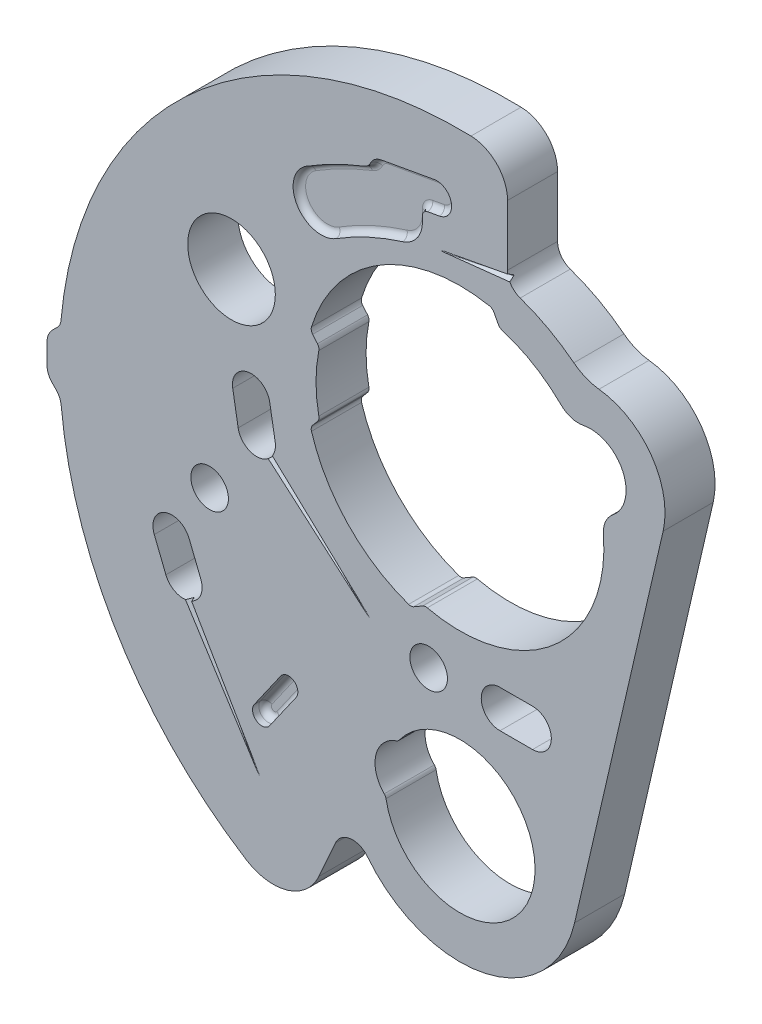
ISO-10303-21;
HEADER;
FILE_DESCRIPTION(('STEP AP214'),'2;1');
FILE_NAME('part.step','',(''),(''),'','','');
FILE_SCHEMA(('AUTOMOTIVE_DESIGN { 1 0 10303 214 1 1 1 1 }'));
ENDSEC;
DATA;
#1=APPLICATION_CONTEXT('core data for automotive mechanical design processes');
#2=APPLICATION_PROTOCOL_DEFINITION('international standard','automotive_design',2000,#1);
#3=PRODUCT_CONTEXT('',#1,'mechanical');
#4=PRODUCT('Part','Part','',(#3));
#5=PRODUCT_RELATED_PRODUCT_CATEGORY('part','',(#4));
#6=PRODUCT_DEFINITION_FORMATION('','',#4);
#7=PRODUCT_DEFINITION_CONTEXT('part definition',#1,'design');
#8=PRODUCT_DEFINITION('design','',#6,#7);
#9=PRODUCT_DEFINITION_SHAPE('','',#8);
#10=(LENGTH_UNIT() NAMED_UNIT(*) SI_UNIT(.MILLI.,.METRE.));
#11=(NAMED_UNIT(*) PLANE_ANGLE_UNIT() SI_UNIT($,.RADIAN.));
#12=(NAMED_UNIT(*) SI_UNIT($,.STERADIAN.) SOLID_ANGLE_UNIT());
#13=UNCERTAINTY_MEASURE_WITH_UNIT(LENGTH_MEASURE(1.E-05),#10,'distance_accuracy_value','');
#14=(GEOMETRIC_REPRESENTATION_CONTEXT(3) GLOBAL_UNCERTAINTY_ASSIGNED_CONTEXT((#13)) GLOBAL_UNIT_ASSIGNED_CONTEXT((#10,
#11,#12)) REPRESENTATION_CONTEXT('',''));
#15=CARTESIAN_POINT('',(0.,0.,0.));
#16=DIRECTION('',(0.,0.,1.));
#17=DIRECTION('',(1.,0.,0.));
#18=AXIS2_PLACEMENT_3D('',#15,#16,#17);
#19=CARTESIAN_POINT('',(0.8,28.9889634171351,0.));
#20=DIRECTION('',(0.,0.,1.));
#21=DIRECTION('',(1.,0.,0.));
#22=AXIS2_PLACEMENT_3D('',#19,#20,#21);
#23=PLANE('',#22);
#24=DIRECTION('',(0.994108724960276,0.108387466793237,0.));
#25=VECTOR('',#24,1.);
#26=CARTESIAN_POINT('',(1.43505454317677,23.1643668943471,0.));
#27=LINE('',#26,#25);
#28=CARTESIAN_POINT('',(-1.13198655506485,22.8844829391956,0.));
#29=VERTEX_POINT('',#28);
#30=CARTESIAN_POINT('',(3.9836369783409,23.442238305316,0.));
#31=VERTEX_POINT('',#30);
#32=EDGE_CURVE('E563',#29,#31,#27,.T.);
#33=ORIENTED_EDGE('',*,*,#32,.F.);
#34=CARTESIAN_POINT('',(-0.847648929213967,22.9716765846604,0.));
#35=DIRECTION('',(0.,0.,1.));
#36=DIRECTION('',(-0.989272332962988,-0.146083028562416,0.));
#37=AXIS2_PLACEMENT_3D('',#34,#35,#36);
#38=ELLIPSE('',#37,0.657459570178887,0.05);
#39=CARTESIAN_POINT('',(-1.14505261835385,22.9729661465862,0.));
#40=VERTEX_POINT('',#39);
#41=EDGE_CURVE('E552',#40,#29,#38,.T.);
#42=ORIENTED_EDGE('',*,*,#41,.F.);
#43=DIRECTION('',(-0.983007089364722,-0.18356759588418,0.));
#44=VECTOR('',#43,1.);
#45=CARTESIAN_POINT('',(1.82003360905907,23.5266689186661,0.));
#46=LINE('',#45,#44);
#47=CARTESIAN_POINT('',(3.82283261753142,23.9006733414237,0.));
#48=VERTEX_POINT('',#47);
#49=EDGE_CURVE('E559',#48,#40,#46,.T.);
#50=ORIENTED_EDGE('',*,*,#49,.F.);
#51=CARTESIAN_POINT('',(5.3,24.1613964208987,0.));
#52=DIRECTION('',(0.,0.,-1.));
#53=DIRECTION('',(-1.,0.,0.));
#54=AXIS2_PLACEMENT_3D('',#51,#52,#53);
#55=CIRCLE('',#54,1.5);
#56=CARTESIAN_POINT('',(3.8,24.1613964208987,0.));
#57=VERTEX_POINT('',#56);
#58=EDGE_CURVE('E1078',#48,#57,#55,.T.);
#59=ORIENTED_EDGE('',*,*,#58,.T.);
#60=DIRECTION('',(0.,1.,0.));
#61=VECTOR('',#60,1.);
#62=CARTESIAN_POINT('',(3.8,28.9889634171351,0.));
#63=LINE('',#62,#61);
#64=CARTESIAN_POINT('',(3.8,28.9889634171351,0.));
#65=VERTEX_POINT('',#64);
#66=EDGE_CURVE('E968',#57,#65,#63,.T.);
#67=ORIENTED_EDGE('',*,*,#66,.T.);
#68=CARTESIAN_POINT('',(0.8,28.9889634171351,0.));
#69=DIRECTION('',(0.,0.,1.));
#70=DIRECTION('',(1.,0.,0.));
#71=AXIS2_PLACEMENT_3D('',#68,#69,#70);
#72=CIRCLE('',#71,3.);
#73=CARTESIAN_POINT('',(0.882758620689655,31.9878217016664,0.));
#74=VERTEX_POINT('',#73);
#75=EDGE_CURVE('E957',#65,#74,#72,.T.);
#76=ORIENTED_EDGE('',*,*,#75,.T.);
#77=CARTESIAN_POINT('',(0.,0.,0.));
#78=DIRECTION('',(0.,0.,1.));
#79=DIRECTION('',(1.,0.,0.));
#80=AXIS2_PLACEMENT_3D('',#77,#78,#79);
#81=CIRCLE('',#80,32.);
#82=CARTESIAN_POINT('',(-31.8723286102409,2.85563810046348,0.));
#83=VERTEX_POINT('',#82);
#84=EDGE_CURVE('E1028',#74,#83,#81,.T.);
#85=ORIENTED_EDGE('',*,*,#84,.T.);
#86=CARTESIAN_POINT('',(-32.8683388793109,2.94487679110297,0.));
#87=DIRECTION('',(0.,0.,-1.));
#88=DIRECTION('',(-1.,0.,0.));
#89=AXIS2_PLACEMENT_3D('',#86,#87,#88);
#90=CIRCLE('',#89,0.999999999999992);
#91=CARTESIAN_POINT('',(-32.1612320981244,2.23777000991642,0.));
#92=VERTEX_POINT('',#91);
#93=EDGE_CURVE('E1031',#83,#92,#90,.T.);
#94=ORIENTED_EDGE('',*,*,#93,.T.);
#95=DIRECTION('',(-0.707106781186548,-0.707106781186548,0.));
#96=VECTOR('',#95,1.);
#97=CARTESIAN_POINT('',(-32.5508141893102,1.84818791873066,0.));
#98=LINE('',#97,#96);
#99=CARTESIAN_POINT('',(-32.5508141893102,1.84818791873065,0.));
#100=VERTEX_POINT('',#99);
#101=EDGE_CURVE('E1034',#92,#100,#98,.T.);
#102=ORIENTED_EDGE('',*,*,#101,.T.);
#103=CARTESIAN_POINT('',(-31.4901540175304,0.78752774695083,0.));
#104=DIRECTION('',(0.,0.,1.));
#105=DIRECTION('',(1.,0.,0.));
#106=AXIS2_PLACEMENT_3D('',#103,#104,#105);
#107=CIRCLE('',#106,1.49999999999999);
#108=CARTESIAN_POINT('',(-32.9896851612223,0.825029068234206,0.));
#109=VERTEX_POINT('',#108);
#110=EDGE_CURVE('E1037',#100,#109,#107,.T.);
#111=ORIENTED_EDGE('',*,*,#110,.T.);
#112=CARTESIAN_POINT('',(0.,0.,0.));
#113=DIRECTION('',(0.,0.,1.));
#114=DIRECTION('',(1.,0.,0.));
#115=AXIS2_PLACEMENT_3D('',#112,#113,#114);
#116=CIRCLE('',#115,33.);
#117=CARTESIAN_POINT('',(-32.9896851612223,-0.825029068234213,0.));
#118=VERTEX_POINT('',#117);
#119=EDGE_CURVE('E1040',#109,#118,#116,.T.);
#120=ORIENTED_EDGE('',*,*,#119,.T.);
#121=CARTESIAN_POINT('',(-31.4901540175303,-0.787527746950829,0.));
#122=DIRECTION('',(0.,0.,1.));
#123=DIRECTION('',(-1.,0.,0.));
#124=AXIS2_PLACEMENT_3D('',#121,#122,#123);
#125=CIRCLE('',#124,1.5);
#126=CARTESIAN_POINT('',(-32.5508141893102,-1.84818791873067,0.));
#127=VERTEX_POINT('',#126);
#128=EDGE_CURVE('E1043',#118,#127,#125,.T.);
#129=ORIENTED_EDGE('',*,*,#128,.T.);
#130=DIRECTION('',(0.707106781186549,-0.707106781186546,0.));
#131=VECTOR('',#130,1.);
#132=CARTESIAN_POINT('',(-32.5508141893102,-1.84818791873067,0.));
#133=LINE('',#132,#131);
#134=CARTESIAN_POINT('',(-32.2889514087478,-2.11005069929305,0.));
#135=VERTEX_POINT('',#134);
#136=EDGE_CURVE('E1046',#127,#135,#133,.T.);
#137=ORIENTED_EDGE('',*,*,#136,.T.);
#138=CARTESIAN_POINT('',(-33.3496115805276,-3.17071087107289,0.));
#139=DIRECTION('',(0.,0.,-1.));
#140=DIRECTION('',(1.,0.,0.));
#141=AXIS2_PLACEMENT_3D('',#138,#139,#140);
#142=CIRCLE('',#141,1.5);
#143=CARTESIAN_POINT('',(-31.8563453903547,-3.02873874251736,0.));
#144=VERTEX_POINT('',#143);
#145=EDGE_CURVE('E1049',#135,#144,#142,.T.);
#146=ORIENTED_EDGE('',*,*,#145,.T.);
#147=CARTESIAN_POINT('',(0.,0.,0.));
#148=DIRECTION('',(0.,0.,1.));
#149=DIRECTION('',(1.,0.,0.));
#150=AXIS2_PLACEMENT_3D('',#147,#148,#149);
#151=CIRCLE('',#150,32.);
#152=CARTESIAN_POINT('',(-17.0582838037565,-27.0742489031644,0.));
#153=VERTEX_POINT('',#152);
#154=EDGE_CURVE('E1052',#144,#153,#151,.T.);
#155=ORIENTED_EDGE('',*,*,#154,.T.);
#156=CARTESIAN_POINT('',(-14.925998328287,-23.6899677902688,0.));
#157=DIRECTION('',(0.,0.,1.));
#158=DIRECTION('',(-1.,0.,0.));
#159=AXIS2_PLACEMENT_3D('',#156,#157,#158);
#160=CIRCLE('',#159,4.);
#161=CARTESIAN_POINT('',(-11.2718164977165,-25.316914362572,0.));
#162=VERTEX_POINT('',#161);
#163=EDGE_CURVE('E1055',#153,#162,#160,.T.);
#164=ORIENTED_EDGE('',*,*,#163,.T.);
#165=DIRECTION('',(0.406736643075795,0.913545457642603,0.));
#166=VECTOR('',#165,1.);
#167=CARTESIAN_POINT('',(-11.2718164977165,-25.316914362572,0.));
#168=LINE('',#167,#166);
#169=CARTESIAN_POINT('',(-9.94001598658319,-22.325641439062,0.));
#170=VERTEX_POINT('',#169);
#171=EDGE_CURVE('E1058',#162,#170,#168,.T.);
#172=ORIENTED_EDGE('',*,*,#171,.T.);
#173=CARTESIAN_POINT('',(-8.56969780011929,-22.9357464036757,0.));
#174=DIRECTION('',(0.,0.,-1.));
#175=DIRECTION('',(1.,0.,0.));
#176=AXIS2_PLACEMENT_3D('',#173,#174,#175);
#177=CIRCLE('',#176,1.5);
#178=CARTESIAN_POINT('',(-7.39038158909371,-22.0088088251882,0.));
#179=VERTEX_POINT('',#178);
#180=EDGE_CURVE('E1061',#170,#179,#177,.T.);
#181=ORIENTED_EDGE('',*,*,#180,.T.);
#182=CARTESIAN_POINT('',(0.,-16.2,0.));
#183=DIRECTION('',(0.,0.,1.));
#184=DIRECTION('',(1.,0.,0.));
#185=AXIS2_PLACEMENT_3D('',#182,#183,#184);
#186=CIRCLE('',#185,9.4);
#187=CARTESIAN_POINT('',(9.15907860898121,-18.3145399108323,0.));
#188=VERTEX_POINT('',#187);
#189=EDGE_CURVE('E1064',#179,#188,#186,.T.);
#190=ORIENTED_EDGE('',*,*,#189,.T.);
#191=DIRECTION('',(0.224951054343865,0.974370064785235,0.));
#192=VECTOR('',#191,1.);
#193=CARTESIAN_POINT('',(16.2313954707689,12.3190299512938,0.));
#194=LINE('',#193,#192);
#195=CARTESIAN_POINT('',(16.2313954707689,12.3190299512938,0.));
#196=VERTEX_POINT('',#195);
#197=EDGE_CURVE('E1067',#188,#196,#194,.T.);
#198=ORIENTED_EDGE('',*,*,#197,.T.);
#199=CARTESIAN_POINT('',(10.4225395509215,13.660110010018,0.));
#200=DIRECTION('',(0.,0.,1.));
#201=DIRECTION('',(1.,0.,0.));
#202=AXIS2_PLACEMENT_3D('',#199,#200,#201);
#203=CIRCLE('',#202,5.96165269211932);
#204=CARTESIAN_POINT('',(11.1084640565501,19.5821713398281,0.));
#205=VERTEX_POINT('',#204);
#206=EDGE_CURVE('E1070',#196,#205,#203,.T.);
#207=ORIENTED_EDGE('',*,*,#206,.T.);
#208=CARTESIAN_POINT('',(11.5686884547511,23.5556073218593,0.));
#209=DIRECTION('',(0.,0.,-1.));
#210=DIRECTION('',(-1.,0.,0.));
#211=AXIS2_PLACEMENT_3D('',#208,#209,#210);
#212=CIRCLE('',#211,4.);
#213=CARTESIAN_POINT('',(9.10070158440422,20.4077444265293,0.));
#214=VERTEX_POINT('',#213);
#215=EDGE_CURVE('E1073',#205,#214,#212,.T.);
#216=ORIENTED_EDGE('',*,*,#215,.T.);
#217=CARTESIAN_POINT('',(0.,8.8,0.));
#218=DIRECTION('',(0.,0.,1.));
#219=DIRECTION('',(1.,0.,0.));
#220=AXIS2_PLACEMENT_3D('',#217,#218,#219);
#221=CIRCLE('',#220,14.75);
#222=CARTESIAN_POINT('',(4.81076923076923,22.7434213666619,0.));
#223=VERTEX_POINT('',#222);
#224=EDGE_CURVE('E1076',#214,#223,#221,.T.);
#225=ORIENTED_EDGE('',*,*,#224,.T.);
#226=EDGE_CURVE('E571',#223,#31,#55,.T.);
#227=ORIENTED_EDGE('',*,*,#226,.T.);
#228=EDGE_LOOP('',(#33,#42,#50,#59,#67,#76,#85,#94,#102,#111,#120,#129,#137,#146,#155,#164,#172,
#181,#190,#198,#207,#216,#225,#227));
#229=FACE_BOUND('',#228,.T.);
#230=DIRECTION('',(0.537299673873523,-0.843391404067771,0.));
#231=VECTOR('',#230,1.);
#232=CARTESIAN_POINT('',(-33.7105151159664,7.00333678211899,0.));
#233=LINE('',#232,#231);
#234=CARTESIAN_POINT('',(-21.928829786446,-11.4902015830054,0.));
#235=VERTEX_POINT('',#234);
#236=CARTESIAN_POINT('',(-16.4173913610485,-20.1414255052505,0.));
#237=VERTEX_POINT('',#236);
#238=EDGE_CURVE('E583',#235,#237,#233,.T.);
#239=ORIENTED_EDGE('',*,*,#238,.F.);
#240=CARTESIAN_POINT('',(-22.1,-10.,0.));
#241=DIRECTION('',(0.,0.,1.));
#242=DIRECTION('',(1.,0.,0.));
#243=AXIS2_PLACEMENT_3D('',#240,#241,#242);
#244=CIRCLE('',#243,1.5);
#245=CARTESIAN_POINT('',(-23.4927287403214,-10.5570517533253,0.));
#246=VERTEX_POINT('',#245);
#247=EDGE_CURVE('E751',#246,#235,#244,.T.);
#248=ORIENTED_EDGE('',*,*,#247,.F.);
#249=DIRECTION('',(0.371367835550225,-0.928485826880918,0.));
#250=VECTOR('',#249,1.);
#251=CARTESIAN_POINT('',(-24.4211483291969,-8.23583718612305,0.));
#252=LINE('',#251,#250);
#253=CARTESIAN_POINT('',(-24.4211483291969,-8.23583718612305,0.));
#254=VERTEX_POINT('',#253);
#255=EDGE_CURVE('E754',#254,#246,#252,.T.);
#256=ORIENTED_EDGE('',*,*,#255,.F.);
#257=CARTESIAN_POINT('',(-23.0284195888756,-7.67878543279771,0.));
#258=DIRECTION('',(0.,0.,1.));
#259=DIRECTION('',(1.,0.,0.));
#260=AXIS2_PLACEMENT_3D('',#257,#258,#259);
#261=CIRCLE('',#260,1.5);
#262=CARTESIAN_POINT('',(-21.6356908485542,-7.12173367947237,0.));
#263=VERTEX_POINT('',#262);
#264=EDGE_CURVE('E733',#263,#254,#261,.T.);
#265=ORIENTED_EDGE('',*,*,#264,.F.);
#266=DIRECTION('',(-0.371367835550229,0.928485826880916,0.));
#267=VECTOR('',#266,1.);
#268=CARTESIAN_POINT('',(-21.6356908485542,-7.12173367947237,0.));
#269=LINE('',#268,#267);
#270=CARTESIAN_POINT('',(-20.7072712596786,-9.44294824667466,0.));
#271=VERTEX_POINT('',#270);
#272=EDGE_CURVE('E746',#271,#263,#269,.T.);
#273=ORIENTED_EDGE('',*,*,#272,.F.);
#274=CARTESIAN_POINT('',(-21.4436382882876,-11.3487732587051,0.));
#275=VERTEX_POINT('',#274);
#276=EDGE_CURVE('E749',#275,#271,#244,.T.);
#277=ORIENTED_EDGE('',*,*,#276,.F.);
#278=DIRECTION('',(-0.503924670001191,0.863747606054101,0.));
#279=VECTOR('',#278,1.);
#280=CARTESIAN_POINT('',(-33.3526407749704,9.06374670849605,0.));
#281=LINE('',#280,#279);
#282=CARTESIAN_POINT('',(-16.3410311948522,-20.0948516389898,0.));
#283=VERTEX_POINT('',#282);
#284=EDGE_CURVE('E581',#283,#275,#281,.T.);
#285=ORIENTED_EDGE('',*,*,#284,.F.);
#286=CARTESIAN_POINT('',(-16.6769942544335,-19.6299085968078,0.));
#287=DIRECTION('',(0.,0.,1.));
#288=DIRECTION('',(-0.520711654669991,0.853732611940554,0.));
#289=AXIS2_PLACEMENT_3D('',#286,#287,#288);
#290=ELLIPSE('',#289,1.27875566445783,0.05);
#291=EDGE_CURVE('E579',#237,#283,#290,.T.);
#292=ORIENTED_EDGE('',*,*,#291,.F.);
#293=EDGE_LOOP('',(#239,#248,#256,#265,#273,#277,#285,#292));
#294=FACE_BOUND('',#293,.T.);
#295=DIRECTION('',(0.756307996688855,-0.654215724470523,0.));
#296=VECTOR('',#295,1.);
#297=CARTESIAN_POINT('',(-19.6663694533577,5.32875730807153,0.));
#298=LINE('',#297,#296);
#299=CARTESIAN_POINT('',(-15.3176687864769,1.56707771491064,0.));
#300=VERTEX_POINT('',#299);
#301=CARTESIAN_POINT('',(-7.75457821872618,-4.97508869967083,0.));
#302=VERTEX_POINT('',#301);
#303=EDGE_CURVE('E594',#300,#302,#298,.T.);
#304=ORIENTED_EDGE('',*,*,#303,.F.);
#305=CARTESIAN_POINT('',(-16.24,2.75,0.));
#306=DIRECTION('',(0.,0.,1.));
#307=DIRECTION('',(1.,0.,0.));
#308=AXIS2_PLACEMENT_3D('',#305,#306,#307);
#309=CIRCLE('',#308,1.5);
#310=CARTESIAN_POINT('',(-17.7181118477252,2.49468575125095,0.));
#311=VERTEX_POINT('',#310);
#312=EDGE_CURVE('E693',#311,#300,#309,.T.);
#313=ORIENTED_EDGE('',*,*,#312,.F.);
#314=DIRECTION('',(0.170209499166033,-0.98540789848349,0.));
#315=VECTOR('',#314,1.);
#316=CARTESIAN_POINT('',(-17.7181118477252,2.49468575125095,0.));
#317=LINE('',#316,#315);
#318=CARTESIAN_POINT('',(-18.1538481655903,5.01732997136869,0.));
#319=VERTEX_POINT('',#318);
#320=EDGE_CURVE('E705',#319,#311,#317,.T.);
#321=ORIENTED_EDGE('',*,*,#320,.F.);
#322=CARTESIAN_POINT('',(-16.675736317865,5.27264422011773,0.));
#323=DIRECTION('',(0.,0.,1.));
#324=DIRECTION('',(1.,0.,0.));
#325=AXIS2_PLACEMENT_3D('',#322,#323,#324);
#326=CIRCLE('',#325,1.5);
#327=CARTESIAN_POINT('',(-15.1976244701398,5.52795846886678,0.));
#328=VERTEX_POINT('',#327);
#329=EDGE_CURVE('E708',#328,#319,#326,.T.);
#330=ORIENTED_EDGE('',*,*,#329,.F.);
#331=DIRECTION('',(-0.170209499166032,0.98540789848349,0.));
#332=VECTOR('',#331,1.);
#333=CARTESIAN_POINT('',(-14.7618881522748,3.00531424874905,0.));
#334=LINE('',#333,#332);
#335=CARTESIAN_POINT('',(-14.7618881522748,3.00531424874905,0.));
#336=VERTEX_POINT('',#335);
#337=EDGE_CURVE('E712',#336,#328,#334,.T.);
#338=ORIENTED_EDGE('',*,*,#337,.F.);
#339=CARTESIAN_POINT('',(-14.9872086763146,1.92506733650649,0.));
#340=VERTEX_POINT('',#339);
#341=EDGE_CURVE('E715',#340,#336,#309,.T.);
#342=ORIENTED_EDGE('',*,*,#341,.F.);
#343=DIRECTION('',(-0.729687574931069,0.683780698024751,0.));
#344=VECTOR('',#343,1.);
#345=CARTESIAN_POINT('',(-20.084835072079,6.70198646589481,0.));
#346=LINE('',#345,#344);
#347=CARTESIAN_POINT('',(-7.69472935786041,-4.90861980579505,0.));
#348=VERTEX_POINT('',#347);
#349=EDGE_CURVE('E592',#348,#340,#346,.T.);
#350=ORIENTED_EDGE('',*,*,#349,.F.);
#351=CARTESIAN_POINT('',(-8.14226147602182,-4.5658386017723,0.));
#352=DIRECTION('',(0.,0.,1.));
#353=DIRECTION('',(-0.743144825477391,0.669130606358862,0.));
#354=AXIS2_PLACEMENT_3D('',#351,#352,#353);
#355=ELLIPSE('',#354,1.25655073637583,0.05);
#356=EDGE_CURVE('E590',#302,#348,#355,.T.);
#357=ORIENTED_EDGE('',*,*,#356,.F.);
#358=EDGE_LOOP('',(#304,#313,#321,#330,#338,#342,#350,#357));
#359=FACE_BOUND('',#358,.T.);
#360=CARTESIAN_POINT('',(-15.8222328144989,-16.4308625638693,0.));
#361=DIRECTION('',(0.,0.,1.));
#362=DIRECTION('',(1.,0.,0.));
#363=AXIS2_PLACEMENT_3D('',#360,#361,#362);
#364=CIRCLE('',#363,0.749999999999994);
#365=CARTESIAN_POINT('',(-16.4365968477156,-16.000680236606,0.));
#366=VERTEX_POINT('',#365);
#367=CARTESIAN_POINT('',(-15.2078687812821,-16.8610448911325,0.));
#368=VERTEX_POINT('',#367);
#369=EDGE_CURVE('E597',#366,#368,#364,.T.);
#370=ORIENTED_EDGE('',*,*,#369,.F.);
#371=DIRECTION('',(-0.573576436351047,-0.819152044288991,0.));
#372=VECTOR('',#371,1.);
#373=CARTESIAN_POINT('',(-16.4365968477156,-16.000680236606,0.));
#374=LINE('',#373,#372);
#375=CARTESIAN_POINT('',(-14.3143640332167,-12.9698176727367,0.));
#376=VERTEX_POINT('',#375);
#377=EDGE_CURVE('E607',#376,#366,#374,.T.);
#378=ORIENTED_EDGE('',*,*,#377,.F.);
#379=CARTESIAN_POINT('',(-13.7,-13.4,0.));
#380=DIRECTION('',(0.,0.,1.));
#381=DIRECTION('',(1.,0.,0.));
#382=AXIS2_PLACEMENT_3D('',#379,#380,#381);
#383=CIRCLE('',#382,0.749999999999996);
#384=CARTESIAN_POINT('',(-13.0856359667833,-13.8301823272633,0.));
#385=VERTEX_POINT('',#384);
#386=EDGE_CURVE('E604',#385,#376,#383,.T.);
#387=ORIENTED_EDGE('',*,*,#386,.F.);
#388=DIRECTION('',(0.573576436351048,0.819152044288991,0.));
#389=VECTOR('',#388,1.);
#390=CARTESIAN_POINT('',(-15.2078687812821,-16.8610448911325,0.));
#391=LINE('',#390,#389);
#392=EDGE_CURVE('E600',#368,#385,#391,.T.);
#393=ORIENTED_EDGE('',*,*,#392,.F.);
#394=EDGE_LOOP('',(#370,#378,#387,#393));
#395=FACE_BOUND('',#394,.T.);
#396=CARTESIAN_POINT('',(-6.3990781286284,-17.3409641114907,0.));
#397=DIRECTION('',(0.,0.,-1.));
#398=DIRECTION('',(1.,0.,0.));
#399=AXIS2_PLACEMENT_3D('',#396,#397,#398);
#400=CIRCLE('',#399,0.5);
#401=CARTESIAN_POINT('',(-6.0471031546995,-16.9858393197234,0.));
#402=VERTEX_POINT('',#401);
#403=CARTESIAN_POINT('',(-5.90684134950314,-17.253197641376,0.));
#404=VERTEX_POINT('',#403);
#405=EDGE_CURVE('E893',#402,#404,#400,.T.);
#406=ORIENTED_EDGE('',*,*,#405,.F.);
#407=CARTESIAN_POINT('',(-4.28722828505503,-15.210215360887,0.));
#408=DIRECTION('',(0.,0.,1.));
#409=DIRECTION('',(1.,0.,0.));
#410=AXIS2_PLACEMENT_3D('',#407,#408,#409);
#411=CIRCLE('',#410,2.5);
#412=CARTESIAN_POINT('',(-5.09061102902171,-12.8428167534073,0.));
#413=VERTEX_POINT('',#412);
#414=EDGE_CURVE('E936',#413,#402,#411,.T.);
#415=ORIENTED_EDGE('',*,*,#414,.F.);
#416=CARTESIAN_POINT('',(-5.25128757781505,-12.3693370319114,0.));
#417=DIRECTION('',(0.,0.,-1.));
#418=DIRECTION('',(-1.,0.,0.));
#419=AXIS2_PLACEMENT_3D('',#416,#417,#418);
#420=CIRCLE('',#419,0.5);
#421=CARTESIAN_POINT('',(-4.84734237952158,-12.6640034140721,0.));
#422=VERTEX_POINT('',#421);
#423=EDGE_CURVE('E950',#422,#413,#420,.T.);
#424=ORIENTED_EDGE('',*,*,#423,.F.);
#425=CARTESIAN_POINT('',(0.,-16.2,0.));
#426=DIRECTION('',(0.,0.,1.));
#427=DIRECTION('',(1.,0.,0.));
#428=AXIS2_PLACEMENT_3D('',#425,#426,#427);
#429=CIRCLE('',#428,6.);
#430=EDGE_CURVE('E947',#404,#422,#429,.T.);
#431=ORIENTED_EDGE('',*,*,#430,.F.);
#432=EDGE_LOOP('',(#406,#415,#424,#431));
#433=FACE_BOUND('',#432,.T.);
#434=CARTESIAN_POINT('',(13.4569989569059,9.8766517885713,0.));
#435=DIRECTION('',(0.,0.,-1.));
#436=DIRECTION('',(1.,0.,0.));
#437=AXIS2_PLACEMENT_3D('',#434,#435,#436);
#438=CIRCLE('',#437,2.);
#439=CARTESIAN_POINT('',(11.4633694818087,9.71714781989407,0.));
#440=VERTEX_POINT('',#439);
#441=CARTESIAN_POINT('',(12.2056754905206,11.4368407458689,0.));
#442=VERTEX_POINT('',#441);
#443=EDGE_CURVE('E681',#440,#442,#438,.T.);
#444=ORIENTED_EDGE('',*,*,#443,.F.);
#445=CARTESIAN_POINT('',(0.,8.8,0.));
#446=DIRECTION('',(0.,0.,1.));
#447=DIRECTION('',(1.,0.,0.));
#448=AXIS2_PLACEMENT_3D('',#445,#446,#447);
#449=CIRCLE('',#448,11.5);
#450=CARTESIAN_POINT('',(-2.60972232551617,-2.39997095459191,0.));
#451=VERTEX_POINT('',#450);
#452=EDGE_CURVE('E776',#451,#440,#449,.T.);
#453=ORIENTED_EDGE('',*,*,#452,.F.);
#454=CARTESIAN_POINT('',(-2.72318851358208,-2.88692621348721,0.));
#455=DIRECTION('',(0.,0.,-1.));
#456=DIRECTION('',(1.,0.,0.));
#457=AXIS2_PLACEMENT_3D('',#454,#455,#456);
#458=CIRCLE('',#457,0.5);
#459=CARTESIAN_POINT('',(-2.97318851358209,-2.453913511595,0.));
#460=VERTEX_POINT('',#459);
#461=EDGE_CURVE('E886',#460,#451,#458,.T.);
#462=ORIENTED_EDGE('',*,*,#461,.F.);
#463=DIRECTION('',(0.866025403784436,0.500000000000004,0.));
#464=VECTOR('',#463,1.);
#465=CARTESIAN_POINT('',(-3.68360710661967,-2.86407387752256,0.));
#466=LINE('',#465,#464);
#467=CARTESIAN_POINT('',(-3.68360710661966,-2.86407387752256,0.));
#468=VERTEX_POINT('',#467);
#469=EDGE_CURVE('E883',#468,#460,#466,.T.);
#470=ORIENTED_EDGE('',*,*,#469,.F.);
#471=CARTESIAN_POINT('',(-3.93360710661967,-2.43106117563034,0.));
#472=DIRECTION('',(0.,0.,1.));
#473=DIRECTION('',(1.,0.,0.));
#474=AXIS2_PLACEMENT_3D('',#471,#472,#473);
#475=CIRCLE('',#474,0.500000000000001);
#476=CARTESIAN_POINT('',(-4.09888471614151,-2.9029545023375,0.));
#477=VERTEX_POINT('',#476);
#478=EDGE_CURVE('E880',#477,#468,#475,.T.);
#479=ORIENTED_EDGE('',*,*,#478,.F.);
#480=CARTESIAN_POINT('',(0.,8.8,0.));
#481=DIRECTION('',(0.,0.,1.));
#482=DIRECTION('',(1.,0.,0.));
#483=AXIS2_PLACEMENT_3D('',#480,#481,#482);
#484=CIRCLE('',#483,12.4);
#485=CARTESIAN_POINT('',(-11.8620437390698,5.18725612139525,0.));
#486=VERTEX_POINT('',#485);
#487=EDGE_CURVE('E877',#486,#477,#484,.T.);
#488=ORIENTED_EDGE('',*,*,#487,.F.);
#489=CARTESIAN_POINT('',(-11.3837355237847,5.3329312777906,0.));
#490=DIRECTION('',(0.,0.,1.));
#491=DIRECTION('',(1.,0.,0.));
#492=AXIS2_PLACEMENT_3D('',#489,#490,#491);
#493=CIRCLE('',#492,0.5);
#494=CARTESIAN_POINT('',(-11.7667577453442,5.65432508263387,0.));
#495=VERTEX_POINT('',#494);
#496=EDGE_CURVE('E874',#495,#486,#493,.T.);
#497=ORIENTED_EDGE('',*,*,#496,.F.);
#498=DIRECTION('',(-0.642787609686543,-0.766044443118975,0.));
#499=VECTOR('',#498,1.);
#500=CARTESIAN_POINT('',(-11.7667577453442,5.65432508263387,0.));
#501=LINE('',#500,#499);
#502=CARTESIAN_POINT('',(-11.3815715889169,6.11337206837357,0.));
#503=VERTEX_POINT('',#502);
#504=EDGE_CURVE('E871',#503,#495,#501,.T.);
#505=ORIENTED_EDGE('',*,*,#504,.F.);
#506=CARTESIAN_POINT('',(-11.7645938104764,6.43476587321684,0.));
#507=DIRECTION('',(0.,0.,-1.));
#508=DIRECTION('',(-1.,0.,0.));
#509=AXIS2_PLACEMENT_3D('',#506,#507,#508);
#510=CIRCLE('',#509,0.500000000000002);
#511=CARTESIAN_POINT('',(-11.2744024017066,6.53331729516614,0.));
#512=VERTEX_POINT('',#511);
#513=EDGE_CURVE('E868',#512,#503,#510,.T.);
#514=ORIENTED_EDGE('',*,*,#513,.F.);
#515=CARTESIAN_POINT('',(0.,8.8,0.));
#516=DIRECTION('',(0.,0.,1.));
#517=DIRECTION('',(1.,0.,0.));
#518=AXIS2_PLACEMENT_3D('',#515,#516,#517);
#519=CIRCLE('',#518,11.5);
#520=CARTESIAN_POINT('',(-11.2744024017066,11.0666827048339,0.));
#521=VERTEX_POINT('',#520);
#522=EDGE_CURVE('E865',#521,#512,#519,.T.);
#523=ORIENTED_EDGE('',*,*,#522,.F.);
#524=CARTESIAN_POINT('',(-11.7645938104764,11.1652341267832,0.));
#525=DIRECTION('',(0.,0.,-1.));
#526=DIRECTION('',(-1.,0.,0.));
#527=AXIS2_PLACEMENT_3D('',#524,#525,#526);
#528=CIRCLE('',#527,0.499999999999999);
#529=CARTESIAN_POINT('',(-11.3815715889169,11.4866279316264,0.));
#530=VERTEX_POINT('',#529);
#531=EDGE_CURVE('E862',#530,#521,#528,.T.);
#532=ORIENTED_EDGE('',*,*,#531,.F.);
#533=DIRECTION('',(0.642787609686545,-0.766044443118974,0.));
#534=VECTOR('',#533,1.);
#535=CARTESIAN_POINT('',(-11.7667577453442,11.9456749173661,0.));
#536=LINE('',#535,#534);
#537=CARTESIAN_POINT('',(-11.7667577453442,11.9456749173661,0.));
#538=VERTEX_POINT('',#537);
#539=EDGE_CURVE('E859',#538,#530,#536,.T.);
#540=ORIENTED_EDGE('',*,*,#539,.F.);
#541=CARTESIAN_POINT('',(-11.3837355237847,12.2670687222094,0.));
#542=DIRECTION('',(0.,0.,1.));
#543=DIRECTION('',(1.,0.,0.));
#544=AXIS2_PLACEMENT_3D('',#541,#542,#543);
#545=CIRCLE('',#544,0.500000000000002);
#546=CARTESIAN_POINT('',(-11.8620437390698,12.4127438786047,0.));
#547=VERTEX_POINT('',#546);
#548=EDGE_CURVE('E856',#547,#538,#545,.T.);
#549=ORIENTED_EDGE('',*,*,#548,.F.);
#550=CARTESIAN_POINT('',(0.,8.8,0.));
#551=DIRECTION('',(0.,0.,1.));
#552=DIRECTION('',(1.,0.,0.));
#553=AXIS2_PLACEMENT_3D('',#550,#551,#552);
#554=CIRCLE('',#553,12.4);
#555=CARTESIAN_POINT('',(2.36444070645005,20.9724861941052,0.));
#556=VERTEX_POINT('',#555);
#557=EDGE_CURVE('E853',#556,#547,#554,.T.);
#558=ORIENTED_EDGE('',*,*,#557,.F.);
#559=CARTESIAN_POINT('',(2.26910035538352,20.4816601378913,0.));
#560=DIRECTION('',(0.,0.,1.));
#561=DIRECTION('',(1.,0.,0.));
#562=AXIS2_PLACEMENT_3D('',#559,#560,#561);
#563=CIRCLE('',#562,0.5);
#564=CARTESIAN_POINT('',(2.71057415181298,20.7163959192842,0.));
#565=VERTEX_POINT('',#564);
#566=EDGE_CURVE('E850',#565,#556,#563,.T.);
#567=ORIENTED_EDGE('',*,*,#566,.F.);
#568=DIRECTION('',(-0.469471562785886,0.882947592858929,0.));
#569=VECTOR('',#568,1.);
#570=CARTESIAN_POINT('',(2.71057415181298,20.7163959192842,0.));
#571=LINE('',#570,#569);
#572=CARTESIAN_POINT('',(3.07026330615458,20.0399190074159,0.));
#573=VERTEX_POINT('',#572);
#574=EDGE_CURVE('E847',#573,#565,#571,.T.);
#575=ORIENTED_EDGE('',*,*,#574,.F.);
#576=CARTESIAN_POINT('',(3.51173710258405,20.2746547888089,0.));
#577=DIRECTION('',(0.,0.,-1.));
#578=DIRECTION('',(-1.,0.,0.));
#579=AXIS2_PLACEMENT_3D('',#576,#577,#578);
#580=CIRCLE('',#579,0.500000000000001);
#581=CARTESIAN_POINT('',(3.36541472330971,19.7965441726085,0.));
#582=VERTEX_POINT('',#581);
#583=EDGE_CURVE('E844',#582,#573,#580,.T.);
#584=ORIENTED_EDGE('',*,*,#583,.F.);
#585=CARTESIAN_POINT('',(0.,8.8,0.));
#586=DIRECTION('',(0.,0.,1.));
#587=DIRECTION('',(1.,0.,0.));
#588=AXIS2_PLACEMENT_3D('',#585,#586,#587);
#589=CIRCLE('',#588,11.5);
#590=CARTESIAN_POINT('',(8.07108785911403,16.9919192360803,0.));
#591=VERTEX_POINT('',#590);
#592=EDGE_CURVE('E841',#591,#582,#589,.T.);
#593=ORIENTED_EDGE('',*,*,#592,.F.);
#594=CARTESIAN_POINT('',(9.47475531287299,18.4166008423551,0.));
#595=DIRECTION('',(0.,0.,-1.));
#596=DIRECTION('',(-1.,0.,0.));
#597=AXIS2_PLACEMENT_3D('',#594,#595,#596);
#598=CIRCLE('',#597,2.);
#599=CARTESIAN_POINT('',(9.86559417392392,16.4551613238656,0.));
#600=VERTEX_POINT('',#599);
#601=EDGE_CURVE('E838',#600,#591,#598,.T.);
#602=ORIENTED_EDGE('',*,*,#601,.F.);
#603=CARTESIAN_POINT('',(10.4225395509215,13.660110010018,0.));
#604=DIRECTION('',(0.,0.,1.));
#605=DIRECTION('',(1.,0.,0.));
#606=AXIS2_PLACEMENT_3D('',#603,#604,#605);
#607=CIRCLE('',#606,2.85);
#608=EDGE_CURVE('E835',#442,#600,#607,.T.);
#609=ORIENTED_EDGE('',*,*,#608,.F.);
#610=EDGE_LOOP('',(#444,#453,#462,#470,#479,#488,#497,#505,#514,#523,#532,#540,#549,#558,#567,
#575,#584,#593,#602,#609));
#611=FACE_BOUND('',#610,.T.);
#612=CARTESIAN_POINT('',(-18.25,13.2,0.));
#613=DIRECTION('',(0.,0.,1.));
#614=DIRECTION('',(1.,0.,0.));
#615=AXIS2_PLACEMENT_3D('',#612,#613,#614);
#616=CIRCLE('',#615,3.5);
#617=CARTESIAN_POINT('',(-14.75,13.2,0.));
#618=VERTEX_POINT('',#617);
#619=EDGE_CURVE('E745',#618,#618,#616,.T.);
#620=ORIENTED_EDGE('',*,*,#619,.F.);
#621=EDGE_LOOP('',(#620));
#622=FACE_BOUND('',#621,.T.);
#623=CARTESIAN_POINT('',(-20.,-2.8,0.));
#624=DIRECTION('',(0.,0.,1.));
#625=DIRECTION('',(1.,0.,0.));
#626=AXIS2_PLACEMENT_3D('',#623,#624,#625);
#627=CIRCLE('',#626,1.5);
#628=CARTESIAN_POINT('',(-18.5,-2.8,0.));
#629=VERTEX_POINT('',#628);
#630=EDGE_CURVE('E704',#629,#629,#627,.T.);
#631=ORIENTED_EDGE('',*,*,#630,.F.);
#632=EDGE_LOOP('',(#631));
#633=FACE_BOUND('',#632,.T.);
#634=CARTESIAN_POINT('',(-2.5,-6.5,0.));
#635=DIRECTION('',(0.,0.,1.));
#636=DIRECTION('',(1.,0.,0.));
#637=AXIS2_PLACEMENT_3D('',#634,#635,#636);
#638=CIRCLE('',#637,1.5);
#639=CARTESIAN_POINT('',(-0.999999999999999,-6.5,0.));
#640=VERTEX_POINT('',#639);
#641=EDGE_CURVE('E671',#640,#640,#638,.T.);
#642=ORIENTED_EDGE('',*,*,#641,.F.);
#643=EDGE_LOOP('',(#642));
#644=FACE_BOUND('',#643,.T.);
#645=CARTESIAN_POINT('',(3.2,-6.5,0.));
#646=DIRECTION('',(0.,0.,1.));
#647=DIRECTION('',(1.,0.,0.));
#648=AXIS2_PLACEMENT_3D('',#645,#646,#647);
#649=CIRCLE('',#648,1.5);
#650=CARTESIAN_POINT('',(3.2,-5.,0.));
#651=VERTEX_POINT('',#650);
#652=CARTESIAN_POINT('',(3.2,-8.,0.));
#653=VERTEX_POINT('',#652);
#654=EDGE_CURVE('E668',#651,#653,#649,.T.);
#655=ORIENTED_EDGE('',*,*,#654,.F.);
#656=DIRECTION('',(-1.,0.,0.));
#657=VECTOR('',#656,1.);
#658=CARTESIAN_POINT('',(3.2,-5.,0.));
#659=LINE('',#658,#657);
#660=CARTESIAN_POINT('',(5.8,-5.,0.));
#661=VERTEX_POINT('',#660);
#662=EDGE_CURVE('E658',#661,#651,#659,.T.);
#663=ORIENTED_EDGE('',*,*,#662,.F.);
#664=CARTESIAN_POINT('',(5.8,-6.5,0.));
#665=DIRECTION('',(0.,0.,1.));
#666=DIRECTION('',(1.,0.,0.));
#667=AXIS2_PLACEMENT_3D('',#664,#665,#666);
#668=CIRCLE('',#667,1.5);
#669=CARTESIAN_POINT('',(5.8,-8.,0.));
#670=VERTEX_POINT('',#669);
#671=EDGE_CURVE('E674',#670,#661,#668,.T.);
#672=ORIENTED_EDGE('',*,*,#671,.F.);
#673=DIRECTION('',(1.,0.,0.));
#674=VECTOR('',#673,1.);
#675=CARTESIAN_POINT('',(3.2,-8.,0.));
#676=LINE('',#675,#674);
#677=EDGE_CURVE('E670',#653,#670,#676,.T.);
#678=ORIENTED_EDGE('',*,*,#677,.F.);
#679=EDGE_LOOP('',(#655,#663,#672,#678));
#680=FACE_BOUND('',#679,.T.);
#681=CARTESIAN_POINT('',(-11.0804614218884,21.4132144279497,0.));
#682=DIRECTION('',(0.,0.,1.));
#683=DIRECTION('',(1.,0.,0.));
#684=AXIS2_PLACEMENT_3D('',#681,#682,#683);
#685=CIRCLE('',#684,2.25);
#686=CARTESIAN_POINT('',(-12.2727797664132,23.3213226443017,0.));
#687=VERTEX_POINT('',#686);
#688=CARTESIAN_POINT('',(-9.88814307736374,19.5051062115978,0.));
#689=VERTEX_POINT('',#688);
#690=EDGE_CURVE('E619',#687,#689,#685,.T.);
#691=ORIENTED_EDGE('',*,*,#690,.F.);
#692=CARTESIAN_POINT('',(2.3,0.,0.));
#693=DIRECTION('',(0.,0.,1.));
#694=DIRECTION('',(1.,0.,0.));
#695=AXIS2_PLACEMENT_3D('',#692,#693,#694);
#696=CIRCLE('',#695,27.5);
#697=CARTESIAN_POINT('',(-7.67066897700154,25.628807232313,0.));
#698=VERTEX_POINT('',#697);
#699=EDGE_CURVE('E650',#698,#687,#696,.T.);
#700=ORIENTED_EDGE('',*,*,#699,.F.);
#701=CARTESIAN_POINT('',(-8.03323875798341,26.5607638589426,0.));
#702=DIRECTION('',(0.,0.,-1.));
#703=DIRECTION('',(-1.,0.,0.));
#704=AXIS2_PLACEMENT_3D('',#701,#702,#703);
#705=CIRCLE('',#704,0.999999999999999);
#706=CARTESIAN_POINT('',(-7.13819396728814,26.1147876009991,0.));
#707=VERTEX_POINT('',#706);
#708=EDGE_CURVE('E647',#707,#698,#705,.T.);
#709=ORIENTED_EDGE('',*,*,#708,.F.);
#710=CARTESIAN_POINT('',(-6.08204111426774,25.5885356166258,0.));
#711=DIRECTION('',(0.,0.,1.));
#712=DIRECTION('',(1.,0.,0.));
#713=AXIS2_PLACEMENT_3D('',#710,#711,#712);
#714=CIRCLE('',#713,1.17999999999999);
#715=CARTESIAN_POINT('',(-6.29100110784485,26.7498864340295,0.));
#716=VERTEX_POINT('',#715);
#717=EDGE_CURVE('E644',#716,#707,#714,.T.);
#718=ORIENTED_EDGE('',*,*,#717,.F.);
#719=DIRECTION('',(-0.984195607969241,-0.177084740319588,0.));
#720=VECTOR('',#719,1.);
#721=CARTESIAN_POINT('',(-2.05895999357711,27.5113508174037,0.));
#722=LINE('',#721,#720);
#723=CARTESIAN_POINT('',(-2.05895999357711,27.5113508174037,0.));
#724=VERTEX_POINT('',#723);
#725=EDGE_CURVE('E641',#724,#716,#722,.T.);
#726=ORIENTED_EDGE('',*,*,#725,.F.);
#727=CARTESIAN_POINT('',(-1.85,26.35,0.));
#728=DIRECTION('',(0.,0.,1.));
#729=DIRECTION('',(1.,0.,0.));
#730=AXIS2_PLACEMENT_3D('',#727,#728,#729);
#731=CIRCLE('',#730,1.18);
#732=CARTESIAN_POINT('',(-1.64104000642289,25.1886491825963,0.));
#733=VERTEX_POINT('',#732);
#734=EDGE_CURVE('E638',#733,#724,#731,.T.);
#735=ORIENTED_EDGE('',*,*,#734,.F.);
#736=DIRECTION('',(0.984195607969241,0.177084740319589,0.));
#737=VECTOR('',#736,1.);
#738=CARTESIAN_POINT('',(-1.64104000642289,25.1886491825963,0.));
#739=LINE('',#738,#737);
#740=CARTESIAN_POINT('',(-2.58854237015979,25.0181665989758,0.));
#741=VERTEX_POINT('',#740);
#742=EDGE_CURVE('E635',#741,#733,#739,.T.);
#743=ORIENTED_EDGE('',*,*,#742,.F.);
#744=CARTESIAN_POINT('',(-2.5,24.5260687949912,0.));
#745=DIRECTION('',(0.,0.,-1.));
#746=DIRECTION('',(1.,0.,0.));
#747=AXIS2_PLACEMENT_3D('',#744,#745,#746);
#748=CIRCLE('',#747,0.499999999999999);
#749=CARTESIAN_POINT('',(-3.,24.5260687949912,0.));
#750=VERTEX_POINT('',#749);
#751=EDGE_CURVE('E632',#750,#741,#748,.T.);
#752=ORIENTED_EDGE('',*,*,#751,.F.);
#753=DIRECTION('',(0.,1.,0.));
#754=VECTOR('',#753,1.);
#755=CARTESIAN_POINT('',(-3.,24.0948127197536,0.));
#756=LINE('',#755,#754);
#757=CARTESIAN_POINT('',(-3.,24.0948127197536,0.));
#758=VERTEX_POINT('',#757);
#759=EDGE_CURVE('E629',#758,#750,#756,.T.);
#760=ORIENTED_EDGE('',*,*,#759,.F.);
#761=CARTESIAN_POINT('',(-5.25,24.0948127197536,0.));
#762=DIRECTION('',(0.,0.,1.));
#763=DIRECTION('',(-1.,0.,0.));
#764=AXIS2_PLACEMENT_3D('',#761,#762,#763);
#765=CIRCLE('',#764,2.25);
#766=CARTESIAN_POINT('',(-4.57722772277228,21.9477502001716,0.));
#767=VERTEX_POINT('',#766);
#768=EDGE_CURVE('E626',#767,#758,#765,.T.);
#769=ORIENTED_EDGE('',*,*,#768,.F.);
#770=CARTESIAN_POINT('',(2.3,0.,0.));
#771=DIRECTION('',(0.,0.,-1.));
#772=DIRECTION('',(1.,0.,0.));
#773=AXIS2_PLACEMENT_3D('',#770,#771,#772);
#774=CIRCLE('',#773,23.);
#775=EDGE_CURVE('E622',#689,#767,#774,.T.);
#776=ORIENTED_EDGE('',*,*,#775,.F.);
#777=EDGE_LOOP('',(#691,#700,#709,#718,#726,#735,#743,#752,#760,#769,#776));
#778=FACE_BOUND('',#777,.T.);
#779=ADVANCED_FACE('F45',(#229,#294,#359,#395,#433,#611,#622,#633,#644,#680,#778),#23,.T.);
#780=CARTESIAN_POINT('',(0.8,28.9889634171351,-4.));
#781=DIRECTION('',(0.,0.,1.));
#782=DIRECTION('',(1.,0.,0.));
#783=AXIS2_PLACEMENT_3D('',#780,#781,#782);
#784=CYLINDRICAL_SURFACE('',#783,3.);
#785=ORIENTED_EDGE('',*,*,#75,.F.);
#786=DIRECTION('',(0.,0.,1.));
#787=VECTOR('',#786,1.);
#788=CARTESIAN_POINT('',(3.8,28.9889634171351,-4.));
#789=LINE('',#788,#787);
#790=CARTESIAN_POINT('',(3.8,28.9889634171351,-4.));
#791=VERTEX_POINT('',#790);
#792=EDGE_CURVE('E1082',#791,#65,#789,.T.);
#793=ORIENTED_EDGE('',*,*,#792,.F.);
#794=CARTESIAN_POINT('',(0.8,28.9889634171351,-4.));
#795=DIRECTION('',(0.,0.,1.));
#796=DIRECTION('',(1.,0.,0.));
#797=AXIS2_PLACEMENT_3D('',#794,#795,#796);
#798=CIRCLE('',#797,3.);
#799=CARTESIAN_POINT('',(0.882758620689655,31.9878217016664,-4.));
#800=VERTEX_POINT('',#799);
#801=EDGE_CURVE('E964',#791,#800,#798,.T.);
#802=ORIENTED_EDGE('',*,*,#801,.T.);
#803=DIRECTION('',(0.,0.,1.));
#804=VECTOR('',#803,1.);
#805=CARTESIAN_POINT('',(0.882758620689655,31.9878217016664,-4.));
#806=LINE('',#805,#804);
#807=EDGE_CURVE('E1025',#800,#74,#806,.T.);
#808=ORIENTED_EDGE('',*,*,#807,.T.);
#809=EDGE_LOOP('',(#785,#793,#802,#808));
#810=FACE_BOUND('',#809,.T.);
#811=ADVANCED_FACE('F1279',(#810),#784,.T.);
#812=CARTESIAN_POINT('',(3.8,28.9889634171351,-4.));
#813=DIRECTION('',(1.,0.,0.));
#814=DIRECTION('',(0.,1.,0.));
#815=AXIS2_PLACEMENT_3D('',#812,#813,#814);
#816=PLANE('',#815);
#817=ORIENTED_EDGE('',*,*,#66,.F.);
#818=DIRECTION('',(0.,0.,1.));
#819=VECTOR('',#818,1.);
#820=CARTESIAN_POINT('',(3.8,24.1613964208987,-4.));
#821=LINE('',#820,#819);
#822=CARTESIAN_POINT('',(3.8,24.1613964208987,-4.));
#823=VERTEX_POINT('',#822);
#824=EDGE_CURVE('E1085',#823,#57,#821,.T.);
#825=ORIENTED_EDGE('',*,*,#824,.F.);
#826=DIRECTION('',(0.,1.,0.));
#827=VECTOR('',#826,1.);
#828=CARTESIAN_POINT('',(3.8,28.9889634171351,-4.));
#829=LINE('',#828,#827);
#830=EDGE_CURVE('E1022',#823,#791,#829,.T.);
#831=ORIENTED_EDGE('',*,*,#830,.T.);
#832=ORIENTED_EDGE('',*,*,#792,.T.);
#833=EDGE_LOOP('',(#817,#825,#831,#832));
#834=FACE_BOUND('',#833,.T.);
#835=ADVANCED_FACE('F1285',(#834),#816,.T.);
#836=CARTESIAN_POINT('',(5.3,24.1613964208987,-4.));
#837=DIRECTION('',(0.,0.,1.));
#838=DIRECTION('',(1.,0.,0.));
#839=AXIS2_PLACEMENT_3D('',#836,#837,#838);
#840=CYLINDRICAL_SURFACE('',#839,1.5);
#841=CARTESIAN_POINT('',(5.3,24.1613964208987,-1.14864181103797));
#842=DIRECTION('',(0.0970147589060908,-0.889800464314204,-0.4459184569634));
#843=DIRECTION('',(0.0483319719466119,-0.443291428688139,0.895073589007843));
#844=AXIS2_PLACEMENT_3D('',#841,#842,#843);
#845=ELLIPSE('',#844,3.36384371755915,1.5);
#846=CARTESIAN_POINT('',(3.89831062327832,23.627292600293,-0.387827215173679));
#847=VERTEX_POINT('',#846);
#848=EDGE_CURVE('E11',#31,#847,#845,.T.);
#849=ORIENTED_EDGE('',*,*,#848,.F.);
#850=ORIENTED_EDGE('',*,*,#226,.F.);
#851=DIRECTION('',(0.,0.,1.));
#852=VECTOR('',#851,1.);
#853=CARTESIAN_POINT('',(4.81076923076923,22.7434213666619,-4.));
#854=LINE('',#853,#852);
#855=CARTESIAN_POINT('',(4.81076923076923,22.7434213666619,-4.));
#856=VERTEX_POINT('',#855);
#857=EDGE_CURVE('E1088',#856,#223,#854,.T.);
#858=ORIENTED_EDGE('',*,*,#857,.F.);
#859=CARTESIAN_POINT('',(5.3,24.1613964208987,-4.));
#860=DIRECTION('',(0.,0.,-1.));
#861=DIRECTION('',(-1.,0.,0.));
#862=AXIS2_PLACEMENT_3D('',#859,#860,#861);
#863=CIRCLE('',#862,1.5);
#864=EDGE_CURVE('E1019',#856,#823,#863,.T.);
#865=ORIENTED_EDGE('',*,*,#864,.T.);
#866=ORIENTED_EDGE('',*,*,#824,.T.);
#867=ORIENTED_EDGE('',*,*,#58,.F.);
#868=CARTESIAN_POINT('',(5.3,24.1613964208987,-0.0298427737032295));
#869=DIRECTION('',(-0.164306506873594,0.879863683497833,-0.445918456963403));
#870=DIRECTION('',(-0.0818561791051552,0.438341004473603,0.895073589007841));
#871=AXIS2_PLACEMENT_3D('',#868,#869,#870);
#872=ELLIPSE('',#871,3.36384371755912,1.5);
#873=CARTESIAN_POINT('',(3.86849325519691,23.7133021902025,-0.386535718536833));
#874=VERTEX_POINT('',#873);
#875=EDGE_CURVE('E53',#874,#48,#872,.T.);
#876=ORIENTED_EDGE('',*,*,#875,.F.);
#877=CARTESIAN_POINT('',(3.89831062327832,23.627292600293,-0.387827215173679));
#878=CARTESIAN_POINT('',(3.89785756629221,23.6284816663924,-0.390304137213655));
#879=CARTESIAN_POINT('',(3.89732921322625,23.6298727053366,-0.3926683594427));
#880=CARTESIAN_POINT('',(3.89614567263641,23.6330065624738,-0.397109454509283));
#881=CARTESIAN_POINT('',(3.89549069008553,23.6347488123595,-0.399186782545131));
#882=CARTESIAN_POINT('',(3.89407603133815,23.6385371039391,-0.403000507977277));
#883=CARTESIAN_POINT('',(3.89331635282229,23.6405831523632,-0.404736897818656));
#884=CARTESIAN_POINT('',(3.89171831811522,23.6449198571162,-0.407825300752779));
#885=CARTESIAN_POINT('',(3.89087995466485,23.6472105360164,-0.409177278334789));
#886=CARTESIAN_POINT('',(3.88913841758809,23.6520083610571,-0.411481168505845));
#887=CARTESIAN_POINT('',(3.88823446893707,23.6545182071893,-0.412426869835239));
#888=CARTESIAN_POINT('',(3.88640058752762,23.6596553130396,-0.413867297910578));
#889=CARTESIAN_POINT('',(3.88547064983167,23.6622825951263,-0.414361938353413));
#890=CARTESIAN_POINT('',(3.8835925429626,23.6676372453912,-0.414895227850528));
#891=CARTESIAN_POINT('',(3.88264438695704,23.6703655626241,-0.414924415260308));
#892=CARTESIAN_POINT('',(3.88077527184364,23.6757943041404,-0.414503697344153));
#893=CARTESIAN_POINT('',(3.87985431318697,23.6784947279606,-0.414053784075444));
#894=CARTESIAN_POINT('',(3.87805339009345,23.6838235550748,-0.412679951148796));
#895=CARTESIAN_POINT('',(3.87717402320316,23.686450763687,-0.411750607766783));
#896=CARTESIAN_POINT('',(3.87549022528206,23.6915251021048,-0.409440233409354));
#897=CARTESIAN_POINT('',(3.8746858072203,23.6939722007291,-0.408059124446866));
#898=CARTESIAN_POINT('',(3.87317121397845,23.6986161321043,-0.404881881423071));
#899=CARTESIAN_POINT('',(3.87246112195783,23.7008127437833,-0.403085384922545));
#900=CARTESIAN_POINT('',(3.8711532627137,23.7048862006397,-0.399127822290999));
#901=CARTESIAN_POINT('',(3.87055539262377,23.7067633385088,-0.3969670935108));
#902=CARTESIAN_POINT('',(3.86972672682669,23.7093794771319,-0.393385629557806));
#903=CARTESIAN_POINT('',(3.86945180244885,23.7102505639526,-0.392069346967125));
#904=CARTESIAN_POINT('',(3.86894217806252,23.7118697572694,-0.389358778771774));
#905=CARTESIAN_POINT('',(3.86870741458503,23.7126180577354,-0.387964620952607));
#906=CARTESIAN_POINT('',(3.86849325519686,23.7133021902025,-0.386535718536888));
#907=B_SPLINE_CURVE_WITH_KNOTS('',3,(#877,#878,#879,#880,#881,#882,#883,#884,#885,#886,#887,
#888,#889,#890,#891,#892,#893,#894,#895,#896,#897,#898,#899,#900,#901,#902,#903,#904,#905,#906),
.UNSPECIFIED.,.F.,.F.,(4,2,2,2,2,2,2,2,2,2,2,2,2,2,4),(0.,0.00834130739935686,
0.0166692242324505,0.024997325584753,0.0333261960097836,0.0417782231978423,0.0502318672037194,
0.0588571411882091,0.0674825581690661,0.0762077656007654,0.0849344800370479,0.0936688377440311,
0.10239514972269,0.107195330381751,0.111987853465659),.UNSPECIFIED.);
#908=EDGE_CURVE('E1302',#847,#874,#907,.T.);
#909=ORIENTED_EDGE('',*,*,#908,.F.);
#910=EDGE_LOOP('',(#849,#850,#858,#865,#866,#867,#876,#909));
#911=FACE_BOUND('',#910,.T.);
#912=ADVANCED_FACE('F1294',(#911),#840,.F.);
#913=CARTESIAN_POINT('',(0.,8.8,-4.));
#914=DIRECTION('',(0.,0.,1.));
#915=DIRECTION('',(1.,0.,0.));
#916=AXIS2_PLACEMENT_3D('',#913,#914,#915);
#917=CYLINDRICAL_SURFACE('',#916,14.75);
#918=ORIENTED_EDGE('',*,*,#224,.F.);
#919=DIRECTION('',(0.,0.,1.));
#920=VECTOR('',#919,1.);
#921=CARTESIAN_POINT('',(9.10070158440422,20.4077444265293,-4.));
#922=LINE('',#921,#920);
#923=CARTESIAN_POINT('',(9.10070158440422,20.4077444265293,-4.));
#924=VERTEX_POINT('',#923);
#925=EDGE_CURVE('E1090',#924,#214,#922,.T.);
#926=ORIENTED_EDGE('',*,*,#925,.F.);
#927=CARTESIAN_POINT('',(0.,8.8,-4.));
#928=DIRECTION('',(0.,0.,1.));
#929=DIRECTION('',(1.,0.,0.));
#930=AXIS2_PLACEMENT_3D('',#927,#928,#929);
#931=CIRCLE('',#930,14.75);
#932=EDGE_CURVE('E1016',#924,#856,#931,.T.);
#933=ORIENTED_EDGE('',*,*,#932,.T.);
#934=ORIENTED_EDGE('',*,*,#857,.T.);
#935=EDGE_LOOP('',(#918,#926,#933,#934));
#936=FACE_BOUND('',#935,.T.);
#937=ADVANCED_FACE('F1298',(#936),#917,.T.);
#938=CARTESIAN_POINT('',(11.5686884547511,23.5556073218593,-4.));
#939=DIRECTION('',(0.,0.,1.));
#940=DIRECTION('',(1.,0.,0.));
#941=AXIS2_PLACEMENT_3D('',#938,#939,#940);
#942=CYLINDRICAL_SURFACE('',#941,4.);
#943=ORIENTED_EDGE('',*,*,#215,.F.);
#944=DIRECTION('',(0.,0.,1.));
#945=VECTOR('',#944,1.);
#946=CARTESIAN_POINT('',(11.1084640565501,19.5821713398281,-4.));
#947=LINE('',#946,#945);
#948=CARTESIAN_POINT('',(11.1084640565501,19.5821713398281,-4.));
#949=VERTEX_POINT('',#948);
#950=EDGE_CURVE('E1092',#949,#205,#947,.T.);
#951=ORIENTED_EDGE('',*,*,#950,.F.);
#952=CARTESIAN_POINT('',(11.5686884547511,23.5556073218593,-4.));
#953=DIRECTION('',(0.,0.,-1.));
#954=DIRECTION('',(-1.,0.,0.));
#955=AXIS2_PLACEMENT_3D('',#952,#953,#954);
#956=CIRCLE('',#955,4.);
#957=EDGE_CURVE('E1013',#949,#924,#956,.T.);
#958=ORIENTED_EDGE('',*,*,#957,.T.);
#959=ORIENTED_EDGE('',*,*,#925,.T.);
#960=EDGE_LOOP('',(#943,#951,#958,#959));
#961=FACE_BOUND('',#960,.T.);
#962=ADVANCED_FACE('F1488',(#961),#942,.F.);
#963=CARTESIAN_POINT('',(10.4225395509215,13.660110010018,-4.));
#964=DIRECTION('',(0.,0.,1.));
#965=DIRECTION('',(1.,0.,0.));
#966=AXIS2_PLACEMENT_3D('',#963,#964,#965);
#967=CYLINDRICAL_SURFACE('',#966,5.96165269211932);
#968=ORIENTED_EDGE('',*,*,#206,.F.);
#969=DIRECTION('',(0.,0.,1.));
#970=VECTOR('',#969,1.);
#971=CARTESIAN_POINT('',(16.2313954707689,12.3190299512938,-4.));
#972=LINE('',#971,#970);
#973=CARTESIAN_POINT('',(16.2313954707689,12.3190299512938,-4.));
#974=VERTEX_POINT('',#973);
#975=EDGE_CURVE('E1094',#974,#196,#972,.T.);
#976=ORIENTED_EDGE('',*,*,#975,.F.);
#977=CARTESIAN_POINT('',(10.4225395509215,13.660110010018,-4.));
#978=DIRECTION('',(0.,0.,1.));
#979=DIRECTION('',(1.,0.,0.));
#980=AXIS2_PLACEMENT_3D('',#977,#978,#979);
#981=CIRCLE('',#980,5.96165269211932);
#982=EDGE_CURVE('E1010',#974,#949,#981,.T.);
#983=ORIENTED_EDGE('',*,*,#982,.T.);
#984=ORIENTED_EDGE('',*,*,#950,.T.);
#985=EDGE_LOOP('',(#968,#976,#983,#984));
#986=FACE_BOUND('',#985,.T.);
#987=ADVANCED_FACE('F1493',(#986),#967,.T.);
#988=CARTESIAN_POINT('',(16.2313954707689,12.3190299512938,-4.));
#989=DIRECTION('',(0.974370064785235,-0.224951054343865,0.));
#990=DIRECTION('',(0.224951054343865,0.974370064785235,0.));
#991=AXIS2_PLACEMENT_3D('',#988,#989,#990);
#992=PLANE('',#991);
#993=ORIENTED_EDGE('',*,*,#197,.F.);
#994=DIRECTION('',(0.,0.,1.));
#995=VECTOR('',#994,1.);
#996=CARTESIAN_POINT('',(9.15907860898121,-18.3145399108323,-4.));
#997=LINE('',#996,#995);
#998=CARTESIAN_POINT('',(9.15907860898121,-18.3145399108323,-4.));
#999=VERTEX_POINT('',#998);
#1000=EDGE_CURVE('E1096',#999,#188,#997,.T.);
#1001=ORIENTED_EDGE('',*,*,#1000,.F.);
#1002=DIRECTION('',(0.224951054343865,0.974370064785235,0.));
#1003=VECTOR('',#1002,1.);
#1004=CARTESIAN_POINT('',(16.2313954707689,12.3190299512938,-4.));
#1005=LINE('',#1004,#1003);
#1006=EDGE_CURVE('E1007',#999,#974,#1005,.T.);
#1007=ORIENTED_EDGE('',*,*,#1006,.T.);
#1008=ORIENTED_EDGE('',*,*,#975,.T.);
#1009=EDGE_LOOP('',(#993,#1001,#1007,#1008));
#1010=FACE_BOUND('',#1009,.T.);
#1011=ADVANCED_FACE('F1496',(#1010),#992,.T.);
#1012=CARTESIAN_POINT('',(0.,-16.2,-4.));
#1013=DIRECTION('',(0.,0.,1.));
#1014=DIRECTION('',(1.,0.,0.));
#1015=AXIS2_PLACEMENT_3D('',#1012,#1013,#1014);
#1016=CYLINDRICAL_SURFACE('',#1015,9.4);
#1017=ORIENTED_EDGE('',*,*,#189,.F.);
#1018=DIRECTION('',(0.,0.,1.));
#1019=VECTOR('',#1018,1.);
#1020=CARTESIAN_POINT('',(-7.39038158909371,-22.0088088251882,-4.));
#1021=LINE('',#1020,#1019);
#1022=CARTESIAN_POINT('',(-7.39038158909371,-22.0088088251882,-4.));
#1023=VERTEX_POINT('',#1022);
#1024=EDGE_CURVE('E1098',#1023,#179,#1021,.T.);
#1025=ORIENTED_EDGE('',*,*,#1024,.F.);
#1026=CARTESIAN_POINT('',(0.,-16.2,-4.));
#1027=DIRECTION('',(0.,0.,1.));
#1028=DIRECTION('',(1.,0.,0.));
#1029=AXIS2_PLACEMENT_3D('',#1026,#1027,#1028);
#1030=CIRCLE('',#1029,9.4);
#1031=EDGE_CURVE('E1004',#1023,#999,#1030,.T.);
#1032=ORIENTED_EDGE('',*,*,#1031,.T.);
#1033=ORIENTED_EDGE('',*,*,#1000,.T.);
#1034=EDGE_LOOP('',(#1017,#1025,#1032,#1033));
#1035=FACE_BOUND('',#1034,.T.);
#1036=ADVANCED_FACE('F1501',(#1035),#1016,.T.);
#1037=CARTESIAN_POINT('',(-8.56969780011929,-22.9357464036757,-4.));
#1038=DIRECTION('',(0.,0.,1.));
#1039=DIRECTION('',(1.,0.,0.));
#1040=AXIS2_PLACEMENT_3D('',#1037,#1038,#1039);
#1041=CYLINDRICAL_SURFACE('',#1040,1.5);
#1042=ORIENTED_EDGE('',*,*,#180,.F.);
#1043=DIRECTION('',(0.,0.,1.));
#1044=VECTOR('',#1043,1.);
#1045=CARTESIAN_POINT('',(-9.94001598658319,-22.325641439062,-4.));
#1046=LINE('',#1045,#1044);
#1047=CARTESIAN_POINT('',(-9.94001598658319,-22.325641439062,-4.));
#1048=VERTEX_POINT('',#1047);
#1049=EDGE_CURVE('E1100',#1048,#170,#1046,.T.);
#1050=ORIENTED_EDGE('',*,*,#1049,.F.);
#1051=CARTESIAN_POINT('',(-8.56969780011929,-22.9357464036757,-4.));
#1052=DIRECTION('',(0.,0.,-1.));
#1053=DIRECTION('',(1.,0.,0.));
#1054=AXIS2_PLACEMENT_3D('',#1051,#1052,#1053);
#1055=CIRCLE('',#1054,1.5);
#1056=EDGE_CURVE('E1001',#1048,#1023,#1055,.T.);
#1057=ORIENTED_EDGE('',*,*,#1056,.T.);
#1058=ORIENTED_EDGE('',*,*,#1024,.T.);
#1059=EDGE_LOOP('',(#1042,#1050,#1057,#1058));
#1060=FACE_BOUND('',#1059,.T.);
#1061=ADVANCED_FACE('F1504',(#1060),#1041,.F.);
#1062=CARTESIAN_POINT('',(-11.2718164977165,-25.316914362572,-4.));
#1063=DIRECTION('',(0.913545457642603,-0.406736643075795,0.));
#1064=DIRECTION('',(0.406736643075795,0.913545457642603,0.));
#1065=AXIS2_PLACEMENT_3D('',#1062,#1063,#1064);
#1066=PLANE('',#1065);
#1067=ORIENTED_EDGE('',*,*,#171,.F.);
#1068=DIRECTION('',(0.,0.,1.));
#1069=VECTOR('',#1068,1.);
#1070=CARTESIAN_POINT('',(-11.2718164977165,-25.316914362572,-4.));
#1071=LINE('',#1070,#1069);
#1072=CARTESIAN_POINT('',(-11.2718164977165,-25.316914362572,-4.));
#1073=VERTEX_POINT('',#1072);
#1074=EDGE_CURVE('E1102',#1073,#162,#1071,.T.);
#1075=ORIENTED_EDGE('',*,*,#1074,.F.);
#1076=DIRECTION('',(0.406736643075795,0.913545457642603,0.));
#1077=VECTOR('',#1076,1.);
#1078=CARTESIAN_POINT('',(-11.2718164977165,-25.316914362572,-4.));
#1079=LINE('',#1078,#1077);
#1080=EDGE_CURVE('E998',#1073,#1048,#1079,.T.);
#1081=ORIENTED_EDGE('',*,*,#1080,.T.);
#1082=ORIENTED_EDGE('',*,*,#1049,.T.);
#1083=EDGE_LOOP('',(#1067,#1075,#1081,#1082));
#1084=FACE_BOUND('',#1083,.T.);
#1085=ADVANCED_FACE('F1509',(#1084),#1066,.T.);
#1086=CARTESIAN_POINT('',(-14.925998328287,-23.6899677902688,-4.));
#1087=DIRECTION('',(0.,0.,1.));
#1088=DIRECTION('',(1.,0.,0.));
#1089=AXIS2_PLACEMENT_3D('',#1086,#1087,#1088);
#1090=CYLINDRICAL_SURFACE('',#1089,4.);
#1091=ORIENTED_EDGE('',*,*,#163,.F.);
#1092=DIRECTION('',(0.,0.,1.));
#1093=VECTOR('',#1092,1.);
#1094=CARTESIAN_POINT('',(-17.0582838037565,-27.0742489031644,-4.));
#1095=LINE('',#1094,#1093);
#1096=CARTESIAN_POINT('',(-17.0582838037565,-27.0742489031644,-4.));
#1097=VERTEX_POINT('',#1096);
#1098=EDGE_CURVE('E1104',#1097,#153,#1095,.T.);
#1099=ORIENTED_EDGE('',*,*,#1098,.F.);
#1100=CARTESIAN_POINT('',(-14.925998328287,-23.6899677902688,-4.));
#1101=DIRECTION('',(0.,0.,1.));
#1102=DIRECTION('',(-1.,0.,0.));
#1103=AXIS2_PLACEMENT_3D('',#1100,#1101,#1102);
#1104=CIRCLE('',#1103,4.);
#1105=EDGE_CURVE('E995',#1097,#1073,#1104,.T.);
#1106=ORIENTED_EDGE('',*,*,#1105,.T.);
#1107=ORIENTED_EDGE('',*,*,#1074,.T.);
#1108=EDGE_LOOP('',(#1091,#1099,#1106,#1107));
#1109=FACE_BOUND('',#1108,.T.);
#1110=ADVANCED_FACE('F1512',(#1109),#1090,.T.);
#1111=CARTESIAN_POINT('',(0.,0.,-4.));
#1112=DIRECTION('',(0.,0.,1.));
#1113=DIRECTION('',(1.,0.,0.));
#1114=AXIS2_PLACEMENT_3D('',#1111,#1112,#1113);
#1115=CYLINDRICAL_SURFACE('',#1114,32.);
#1116=ORIENTED_EDGE('',*,*,#154,.F.);
#1117=DIRECTION('',(0.,0.,1.));
#1118=VECTOR('',#1117,1.);
#1119=CARTESIAN_POINT('',(-31.8563453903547,-3.02873874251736,-4.));
#1120=LINE('',#1119,#1118);
#1121=CARTESIAN_POINT('',(-31.8563453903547,-3.02873874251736,-4.));
#1122=VERTEX_POINT('',#1121);
#1123=EDGE_CURVE('E1106',#1122,#144,#1120,.T.);
#1124=ORIENTED_EDGE('',*,*,#1123,.F.);
#1125=CARTESIAN_POINT('',(0.,0.,-4.));
#1126=DIRECTION('',(0.,0.,1.));
#1127=DIRECTION('',(1.,0.,0.));
#1128=AXIS2_PLACEMENT_3D('',#1125,#1126,#1127);
#1129=CIRCLE('',#1128,32.);
#1130=EDGE_CURVE('E992',#1122,#1097,#1129,.T.);
#1131=ORIENTED_EDGE('',*,*,#1130,.T.);
#1132=ORIENTED_EDGE('',*,*,#1098,.T.);
#1133=EDGE_LOOP('',(#1116,#1124,#1131,#1132));
#1134=FACE_BOUND('',#1133,.T.);
#1135=ADVANCED_FACE('F1517',(#1134),#1115,.T.);
#1136=CARTESIAN_POINT('',(-33.3496115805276,-3.17071087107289,-4.));
#1137=DIRECTION('',(0.,0.,1.));
#1138=DIRECTION('',(1.,0.,0.));
#1139=AXIS2_PLACEMENT_3D('',#1136,#1137,#1138);
#1140=CYLINDRICAL_SURFACE('',#1139,1.5);
#1141=ORIENTED_EDGE('',*,*,#145,.F.);
#1142=DIRECTION('',(0.,0.,1.));
#1143=VECTOR('',#1142,1.);
#1144=CARTESIAN_POINT('',(-32.2889514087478,-2.11005069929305,-4.));
#1145=LINE('',#1144,#1143);
#1146=CARTESIAN_POINT('',(-32.2889514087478,-2.11005069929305,-4.));
#1147=VERTEX_POINT('',#1146);
#1148=EDGE_CURVE('E1108',#1147,#135,#1145,.T.);
#1149=ORIENTED_EDGE('',*,*,#1148,.F.);
#1150=CARTESIAN_POINT('',(-33.3496115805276,-3.17071087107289,-4.));
#1151=DIRECTION('',(0.,0.,-1.));
#1152=DIRECTION('',(1.,0.,0.));
#1153=AXIS2_PLACEMENT_3D('',#1150,#1151,#1152);
#1154=CIRCLE('',#1153,1.5);
#1155=EDGE_CURVE('E989',#1147,#1122,#1154,.T.);
#1156=ORIENTED_EDGE('',*,*,#1155,.T.);
#1157=ORIENTED_EDGE('',*,*,#1123,.T.);
#1158=EDGE_LOOP('',(#1141,#1149,#1156,#1157));
#1159=FACE_BOUND('',#1158,.T.);
#1160=ADVANCED_FACE('F1520',(#1159),#1140,.F.);
#1161=CARTESIAN_POINT('',(-32.5508141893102,-1.84818791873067,-4.));
#1162=DIRECTION('',(-0.707106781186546,-0.707106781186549,0.));
#1163=DIRECTION('',(0.707106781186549,-0.707106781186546,0.));
#1164=AXIS2_PLACEMENT_3D('',#1161,#1162,#1163);
#1165=PLANE('',#1164);
#1166=ORIENTED_EDGE('',*,*,#136,.F.);
#1167=DIRECTION('',(0.,0.,1.));
#1168=VECTOR('',#1167,1.);
#1169=CARTESIAN_POINT('',(-32.5508141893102,-1.84818791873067,-4.));
#1170=LINE('',#1169,#1168);
#1171=CARTESIAN_POINT('',(-32.5508141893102,-1.84818791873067,-4.));
#1172=VERTEX_POINT('',#1171);
#1173=EDGE_CURVE('E1110',#1172,#127,#1170,.T.);
#1174=ORIENTED_EDGE('',*,*,#1173,.F.);
#1175=DIRECTION('',(0.707106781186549,-0.707106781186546,0.));
#1176=VECTOR('',#1175,1.);
#1177=CARTESIAN_POINT('',(-32.5508141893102,-1.84818791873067,-4.));
#1178=LINE('',#1177,#1176);
#1179=EDGE_CURVE('E986',#1172,#1147,#1178,.T.);
#1180=ORIENTED_EDGE('',*,*,#1179,.T.);
#1181=ORIENTED_EDGE('',*,*,#1148,.T.);
#1182=EDGE_LOOP('',(#1166,#1174,#1180,#1181));
#1183=FACE_BOUND('',#1182,.T.);
#1184=ADVANCED_FACE('F1525',(#1183),#1165,.T.);
#1185=CARTESIAN_POINT('',(-31.4901540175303,-0.787527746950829,-4.));
#1186=DIRECTION('',(0.,0.,1.));
#1187=DIRECTION('',(1.,0.,0.));
#1188=AXIS2_PLACEMENT_3D('',#1185,#1186,#1187);
#1189=CYLINDRICAL_SURFACE('',#1188,1.5);
#1190=ORIENTED_EDGE('',*,*,#128,.F.);
#1191=DIRECTION('',(0.,0.,1.));
#1192=VECTOR('',#1191,1.);
#1193=CARTESIAN_POINT('',(-32.9896851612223,-0.825029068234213,-4.));
#1194=LINE('',#1193,#1192);
#1195=CARTESIAN_POINT('',(-32.9896851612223,-0.825029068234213,-4.));
#1196=VERTEX_POINT('',#1195);
#1197=EDGE_CURVE('E1112',#1196,#118,#1194,.T.);
#1198=ORIENTED_EDGE('',*,*,#1197,.F.);
#1199=CARTESIAN_POINT('',(-31.4901540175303,-0.787527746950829,-4.));
#1200=DIRECTION('',(0.,0.,1.));
#1201=DIRECTION('',(-1.,0.,0.));
#1202=AXIS2_PLACEMENT_3D('',#1199,#1200,#1201);
#1203=CIRCLE('',#1202,1.5);
#1204=EDGE_CURVE('E983',#1196,#1172,#1203,.T.);
#1205=ORIENTED_EDGE('',*,*,#1204,.T.);
#1206=ORIENTED_EDGE('',*,*,#1173,.T.);
#1207=EDGE_LOOP('',(#1190,#1198,#1205,#1206));
#1208=FACE_BOUND('',#1207,.T.);
#1209=ADVANCED_FACE('F1528',(#1208),#1189,.T.);
#1210=CARTESIAN_POINT('',(0.,0.,-4.));
#1211=DIRECTION('',(0.,0.,1.));
#1212=DIRECTION('',(1.,0.,0.));
#1213=AXIS2_PLACEMENT_3D('',#1210,#1211,#1212);
#1214=CYLINDRICAL_SURFACE('',#1213,33.);
#1215=ORIENTED_EDGE('',*,*,#119,.F.);
#1216=DIRECTION('',(0.,0.,1.));
#1217=VECTOR('',#1216,1.);
#1218=CARTESIAN_POINT('',(-32.9896851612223,0.825029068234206,-4.));
#1219=LINE('',#1218,#1217);
#1220=CARTESIAN_POINT('',(-32.9896851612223,0.825029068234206,-4.));
#1221=VERTEX_POINT('',#1220);
#1222=EDGE_CURVE('E1114',#1221,#109,#1219,.T.);
#1223=ORIENTED_EDGE('',*,*,#1222,.F.);
#1224=CARTESIAN_POINT('',(0.,0.,-4.));
#1225=DIRECTION('',(0.,0.,1.));
#1226=DIRECTION('',(1.,0.,0.));
#1227=AXIS2_PLACEMENT_3D('',#1224,#1225,#1226);
#1228=CIRCLE('',#1227,33.);
#1229=EDGE_CURVE('E980',#1221,#1196,#1228,.T.);
#1230=ORIENTED_EDGE('',*,*,#1229,.T.);
#1231=ORIENTED_EDGE('',*,*,#1197,.T.);
#1232=EDGE_LOOP('',(#1215,#1223,#1230,#1231));
#1233=FACE_BOUND('',#1232,.T.);
#1234=ADVANCED_FACE('F1533',(#1233),#1214,.T.);
#1235=CARTESIAN_POINT('',(-31.4901540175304,0.78752774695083,-4.));
#1236=DIRECTION('',(0.,0.,1.));
#1237=DIRECTION('',(1.,0.,0.));
#1238=AXIS2_PLACEMENT_3D('',#1235,#1236,#1237);
#1239=CYLINDRICAL_SURFACE('',#1238,1.49999999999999);
#1240=ORIENTED_EDGE('',*,*,#110,.F.);
#1241=DIRECTION('',(0.,0.,1.));
#1242=VECTOR('',#1241,1.);
#1243=CARTESIAN_POINT('',(-32.5508141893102,1.84818791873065,-4.));
#1244=LINE('',#1243,#1242);
#1245=CARTESIAN_POINT('',(-32.5508141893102,1.84818791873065,-4.));
#1246=VERTEX_POINT('',#1245);
#1247=EDGE_CURVE('E1116',#1246,#100,#1244,.T.);
#1248=ORIENTED_EDGE('',*,*,#1247,.F.);
#1249=CARTESIAN_POINT('',(-31.4901540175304,0.78752774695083,-4.));
#1250=DIRECTION('',(0.,0.,1.));
#1251=DIRECTION('',(1.,0.,0.));
#1252=AXIS2_PLACEMENT_3D('',#1249,#1250,#1251);
#1253=CIRCLE('',#1252,1.49999999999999);
#1254=EDGE_CURVE('E977',#1246,#1221,#1253,.T.);
#1255=ORIENTED_EDGE('',*,*,#1254,.T.);
#1256=ORIENTED_EDGE('',*,*,#1222,.T.);
#1257=EDGE_LOOP('',(#1240,#1248,#1255,#1256));
#1258=FACE_BOUND('',#1257,.T.);
#1259=ADVANCED_FACE('F1536',(#1258),#1239,.T.);
#1260=CARTESIAN_POINT('',(-32.5508141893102,1.84818791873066,-4.));
#1261=DIRECTION('',(-0.707106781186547,0.707106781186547,0.));
#1262=DIRECTION('',(-0.707106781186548,-0.707106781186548,0.));
#1263=AXIS2_PLACEMENT_3D('',#1260,#1261,#1262);
#1264=PLANE('',#1263);
#1265=ORIENTED_EDGE('',*,*,#101,.F.);
#1266=DIRECTION('',(0.,0.,1.));
#1267=VECTOR('',#1266,1.);
#1268=CARTESIAN_POINT('',(-32.1612320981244,2.23777000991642,-4.));
#1269=LINE('',#1268,#1267);
#1270=CARTESIAN_POINT('',(-32.1612320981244,2.23777000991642,-4.));
#1271=VERTEX_POINT('',#1270);
#1272=EDGE_CURVE('E1118',#1271,#92,#1269,.T.);
#1273=ORIENTED_EDGE('',*,*,#1272,.F.);
#1274=DIRECTION('',(-0.707106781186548,-0.707106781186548,0.));
#1275=VECTOR('',#1274,1.);
#1276=CARTESIAN_POINT('',(-32.5508141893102,1.84818791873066,-4.));
#1277=LINE('',#1276,#1275);
#1278=EDGE_CURVE('E974',#1271,#1246,#1277,.T.);
#1279=ORIENTED_EDGE('',*,*,#1278,.T.);
#1280=ORIENTED_EDGE('',*,*,#1247,.T.);
#1281=EDGE_LOOP('',(#1265,#1273,#1279,#1280));
#1282=FACE_BOUND('',#1281,.T.);
#1283=ADVANCED_FACE('F1540',(#1282),#1264,.T.);
#1284=CARTESIAN_POINT('',(-32.8683388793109,2.94487679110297,-4.));
#1285=DIRECTION('',(0.,0.,1.));
#1286=DIRECTION('',(1.,0.,0.));
#1287=AXIS2_PLACEMENT_3D('',#1284,#1285,#1286);
#1288=CYLINDRICAL_SURFACE('',#1287,0.999999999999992);
#1289=ORIENTED_EDGE('',*,*,#93,.F.);
#1290=DIRECTION('',(0.,0.,1.));
#1291=VECTOR('',#1290,1.);
#1292=CARTESIAN_POINT('',(-31.8723286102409,2.85563810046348,-4.));
#1293=LINE('',#1292,#1291);
#1294=CARTESIAN_POINT('',(-31.8723286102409,2.85563810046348,-4.));
#1295=VERTEX_POINT('',#1294);
#1296=EDGE_CURVE('E1120',#1295,#83,#1293,.T.);
#1297=ORIENTED_EDGE('',*,*,#1296,.F.);
#1298=CARTESIAN_POINT('',(-32.8683388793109,2.94487679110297,-4.));
#1299=DIRECTION('',(0.,0.,-1.));
#1300=DIRECTION('',(-1.,0.,0.));
#1301=AXIS2_PLACEMENT_3D('',#1298,#1299,#1300);
#1302=CIRCLE('',#1301,0.999999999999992);
#1303=EDGE_CURVE('E971',#1295,#1271,#1302,.T.);
#1304=ORIENTED_EDGE('',*,*,#1303,.T.);
#1305=ORIENTED_EDGE('',*,*,#1272,.T.);
#1306=EDGE_LOOP('',(#1289,#1297,#1304,#1305));
#1307=FACE_BOUND('',#1306,.T.);
#1308=ADVANCED_FACE('F1543',(#1307),#1288,.F.);
#1309=CARTESIAN_POINT('',(0.,0.,-4.));
#1310=DIRECTION('',(0.,0.,1.));
#1311=DIRECTION('',(1.,0.,0.));
#1312=AXIS2_PLACEMENT_3D('',#1309,#1310,#1311);
#1313=CYLINDRICAL_SURFACE('',#1312,32.);
#1314=ORIENTED_EDGE('',*,*,#84,.F.);
#1315=ORIENTED_EDGE('',*,*,#807,.F.);
#1316=CARTESIAN_POINT('',(0.,0.,-4.));
#1317=DIRECTION('',(0.,0.,1.));
#1318=DIRECTION('',(1.,0.,0.));
#1319=AXIS2_PLACEMENT_3D('',#1316,#1317,#1318);
#1320=CIRCLE('',#1319,32.);
#1321=EDGE_CURVE('E967',#800,#1295,#1320,.T.);
#1322=ORIENTED_EDGE('',*,*,#1321,.T.);
#1323=ORIENTED_EDGE('',*,*,#1296,.T.);
#1324=EDGE_LOOP('',(#1314,#1315,#1322,#1323));
#1325=FACE_BOUND('',#1324,.T.);
#1326=ADVANCED_FACE('F1460',(#1325),#1313,.T.);
#1327=CARTESIAN_POINT('',(0.8,28.9889634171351,-4.));
#1328=DIRECTION('',(0.,0.,1.));
#1329=DIRECTION('',(1.,0.,0.));
#1330=AXIS2_PLACEMENT_3D('',#1327,#1328,#1329);
#1331=PLANE('',#1330);
#1332=DIRECTION('',(-1.,0.,0.));
#1333=VECTOR('',#1332,1.);
#1334=CARTESIAN_POINT('',(3.2,-5.,-4.));
#1335=LINE('',#1334,#1333);
#1336=CARTESIAN_POINT('',(5.8,-5.,-4.));
#1337=VERTEX_POINT('',#1336);
#1338=CARTESIAN_POINT('',(3.2,-5.,-4.));
#1339=VERTEX_POINT('',#1338);
#1340=EDGE_CURVE('E664',#1337,#1339,#1335,.T.);
#1341=ORIENTED_EDGE('',*,*,#1340,.T.);
#1342=CARTESIAN_POINT('',(3.2,-6.5,-4.));
#1343=DIRECTION('',(0.,0.,1.));
#1344=DIRECTION('',(1.,0.,0.));
#1345=AXIS2_PLACEMENT_3D('',#1342,#1343,#1344);
#1346=CIRCLE('',#1345,1.5);
#1347=CARTESIAN_POINT('',(3.2,-8.,-4.));
#1348=VERTEX_POINT('',#1347);
#1349=EDGE_CURVE('E654',#1339,#1348,#1346,.T.);
#1350=ORIENTED_EDGE('',*,*,#1349,.T.);
#1351=DIRECTION('',(1.,0.,0.));
#1352=VECTOR('',#1351,1.);
#1353=CARTESIAN_POINT('',(3.2,-8.,-4.));
#1354=LINE('',#1353,#1352);
#1355=CARTESIAN_POINT('',(5.8,-8.,-4.));
#1356=VERTEX_POINT('',#1355);
#1357=EDGE_CURVE('E657',#1348,#1356,#1354,.T.);
#1358=ORIENTED_EDGE('',*,*,#1357,.T.);
#1359=CARTESIAN_POINT('',(5.8,-6.5,-4.));
#1360=DIRECTION('',(0.,0.,1.));
#1361=DIRECTION('',(1.,0.,0.));
#1362=AXIS2_PLACEMENT_3D('',#1359,#1360,#1361);
#1363=CIRCLE('',#1362,1.5);
#1364=EDGE_CURVE('E661',#1356,#1337,#1363,.T.);
#1365=ORIENTED_EDGE('',*,*,#1364,.T.);
#1366=EDGE_LOOP('',(#1341,#1350,#1358,#1365));
#1367=FACE_BOUND('',#1366,.T.);
#1368=CARTESIAN_POINT('',(-2.5,-6.5,-4.));
#1369=DIRECTION('',(0.,0.,1.));
#1370=DIRECTION('',(1.,0.,0.));
#1371=AXIS2_PLACEMENT_3D('',#1368,#1369,#1370);
#1372=CIRCLE('',#1371,1.5);
#1373=CARTESIAN_POINT('',(-0.999999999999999,-6.5,-4.));
#1374=VERTEX_POINT('',#1373);
#1375=EDGE_CURVE('E690',#1374,#1374,#1372,.T.);
#1376=ORIENTED_EDGE('',*,*,#1375,.T.);
#1377=EDGE_LOOP('',(#1376));
#1378=FACE_BOUND('',#1377,.T.);
#1379=DIRECTION('',(0.170209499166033,-0.98540789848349,0.));
#1380=VECTOR('',#1379,1.);
#1381=CARTESIAN_POINT('',(-17.7181118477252,2.49468575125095,-4.));
#1382=LINE('',#1381,#1380);
#1383=CARTESIAN_POINT('',(-18.1538481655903,5.01732997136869,-4.));
#1384=VERTEX_POINT('',#1383);
#1385=CARTESIAN_POINT('',(-17.7181118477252,2.49468575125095,-4.));
#1386=VERTEX_POINT('',#1385);
#1387=EDGE_CURVE('E697',#1384,#1386,#1382,.T.);
#1388=ORIENTED_EDGE('',*,*,#1387,.T.);
#1389=CARTESIAN_POINT('',(-16.24,2.75,-4.));
#1390=DIRECTION('',(0.,0.,1.));
#1391=DIRECTION('',(1.,0.,0.));
#1392=AXIS2_PLACEMENT_3D('',#1389,#1390,#1391);
#1393=CIRCLE('',#1392,1.5);
#1394=CARTESIAN_POINT('',(-14.7618881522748,3.00531424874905,-4.));
#1395=VERTEX_POINT('',#1394);
#1396=EDGE_CURVE('E709',#1386,#1395,#1393,.T.);
#1397=ORIENTED_EDGE('',*,*,#1396,.T.);
#1398=DIRECTION('',(-0.170209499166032,0.98540789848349,0.));
#1399=VECTOR('',#1398,1.);
#1400=CARTESIAN_POINT('',(-14.7618881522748,3.00531424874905,-4.));
#1401=LINE('',#1400,#1399);
#1402=CARTESIAN_POINT('',(-15.1976244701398,5.52795846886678,-4.));
#1403=VERTEX_POINT('',#1402);
#1404=EDGE_CURVE('E723',#1395,#1403,#1401,.T.);
#1405=ORIENTED_EDGE('',*,*,#1404,.T.);
#1406=CARTESIAN_POINT('',(-16.675736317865,5.27264422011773,-4.));
#1407=DIRECTION('',(0.,0.,1.));
#1408=DIRECTION('',(1.,0.,0.));
#1409=AXIS2_PLACEMENT_3D('',#1406,#1407,#1408);
#1410=CIRCLE('',#1409,1.5);
#1411=EDGE_CURVE('E720',#1403,#1384,#1410,.T.);
#1412=ORIENTED_EDGE('',*,*,#1411,.T.);
#1413=EDGE_LOOP('',(#1388,#1397,#1405,#1412));
#1414=FACE_BOUND('',#1413,.T.);
#1415=CARTESIAN_POINT('',(-20.,-2.8,-4.));
#1416=DIRECTION('',(0.,0.,1.));
#1417=DIRECTION('',(1.,0.,0.));
#1418=AXIS2_PLACEMENT_3D('',#1415,#1416,#1417);
#1419=CIRCLE('',#1418,1.5);
#1420=CARTESIAN_POINT('',(-18.5,-2.8,-4.));
#1421=VERTEX_POINT('',#1420);
#1422=EDGE_CURVE('E730',#1421,#1421,#1419,.T.);
#1423=ORIENTED_EDGE('',*,*,#1422,.T.);
#1424=EDGE_LOOP('',(#1423));
#1425=FACE_BOUND('',#1424,.T.);
#1426=DIRECTION('',(-0.371367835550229,0.928485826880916,0.));
#1427=VECTOR('',#1426,1.);
#1428=CARTESIAN_POINT('',(-21.6356908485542,-7.12173367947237,-4.));
#1429=LINE('',#1428,#1427);
#1430=CARTESIAN_POINT('',(-20.7072712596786,-9.44294824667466,-4.));
#1431=VERTEX_POINT('',#1430);
#1432=CARTESIAN_POINT('',(-21.6356908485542,-7.12173367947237,-4.));
#1433=VERTEX_POINT('',#1432);
#1434=EDGE_CURVE('E737',#1431,#1433,#1429,.T.);
#1435=ORIENTED_EDGE('',*,*,#1434,.T.);
#1436=CARTESIAN_POINT('',(-23.0284195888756,-7.67878543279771,-4.));
#1437=DIRECTION('',(0.,0.,1.));
#1438=DIRECTION('',(1.,0.,0.));
#1439=AXIS2_PLACEMENT_3D('',#1436,#1437,#1438);
#1440=CIRCLE('',#1439,1.5);
#1441=CARTESIAN_POINT('',(-24.4211483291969,-8.23583718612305,-4.));
#1442=VERTEX_POINT('',#1441);
#1443=EDGE_CURVE('E750',#1433,#1442,#1440,.T.);
#1444=ORIENTED_EDGE('',*,*,#1443,.T.);
#1445=DIRECTION('',(0.371367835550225,-0.928485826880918,0.));
#1446=VECTOR('',#1445,1.);
#1447=CARTESIAN_POINT('',(-24.4211483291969,-8.23583718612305,-4.));
#1448=LINE('',#1447,#1446);
#1449=CARTESIAN_POINT('',(-23.4927287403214,-10.5570517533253,-4.));
#1450=VERTEX_POINT('',#1449);
#1451=EDGE_CURVE('E763',#1442,#1450,#1448,.T.);
#1452=ORIENTED_EDGE('',*,*,#1451,.T.);
#1453=CARTESIAN_POINT('',(-22.1,-10.,-4.));
#1454=DIRECTION('',(0.,0.,1.));
#1455=DIRECTION('',(1.,0.,0.));
#1456=AXIS2_PLACEMENT_3D('',#1453,#1454,#1455);
#1457=CIRCLE('',#1456,1.5);
#1458=EDGE_CURVE('E760',#1450,#1431,#1457,.T.);
#1459=ORIENTED_EDGE('',*,*,#1458,.T.);
#1460=EDGE_LOOP('',(#1435,#1444,#1452,#1459));
#1461=FACE_BOUND('',#1460,.T.);
#1462=CARTESIAN_POINT('',(-18.25,13.2,-4.));
#1463=DIRECTION('',(0.,0.,1.));
#1464=DIRECTION('',(1.,0.,0.));
#1465=AXIS2_PLACEMENT_3D('',#1462,#1463,#1464);
#1466=CIRCLE('',#1465,3.5);
#1467=CARTESIAN_POINT('',(-14.75,13.2,-4.));
#1468=VERTEX_POINT('',#1467);
#1469=EDGE_CURVE('E653',#1468,#1468,#1466,.T.);
#1470=ORIENTED_EDGE('',*,*,#1469,.T.);
#1471=EDGE_LOOP('',(#1470));
#1472=FACE_BOUND('',#1471,.T.);
#1473=CARTESIAN_POINT('',(0.,8.8,-4.));
#1474=DIRECTION('',(0.,0.,1.));
#1475=DIRECTION('',(1.,0.,0.));
#1476=AXIS2_PLACEMENT_3D('',#1473,#1474,#1475);
#1477=CIRCLE('',#1476,11.5);
#1478=CARTESIAN_POINT('',(-2.60972232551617,-2.39997095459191,-4.));
#1479=VERTEX_POINT('',#1478);
#1480=CARTESIAN_POINT('',(11.4633694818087,9.71714781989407,-4.));
#1481=VERTEX_POINT('',#1480);
#1482=EDGE_CURVE('E830',#1479,#1481,#1477,.T.);
#1483=ORIENTED_EDGE('',*,*,#1482,.T.);
#1484=CARTESIAN_POINT('',(13.4569989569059,9.8766517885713,-4.));
#1485=DIRECTION('',(0.,0.,-1.));
#1486=DIRECTION('',(1.,0.,0.));
#1487=AXIS2_PLACEMENT_3D('',#1484,#1485,#1486);
#1488=CIRCLE('',#1487,2.);
#1489=CARTESIAN_POINT('',(12.2056754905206,11.4368407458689,-4.));
#1490=VERTEX_POINT('',#1489);
#1491=EDGE_CURVE('E772',#1481,#1490,#1488,.T.);
#1492=ORIENTED_EDGE('',*,*,#1491,.T.);
#1493=CARTESIAN_POINT('',(10.4225395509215,13.660110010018,-4.));
#1494=DIRECTION('',(0.,0.,1.));
#1495=DIRECTION('',(1.,0.,0.));
#1496=AXIS2_PLACEMENT_3D('',#1493,#1494,#1495);
#1497=CIRCLE('',#1496,2.85);
#1498=CARTESIAN_POINT('',(9.86559417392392,16.4551613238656,-4.));
#1499=VERTEX_POINT('',#1498);
#1500=EDGE_CURVE('E775',#1490,#1499,#1497,.T.);
#1501=ORIENTED_EDGE('',*,*,#1500,.T.);
#1502=CARTESIAN_POINT('',(9.47475531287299,18.4166008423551,-4.));
#1503=DIRECTION('',(0.,0.,-1.));
#1504=DIRECTION('',(-1.,0.,0.));
#1505=AXIS2_PLACEMENT_3D('',#1502,#1503,#1504);
#1506=CIRCLE('',#1505,2.);
#1507=CARTESIAN_POINT('',(8.07108785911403,16.9919192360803,-4.));
#1508=VERTEX_POINT('',#1507);
#1509=EDGE_CURVE('E779',#1499,#1508,#1506,.T.);
#1510=ORIENTED_EDGE('',*,*,#1509,.T.);
#1511=CARTESIAN_POINT('',(0.,8.8,-4.));
#1512=DIRECTION('',(0.,0.,1.));
#1513=DIRECTION('',(1.,0.,0.));
#1514=AXIS2_PLACEMENT_3D('',#1511,#1512,#1513);
#1515=CIRCLE('',#1514,11.5);
#1516=CARTESIAN_POINT('',(3.36541472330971,19.7965441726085,-4.));
#1517=VERTEX_POINT('',#1516);
#1518=EDGE_CURVE('E782',#1508,#1517,#1515,.T.);
#1519=ORIENTED_EDGE('',*,*,#1518,.T.);
#1520=CARTESIAN_POINT('',(3.51173710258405,20.2746547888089,-4.));
#1521=DIRECTION('',(0.,0.,-1.));
#1522=DIRECTION('',(-1.,0.,0.));
#1523=AXIS2_PLACEMENT_3D('',#1520,#1521,#1522);
#1524=CIRCLE('',#1523,0.500000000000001);
#1525=CARTESIAN_POINT('',(3.07026330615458,20.0399190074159,-4.));
#1526=VERTEX_POINT('',#1525);
#1527=EDGE_CURVE('E785',#1517,#1526,#1524,.T.);
#1528=ORIENTED_EDGE('',*,*,#1527,.T.);
#1529=DIRECTION('',(-0.469471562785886,0.882947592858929,0.));
#1530=VECTOR('',#1529,1.);
#1531=CARTESIAN_POINT('',(2.71057415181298,20.7163959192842,-4.));
#1532=LINE('',#1531,#1530);
#1533=CARTESIAN_POINT('',(2.71057415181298,20.7163959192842,-4.));
#1534=VERTEX_POINT('',#1533);
#1535=EDGE_CURVE('E788',#1526,#1534,#1532,.T.);
#1536=ORIENTED_EDGE('',*,*,#1535,.T.);
#1537=CARTESIAN_POINT('',(2.26910035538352,20.4816601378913,-4.));
#1538=DIRECTION('',(0.,0.,1.));
#1539=DIRECTION('',(1.,0.,0.));
#1540=AXIS2_PLACEMENT_3D('',#1537,#1538,#1539);
#1541=CIRCLE('',#1540,0.5);
#1542=CARTESIAN_POINT('',(2.36444070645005,20.9724861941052,-4.));
#1543=VERTEX_POINT('',#1542);
#1544=EDGE_CURVE('E791',#1534,#1543,#1541,.T.);
#1545=ORIENTED_EDGE('',*,*,#1544,.T.);
#1546=CARTESIAN_POINT('',(0.,8.8,-4.));
#1547=DIRECTION('',(0.,0.,1.));
#1548=DIRECTION('',(1.,0.,0.));
#1549=AXIS2_PLACEMENT_3D('',#1546,#1547,#1548);
#1550=CIRCLE('',#1549,12.4);
#1551=CARTESIAN_POINT('',(-11.8620437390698,12.4127438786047,-4.));
#1552=VERTEX_POINT('',#1551);
#1553=EDGE_CURVE('E794',#1543,#1552,#1550,.T.);
#1554=ORIENTED_EDGE('',*,*,#1553,.T.);
#1555=CARTESIAN_POINT('',(-11.3837355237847,12.2670687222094,-4.));
#1556=DIRECTION('',(0.,0.,1.));
#1557=DIRECTION('',(1.,0.,0.));
#1558=AXIS2_PLACEMENT_3D('',#1555,#1556,#1557);
#1559=CIRCLE('',#1558,0.500000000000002);
#1560=CARTESIAN_POINT('',(-11.7667577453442,11.9456749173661,-4.));
#1561=VERTEX_POINT('',#1560);
#1562=EDGE_CURVE('E797',#1552,#1561,#1559,.T.);
#1563=ORIENTED_EDGE('',*,*,#1562,.T.);
#1564=DIRECTION('',(0.642787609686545,-0.766044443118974,0.));
#1565=VECTOR('',#1564,1.);
#1566=CARTESIAN_POINT('',(-11.7667577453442,11.9456749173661,-4.));
#1567=LINE('',#1566,#1565);
#1568=CARTESIAN_POINT('',(-11.3815715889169,11.4866279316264,-4.));
#1569=VERTEX_POINT('',#1568);
#1570=EDGE_CURVE('E800',#1561,#1569,#1567,.T.);
#1571=ORIENTED_EDGE('',*,*,#1570,.T.);
#1572=CARTESIAN_POINT('',(-11.7645938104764,11.1652341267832,-4.));
#1573=DIRECTION('',(0.,0.,-1.));
#1574=DIRECTION('',(-1.,0.,0.));
#1575=AXIS2_PLACEMENT_3D('',#1572,#1573,#1574);
#1576=CIRCLE('',#1575,0.499999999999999);
#1577=CARTESIAN_POINT('',(-11.2744024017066,11.0666827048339,-4.));
#1578=VERTEX_POINT('',#1577);
#1579=EDGE_CURVE('E803',#1569,#1578,#1576,.T.);
#1580=ORIENTED_EDGE('',*,*,#1579,.T.);
#1581=CARTESIAN_POINT('',(0.,8.8,-4.));
#1582=DIRECTION('',(0.,0.,1.));
#1583=DIRECTION('',(1.,0.,0.));
#1584=AXIS2_PLACEMENT_3D('',#1581,#1582,#1583);
#1585=CIRCLE('',#1584,11.5);
#1586=CARTESIAN_POINT('',(-11.2744024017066,6.53331729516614,-4.));
#1587=VERTEX_POINT('',#1586);
#1588=EDGE_CURVE('E806',#1578,#1587,#1585,.T.);
#1589=ORIENTED_EDGE('',*,*,#1588,.T.);
#1590=CARTESIAN_POINT('',(-11.7645938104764,6.43476587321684,-4.));
#1591=DIRECTION('',(0.,0.,-1.));
#1592=DIRECTION('',(-1.,0.,0.));
#1593=AXIS2_PLACEMENT_3D('',#1590,#1591,#1592);
#1594=CIRCLE('',#1593,0.500000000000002);
#1595=CARTESIAN_POINT('',(-11.3815715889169,6.11337206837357,-4.));
#1596=VERTEX_POINT('',#1595);
#1597=EDGE_CURVE('E809',#1587,#1596,#1594,.T.);
#1598=ORIENTED_EDGE('',*,*,#1597,.T.);
#1599=DIRECTION('',(-0.642787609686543,-0.766044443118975,0.));
#1600=VECTOR('',#1599,1.);
#1601=CARTESIAN_POINT('',(-11.7667577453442,5.65432508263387,-4.));
#1602=LINE('',#1601,#1600);
#1603=CARTESIAN_POINT('',(-11.7667577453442,5.65432508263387,-4.));
#1604=VERTEX_POINT('',#1603);
#1605=EDGE_CURVE('E812',#1596,#1604,#1602,.T.);
#1606=ORIENTED_EDGE('',*,*,#1605,.T.);
#1607=CARTESIAN_POINT('',(-11.3837355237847,5.3329312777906,-4.));
#1608=DIRECTION('',(0.,0.,1.));
#1609=DIRECTION('',(1.,0.,0.));
#1610=AXIS2_PLACEMENT_3D('',#1607,#1608,#1609);
#1611=CIRCLE('',#1610,0.5);
#1612=CARTESIAN_POINT('',(-11.8620437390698,5.18725612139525,-4.));
#1613=VERTEX_POINT('',#1612);
#1614=EDGE_CURVE('E815',#1604,#1613,#1611,.T.);
#1615=ORIENTED_EDGE('',*,*,#1614,.T.);
#1616=CARTESIAN_POINT('',(0.,8.8,-4.));
#1617=DIRECTION('',(0.,0.,1.));
#1618=DIRECTION('',(1.,0.,0.));
#1619=AXIS2_PLACEMENT_3D('',#1616,#1617,#1618);
#1620=CIRCLE('',#1619,12.4);
#1621=CARTESIAN_POINT('',(-4.09888471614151,-2.9029545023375,-4.));
#1622=VERTEX_POINT('',#1621);
#1623=EDGE_CURVE('E818',#1613,#1622,#1620,.T.);
#1624=ORIENTED_EDGE('',*,*,#1623,.T.);
#1625=CARTESIAN_POINT('',(-3.93360710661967,-2.43106117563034,-4.));
#1626=DIRECTION('',(0.,0.,1.));
#1627=DIRECTION('',(1.,0.,0.));
#1628=AXIS2_PLACEMENT_3D('',#1625,#1626,#1627);
#1629=CIRCLE('',#1628,0.500000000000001);
#1630=CARTESIAN_POINT('',(-3.68360710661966,-2.86407387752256,-4.));
#1631=VERTEX_POINT('',#1630);
#1632=EDGE_CURVE('E821',#1622,#1631,#1629,.T.);
#1633=ORIENTED_EDGE('',*,*,#1632,.T.);
#1634=DIRECTION('',(0.866025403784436,0.500000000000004,0.));
#1635=VECTOR('',#1634,1.);
#1636=CARTESIAN_POINT('',(-3.68360710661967,-2.86407387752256,-4.));
#1637=LINE('',#1636,#1635);
#1638=CARTESIAN_POINT('',(-2.97318851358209,-2.453913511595,-4.));
#1639=VERTEX_POINT('',#1638);
#1640=EDGE_CURVE('E824',#1631,#1639,#1637,.T.);
#1641=ORIENTED_EDGE('',*,*,#1640,.T.);
#1642=CARTESIAN_POINT('',(-2.72318851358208,-2.88692621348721,-4.));
#1643=DIRECTION('',(0.,0.,-1.));
#1644=DIRECTION('',(1.,0.,0.));
#1645=AXIS2_PLACEMENT_3D('',#1642,#1643,#1644);
#1646=CIRCLE('',#1645,0.5);
#1647=EDGE_CURVE('E827',#1639,#1479,#1646,.T.);
#1648=ORIENTED_EDGE('',*,*,#1647,.T.);
#1649=EDGE_LOOP('',(#1483,#1492,#1501,#1510,#1519,#1528,#1536,#1545,#1554,#1563,#1571,#1580,
#1589,#1598,#1606,#1615,#1624,#1633,#1641,#1648));
#1650=FACE_BOUND('',#1649,.T.);
#1651=CARTESIAN_POINT('',(-4.28722828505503,-15.210215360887,-4.));
#1652=DIRECTION('',(0.,0.,1.));
#1653=DIRECTION('',(1.,0.,0.));
#1654=AXIS2_PLACEMENT_3D('',#1651,#1652,#1653);
#1655=CIRCLE('',#1654,2.5);
#1656=CARTESIAN_POINT('',(-5.09061102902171,-12.8428167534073,-4.));
#1657=VERTEX_POINT('',#1656);
#1658=CARTESIAN_POINT('',(-6.0471031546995,-16.9858393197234,-4.));
#1659=VERTEX_POINT('',#1658);
#1660=EDGE_CURVE('E942',#1657,#1659,#1655,.T.);
#1661=ORIENTED_EDGE('',*,*,#1660,.T.);
#1662=CARTESIAN_POINT('',(-6.3990781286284,-17.3409641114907,-4.));
#1663=DIRECTION('',(0.,0.,-1.));
#1664=DIRECTION('',(1.,0.,0.));
#1665=AXIS2_PLACEMENT_3D('',#1662,#1663,#1664);
#1666=CIRCLE('',#1665,0.5);
#1667=CARTESIAN_POINT('',(-5.90684134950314,-17.253197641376,-4.));
#1668=VERTEX_POINT('',#1667);
#1669=EDGE_CURVE('E932',#1659,#1668,#1666,.T.);
#1670=ORIENTED_EDGE('',*,*,#1669,.T.);
#1671=CARTESIAN_POINT('',(0.,-16.2,-4.));
#1672=DIRECTION('',(0.,0.,1.));
#1673=DIRECTION('',(1.,0.,0.));
#1674=AXIS2_PLACEMENT_3D('',#1671,#1672,#1673);
#1675=CIRCLE('',#1674,6.);
#1676=CARTESIAN_POINT('',(-4.84734237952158,-12.6640034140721,-4.));
#1677=VERTEX_POINT('',#1676);
#1678=EDGE_CURVE('E935',#1668,#1677,#1675,.T.);
#1679=ORIENTED_EDGE('',*,*,#1678,.T.);
#1680=CARTESIAN_POINT('',(-5.25128757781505,-12.3693370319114,-4.));
#1681=DIRECTION('',(0.,0.,-1.));
#1682=DIRECTION('',(-1.,0.,0.));
#1683=AXIS2_PLACEMENT_3D('',#1680,#1681,#1682);
#1684=CIRCLE('',#1683,0.5);
#1685=EDGE_CURVE('E939',#1677,#1657,#1684,.T.);
#1686=ORIENTED_EDGE('',*,*,#1685,.T.);
#1687=EDGE_LOOP('',(#1661,#1670,#1679,#1686));
#1688=FACE_BOUND('',#1687,.T.);
#1689=ORIENTED_EDGE('',*,*,#801,.F.);
#1690=ORIENTED_EDGE('',*,*,#830,.F.);
#1691=ORIENTED_EDGE('',*,*,#864,.F.);
#1692=ORIENTED_EDGE('',*,*,#932,.F.);
#1693=ORIENTED_EDGE('',*,*,#957,.F.);
#1694=ORIENTED_EDGE('',*,*,#982,.F.);
#1695=ORIENTED_EDGE('',*,*,#1006,.F.);
#1696=ORIENTED_EDGE('',*,*,#1031,.F.);
#1697=ORIENTED_EDGE('',*,*,#1056,.F.);
#1698=ORIENTED_EDGE('',*,*,#1080,.F.);
#1699=ORIENTED_EDGE('',*,*,#1105,.F.);
#1700=ORIENTED_EDGE('',*,*,#1130,.F.);
#1701=ORIENTED_EDGE('',*,*,#1155,.F.);
#1702=ORIENTED_EDGE('',*,*,#1179,.F.);
#1703=ORIENTED_EDGE('',*,*,#1204,.F.);
#1704=ORIENTED_EDGE('',*,*,#1229,.F.);
#1705=ORIENTED_EDGE('',*,*,#1254,.F.);
#1706=ORIENTED_EDGE('',*,*,#1278,.F.);
#1707=ORIENTED_EDGE('',*,*,#1303,.F.);
#1708=ORIENTED_EDGE('',*,*,#1321,.F.);
#1709=EDGE_LOOP('',(#1689,#1690,#1691,#1692,#1693,#1694,#1695,#1696,#1697,#1698,#1699,#1700,
#1701,#1702,#1703,#1704,#1705,#1706,#1707,#1708));
#1710=FACE_BOUND('',#1709,.T.);
#1711=ADVANCED_FACE('F1290',(#1367,#1378,#1414,#1425,#1461,#1472,#1650,#1688,#1710),#1331,.F.);
#1712=CARTESIAN_POINT('',(-6.3990781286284,-17.3409641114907,-4.));
#1713=DIRECTION('',(0.,0.,1.));
#1714=DIRECTION('',(1.,0.,0.));
#1715=AXIS2_PLACEMENT_3D('',#1712,#1713,#1714);
#1716=CYLINDRICAL_SURFACE('',#1715,0.5);
#1717=ORIENTED_EDGE('',*,*,#405,.T.);
#1718=DIRECTION('',(0.,0.,1.));
#1719=VECTOR('',#1718,1.);
#1720=CARTESIAN_POINT('',(-5.90684134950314,-17.253197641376,-4.));
#1721=LINE('',#1720,#1719);
#1722=EDGE_CURVE('E945',#1668,#404,#1721,.T.);
#1723=ORIENTED_EDGE('',*,*,#1722,.F.);
#1724=ORIENTED_EDGE('',*,*,#1669,.F.);
#1725=DIRECTION('',(0.,0.,1.));
#1726=VECTOR('',#1725,1.);
#1727=CARTESIAN_POINT('',(-6.0471031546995,-16.9858393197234,-4.));
#1728=LINE('',#1727,#1726);
#1729=EDGE_CURVE('E955',#1659,#402,#1728,.T.);
#1730=ORIENTED_EDGE('',*,*,#1729,.T.);
#1731=EDGE_LOOP('',(#1717,#1723,#1724,#1730));
#1732=FACE_BOUND('',#1731,.T.);
#1733=ADVANCED_FACE('F1448',(#1732),#1716,.T.);
#1734=CARTESIAN_POINT('',(-4.28722828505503,-15.210215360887,-4.));
#1735=DIRECTION('',(0.,0.,1.));
#1736=DIRECTION('',(1.,0.,0.));
#1737=AXIS2_PLACEMENT_3D('',#1734,#1735,#1736);
#1738=CYLINDRICAL_SURFACE('',#1737,2.5);
#1739=ORIENTED_EDGE('',*,*,#414,.T.);
#1740=ORIENTED_EDGE('',*,*,#1729,.F.);
#1741=ORIENTED_EDGE('',*,*,#1660,.F.);
#1742=DIRECTION('',(0.,0.,1.));
#1743=VECTOR('',#1742,1.);
#1744=CARTESIAN_POINT('',(-5.09061102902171,-12.8428167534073,-4.));
#1745=LINE('',#1744,#1743);
#1746=EDGE_CURVE('E958',#1657,#413,#1745,.T.);
#1747=ORIENTED_EDGE('',*,*,#1746,.T.);
#1748=EDGE_LOOP('',(#1739,#1740,#1741,#1747));
#1749=FACE_BOUND('',#1748,.T.);
#1750=ADVANCED_FACE('F1444',(#1749),#1738,.F.);
#1751=CARTESIAN_POINT('',(-5.25128757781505,-12.3693370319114,-4.));
#1752=DIRECTION('',(0.,0.,1.));
#1753=DIRECTION('',(1.,0.,0.));
#1754=AXIS2_PLACEMENT_3D('',#1751,#1752,#1753);
#1755=CYLINDRICAL_SURFACE('',#1754,0.5);
#1756=ORIENTED_EDGE('',*,*,#423,.T.);
#1757=ORIENTED_EDGE('',*,*,#1746,.F.);
#1758=ORIENTED_EDGE('',*,*,#1685,.F.);
#1759=DIRECTION('',(0.,0.,1.));
#1760=VECTOR('',#1759,1.);
#1761=CARTESIAN_POINT('',(-4.84734237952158,-12.6640034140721,-4.));
#1762=LINE('',#1761,#1760);
#1763=EDGE_CURVE('E960',#1677,#422,#1762,.T.);
#1764=ORIENTED_EDGE('',*,*,#1763,.T.);
#1765=EDGE_LOOP('',(#1756,#1757,#1758,#1764));
#1766=FACE_BOUND('',#1765,.T.);
#1767=ADVANCED_FACE('F1447',(#1766),#1755,.T.);
#1768=CARTESIAN_POINT('',(0.,-16.2,-4.));
#1769=DIRECTION('',(0.,0.,1.));
#1770=DIRECTION('',(1.,0.,0.));
#1771=AXIS2_PLACEMENT_3D('',#1768,#1769,#1770);
#1772=CYLINDRICAL_SURFACE('',#1771,6.);
#1773=ORIENTED_EDGE('',*,*,#430,.T.);
#1774=ORIENTED_EDGE('',*,*,#1763,.F.);
#1775=ORIENTED_EDGE('',*,*,#1678,.F.);
#1776=ORIENTED_EDGE('',*,*,#1722,.T.);
#1777=EDGE_LOOP('',(#1773,#1774,#1775,#1776));
#1778=FACE_BOUND('',#1777,.T.);
#1779=ADVANCED_FACE('F1442',(#1778),#1772,.F.);
#1780=CARTESIAN_POINT('',(13.4569989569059,9.8766517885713,-4.));
#1781=DIRECTION('',(0.,0.,1.));
#1782=DIRECTION('',(1.,0.,0.));
#1783=AXIS2_PLACEMENT_3D('',#1780,#1781,#1782);
#1784=CYLINDRICAL_SURFACE('',#1783,2.);
#1785=ORIENTED_EDGE('',*,*,#443,.T.);
#1786=DIRECTION('',(0.,0.,1.));
#1787=VECTOR('',#1786,1.);
#1788=CARTESIAN_POINT('',(12.2056754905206,11.4368407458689,-4.));
#1789=LINE('',#1788,#1787);
#1790=EDGE_CURVE('E833',#1490,#442,#1789,.T.);
#1791=ORIENTED_EDGE('',*,*,#1790,.F.);
#1792=ORIENTED_EDGE('',*,*,#1491,.F.);
#1793=DIRECTION('',(0.,0.,1.));
#1794=VECTOR('',#1793,1.);
#1795=CARTESIAN_POINT('',(11.4633694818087,9.71714781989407,-4.));
#1796=LINE('',#1795,#1794);
#1797=EDGE_CURVE('E891',#1481,#440,#1796,.T.);
#1798=ORIENTED_EDGE('',*,*,#1797,.T.);
#1799=EDGE_LOOP('',(#1785,#1791,#1792,#1798));
#1800=FACE_BOUND('',#1799,.T.);
#1801=ADVANCED_FACE('F1368',(#1800),#1784,.T.);
#1802=CARTESIAN_POINT('',(0.,8.8,-4.));
#1803=DIRECTION('',(0.,0.,1.));
#1804=DIRECTION('',(1.,0.,0.));
#1805=AXIS2_PLACEMENT_3D('',#1802,#1803,#1804);
#1806=CYLINDRICAL_SURFACE('',#1805,11.5);
#1807=ORIENTED_EDGE('',*,*,#452,.T.);
#1808=ORIENTED_EDGE('',*,*,#1797,.F.);
#1809=ORIENTED_EDGE('',*,*,#1482,.F.);
#1810=DIRECTION('',(0.,0.,1.));
#1811=VECTOR('',#1810,1.);
#1812=CARTESIAN_POINT('',(-2.60972232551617,-2.39997095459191,-4.));
#1813=LINE('',#1812,#1811);
#1814=EDGE_CURVE('E894',#1479,#451,#1813,.T.);
#1815=ORIENTED_EDGE('',*,*,#1814,.T.);
#1816=EDGE_LOOP('',(#1807,#1808,#1809,#1815));
#1817=FACE_BOUND('',#1816,.T.);
#1818=ADVANCED_FACE('F1364',(#1817),#1806,.F.);
#1819=CARTESIAN_POINT('',(-2.72318851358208,-2.88692621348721,-4.));
#1820=DIRECTION('',(0.,0.,1.));
#1821=DIRECTION('',(1.,0.,0.));
#1822=AXIS2_PLACEMENT_3D('',#1819,#1820,#1821);
#1823=CYLINDRICAL_SURFACE('',#1822,0.5);
#1824=ORIENTED_EDGE('',*,*,#461,.T.);
#1825=ORIENTED_EDGE('',*,*,#1814,.F.);
#1826=ORIENTED_EDGE('',*,*,#1647,.F.);
#1827=DIRECTION('',(0.,0.,1.));
#1828=VECTOR('',#1827,1.);
#1829=CARTESIAN_POINT('',(-2.97318851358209,-2.453913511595,-4.));
#1830=LINE('',#1829,#1828);
#1831=EDGE_CURVE('E896',#1639,#460,#1830,.T.);
#1832=ORIENTED_EDGE('',*,*,#1831,.T.);
#1833=EDGE_LOOP('',(#1824,#1825,#1826,#1832));
#1834=FACE_BOUND('',#1833,.T.);
#1835=ADVANCED_FACE('F1367',(#1834),#1823,.T.);
#1836=CARTESIAN_POINT('',(-3.68360710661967,-2.86407387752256,-4.));
#1837=DIRECTION('',(0.500000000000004,-0.866025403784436,0.));
#1838=DIRECTION('',(0.866025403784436,0.500000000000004,0.));
#1839=AXIS2_PLACEMENT_3D('',#1836,#1837,#1838);
#1840=PLANE('',#1839);
#1841=ORIENTED_EDGE('',*,*,#469,.T.);
#1842=ORIENTED_EDGE('',*,*,#1831,.F.);
#1843=ORIENTED_EDGE('',*,*,#1640,.F.);
#1844=DIRECTION('',(0.,0.,1.));
#1845=VECTOR('',#1844,1.);
#1846=CARTESIAN_POINT('',(-3.68360710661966,-2.86407387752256,-4.));
#1847=LINE('',#1846,#1845);
#1848=EDGE_CURVE('E898',#1631,#468,#1847,.T.);
#1849=ORIENTED_EDGE('',*,*,#1848,.T.);
#1850=EDGE_LOOP('',(#1841,#1842,#1843,#1849));
#1851=FACE_BOUND('',#1850,.T.);
#1852=ADVANCED_FACE('F1372',(#1851),#1840,.F.);
#1853=CARTESIAN_POINT('',(-3.93360710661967,-2.43106117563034,-4.));
#1854=DIRECTION('',(0.,0.,1.));
#1855=DIRECTION('',(1.,0.,0.));
#1856=AXIS2_PLACEMENT_3D('',#1853,#1854,#1855);
#1857=CYLINDRICAL_SURFACE('',#1856,0.500000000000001);
#1858=ORIENTED_EDGE('',*,*,#478,.T.);
#1859=ORIENTED_EDGE('',*,*,#1848,.F.);
#1860=ORIENTED_EDGE('',*,*,#1632,.F.);
#1861=DIRECTION('',(0.,0.,1.));
#1862=VECTOR('',#1861,1.);
#1863=CARTESIAN_POINT('',(-4.09888471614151,-2.9029545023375,-4.));
#1864=LINE('',#1863,#1862);
#1865=EDGE_CURVE('E900',#1622,#477,#1864,.T.);
#1866=ORIENTED_EDGE('',*,*,#1865,.T.);
#1867=EDGE_LOOP('',(#1858,#1859,#1860,#1866));
#1868=FACE_BOUND('',#1867,.T.);
#1869=ADVANCED_FACE('F1376',(#1868),#1857,.F.);
#1870=CARTESIAN_POINT('',(0.,8.8,-4.));
#1871=DIRECTION('',(0.,0.,1.));
#1872=DIRECTION('',(1.,0.,0.));
#1873=AXIS2_PLACEMENT_3D('',#1870,#1871,#1872);
#1874=CYLINDRICAL_SURFACE('',#1873,12.4);
#1875=ORIENTED_EDGE('',*,*,#487,.T.);
#1876=ORIENTED_EDGE('',*,*,#1865,.F.);
#1877=ORIENTED_EDGE('',*,*,#1623,.F.);
#1878=DIRECTION('',(0.,0.,1.));
#1879=VECTOR('',#1878,1.);
#1880=CARTESIAN_POINT('',(-11.8620437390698,5.18725612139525,-4.));
#1881=LINE('',#1880,#1879);
#1882=EDGE_CURVE('E902',#1613,#486,#1881,.T.);
#1883=ORIENTED_EDGE('',*,*,#1882,.T.);
#1884=EDGE_LOOP('',(#1875,#1876,#1877,#1883));
#1885=FACE_BOUND('',#1884,.T.);
#1886=ADVANCED_FACE('F1380',(#1885),#1874,.F.);
#1887=CARTESIAN_POINT('',(-11.3837355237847,5.3329312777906,-4.));
#1888=DIRECTION('',(0.,0.,1.));
#1889=DIRECTION('',(1.,0.,0.));
#1890=AXIS2_PLACEMENT_3D('',#1887,#1888,#1889);
#1891=CYLINDRICAL_SURFACE('',#1890,0.5);
#1892=ORIENTED_EDGE('',*,*,#496,.T.);
#1893=ORIENTED_EDGE('',*,*,#1882,.F.);
#1894=ORIENTED_EDGE('',*,*,#1614,.F.);
#1895=DIRECTION('',(0.,0.,1.));
#1896=VECTOR('',#1895,1.);
#1897=CARTESIAN_POINT('',(-11.7667577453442,5.65432508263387,-4.));
#1898=LINE('',#1897,#1896);
#1899=EDGE_CURVE('E904',#1604,#495,#1898,.T.);
#1900=ORIENTED_EDGE('',*,*,#1899,.T.);
#1901=EDGE_LOOP('',(#1892,#1893,#1894,#1900));
#1902=FACE_BOUND('',#1901,.T.);
#1903=ADVANCED_FACE('F1384',(#1902),#1891,.F.);
#1904=CARTESIAN_POINT('',(-11.7667577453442,5.65432508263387,-4.));
#1905=DIRECTION('',(-0.766044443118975,0.642787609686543,0.));
#1906=DIRECTION('',(-0.642787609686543,-0.766044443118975,0.));
#1907=AXIS2_PLACEMENT_3D('',#1904,#1905,#1906);
#1908=PLANE('',#1907);
#1909=ORIENTED_EDGE('',*,*,#504,.T.);
#1910=ORIENTED_EDGE('',*,*,#1899,.F.);
#1911=ORIENTED_EDGE('',*,*,#1605,.F.);
#1912=DIRECTION('',(0.,0.,1.));
#1913=VECTOR('',#1912,1.);
#1914=CARTESIAN_POINT('',(-11.3815715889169,6.11337206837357,-4.));
#1915=LINE('',#1914,#1913);
#1916=EDGE_CURVE('E906',#1596,#503,#1915,.T.);
#1917=ORIENTED_EDGE('',*,*,#1916,.T.);
#1918=EDGE_LOOP('',(#1909,#1910,#1911,#1917));
#1919=FACE_BOUND('',#1918,.T.);
#1920=ADVANCED_FACE('F1388',(#1919),#1908,.F.);
#1921=CARTESIAN_POINT('',(-11.7645938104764,6.43476587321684,-4.));
#1922=DIRECTION('',(0.,0.,1.));
#1923=DIRECTION('',(1.,0.,0.));
#1924=AXIS2_PLACEMENT_3D('',#1921,#1922,#1923);
#1925=CYLINDRICAL_SURFACE('',#1924,0.500000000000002);
#1926=ORIENTED_EDGE('',*,*,#513,.T.);
#1927=ORIENTED_EDGE('',*,*,#1916,.F.);
#1928=ORIENTED_EDGE('',*,*,#1597,.F.);
#1929=DIRECTION('',(0.,0.,1.));
#1930=VECTOR('',#1929,1.);
#1931=CARTESIAN_POINT('',(-11.2744024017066,6.53331729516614,-4.));
#1932=LINE('',#1931,#1930);
#1933=EDGE_CURVE('E908',#1587,#512,#1932,.T.);
#1934=ORIENTED_EDGE('',*,*,#1933,.T.);
#1935=EDGE_LOOP('',(#1926,#1927,#1928,#1934));
#1936=FACE_BOUND('',#1935,.T.);
#1937=ADVANCED_FACE('F1392',(#1936),#1925,.T.);
#1938=CARTESIAN_POINT('',(0.,8.8,-4.));
#1939=DIRECTION('',(0.,0.,1.));
#1940=DIRECTION('',(1.,0.,0.));
#1941=AXIS2_PLACEMENT_3D('',#1938,#1939,#1940);
#1942=CYLINDRICAL_SURFACE('',#1941,11.5);
#1943=ORIENTED_EDGE('',*,*,#522,.T.);
#1944=ORIENTED_EDGE('',*,*,#1933,.F.);
#1945=ORIENTED_EDGE('',*,*,#1588,.F.);
#1946=DIRECTION('',(0.,0.,1.));
#1947=VECTOR('',#1946,1.);
#1948=CARTESIAN_POINT('',(-11.2744024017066,11.0666827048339,-4.));
#1949=LINE('',#1948,#1947);
#1950=EDGE_CURVE('E910',#1578,#521,#1949,.T.);
#1951=ORIENTED_EDGE('',*,*,#1950,.T.);
#1952=EDGE_LOOP('',(#1943,#1944,#1945,#1951));
#1953=FACE_BOUND('',#1952,.T.);
#1954=ADVANCED_FACE('F1396',(#1953),#1942,.F.);
#1955=CARTESIAN_POINT('',(-11.7645938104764,11.1652341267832,-4.));
#1956=DIRECTION('',(0.,0.,1.));
#1957=DIRECTION('',(1.,0.,0.));
#1958=AXIS2_PLACEMENT_3D('',#1955,#1956,#1957);
#1959=CYLINDRICAL_SURFACE('',#1958,0.499999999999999);
#1960=ORIENTED_EDGE('',*,*,#531,.T.);
#1961=ORIENTED_EDGE('',*,*,#1950,.F.);
#1962=ORIENTED_EDGE('',*,*,#1579,.F.);
#1963=DIRECTION('',(0.,0.,1.));
#1964=VECTOR('',#1963,1.);
#1965=CARTESIAN_POINT('',(-11.3815715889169,11.4866279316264,-4.));
#1966=LINE('',#1965,#1964);
#1967=EDGE_CURVE('E912',#1569,#530,#1966,.T.);
#1968=ORIENTED_EDGE('',*,*,#1967,.T.);
#1969=EDGE_LOOP('',(#1960,#1961,#1962,#1968));
#1970=FACE_BOUND('',#1969,.T.);
#1971=ADVANCED_FACE('F1400',(#1970),#1959,.T.);
#1972=CARTESIAN_POINT('',(-11.7667577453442,11.9456749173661,-4.));
#1973=DIRECTION('',(-0.766044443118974,-0.642787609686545,0.));
#1974=DIRECTION('',(0.642787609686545,-0.766044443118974,0.));
#1975=AXIS2_PLACEMENT_3D('',#1972,#1973,#1974);
#1976=PLANE('',#1975);
#1977=ORIENTED_EDGE('',*,*,#539,.T.);
#1978=ORIENTED_EDGE('',*,*,#1967,.F.);
#1979=ORIENTED_EDGE('',*,*,#1570,.F.);
#1980=DIRECTION('',(0.,0.,1.));
#1981=VECTOR('',#1980,1.);
#1982=CARTESIAN_POINT('',(-11.7667577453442,11.9456749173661,-4.));
#1983=LINE('',#1982,#1981);
#1984=EDGE_CURVE('E914',#1561,#538,#1983,.T.);
#1985=ORIENTED_EDGE('',*,*,#1984,.T.);
#1986=EDGE_LOOP('',(#1977,#1978,#1979,#1985));
#1987=FACE_BOUND('',#1986,.T.);
#1988=ADVANCED_FACE('F1404',(#1987),#1976,.F.);
#1989=CARTESIAN_POINT('',(-11.3837355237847,12.2670687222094,-4.));
#1990=DIRECTION('',(0.,0.,1.));
#1991=DIRECTION('',(1.,0.,0.));
#1992=AXIS2_PLACEMENT_3D('',#1989,#1990,#1991);
#1993=CYLINDRICAL_SURFACE('',#1992,0.500000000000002);
#1994=ORIENTED_EDGE('',*,*,#548,.T.);
#1995=ORIENTED_EDGE('',*,*,#1984,.F.);
#1996=ORIENTED_EDGE('',*,*,#1562,.F.);
#1997=DIRECTION('',(0.,0.,1.));
#1998=VECTOR('',#1997,1.);
#1999=CARTESIAN_POINT('',(-11.8620437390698,12.4127438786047,-4.));
#2000=LINE('',#1999,#1998);
#2001=EDGE_CURVE('E916',#1552,#547,#2000,.T.);
#2002=ORIENTED_EDGE('',*,*,#2001,.T.);
#2003=EDGE_LOOP('',(#1994,#1995,#1996,#2002));
#2004=FACE_BOUND('',#2003,.T.);
#2005=ADVANCED_FACE('F1408',(#2004),#1993,.F.);
#2006=CARTESIAN_POINT('',(0.,8.8,-4.));
#2007=DIRECTION('',(0.,0.,1.));
#2008=DIRECTION('',(1.,0.,0.));
#2009=AXIS2_PLACEMENT_3D('',#2006,#2007,#2008);
#2010=CYLINDRICAL_SURFACE('',#2009,12.4);
#2011=ORIENTED_EDGE('',*,*,#557,.T.);
#2012=ORIENTED_EDGE('',*,*,#2001,.F.);
#2013=ORIENTED_EDGE('',*,*,#1553,.F.);
#2014=DIRECTION('',(0.,0.,1.));
#2015=VECTOR('',#2014,1.);
#2016=CARTESIAN_POINT('',(2.36444070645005,20.9724861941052,-4.));
#2017=LINE('',#2016,#2015);
#2018=EDGE_CURVE('E918',#1543,#556,#2017,.T.);
#2019=ORIENTED_EDGE('',*,*,#2018,.T.);
#2020=EDGE_LOOP('',(#2011,#2012,#2013,#2019));
#2021=FACE_BOUND('',#2020,.T.);
#2022=ADVANCED_FACE('F1412',(#2021),#2010,.F.);
#2023=CARTESIAN_POINT('',(2.26910035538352,20.4816601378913,-4.));
#2024=DIRECTION('',(0.,0.,1.));
#2025=DIRECTION('',(1.,0.,0.));
#2026=AXIS2_PLACEMENT_3D('',#2023,#2024,#2025);
#2027=CYLINDRICAL_SURFACE('',#2026,0.5);
#2028=ORIENTED_EDGE('',*,*,#566,.T.);
#2029=ORIENTED_EDGE('',*,*,#2018,.F.);
#2030=ORIENTED_EDGE('',*,*,#1544,.F.);
#2031=DIRECTION('',(0.,0.,1.));
#2032=VECTOR('',#2031,1.);
#2033=CARTESIAN_POINT('',(2.71057415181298,20.7163959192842,-4.));
#2034=LINE('',#2033,#2032);
#2035=EDGE_CURVE('E920',#1534,#565,#2034,.T.);
#2036=ORIENTED_EDGE('',*,*,#2035,.T.);
#2037=EDGE_LOOP('',(#2028,#2029,#2030,#2036));
#2038=FACE_BOUND('',#2037,.T.);
#2039=ADVANCED_FACE('F1416',(#2038),#2027,.F.);
#2040=CARTESIAN_POINT('',(2.71057415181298,20.7163959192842,-4.));
#2041=DIRECTION('',(0.882947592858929,0.469471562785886,0.));
#2042=DIRECTION('',(-0.469471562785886,0.882947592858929,0.));
#2043=AXIS2_PLACEMENT_3D('',#2040,#2041,#2042);
#2044=PLANE('',#2043);
#2045=ORIENTED_EDGE('',*,*,#574,.T.);
#2046=ORIENTED_EDGE('',*,*,#2035,.F.);
#2047=ORIENTED_EDGE('',*,*,#1535,.F.);
#2048=DIRECTION('',(0.,0.,1.));
#2049=VECTOR('',#2048,1.);
#2050=CARTESIAN_POINT('',(3.07026330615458,20.0399190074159,-4.));
#2051=LINE('',#2050,#2049);
#2052=EDGE_CURVE('E922',#1526,#573,#2051,.T.);
#2053=ORIENTED_EDGE('',*,*,#2052,.T.);
#2054=EDGE_LOOP('',(#2045,#2046,#2047,#2053));
#2055=FACE_BOUND('',#2054,.T.);
#2056=ADVANCED_FACE('F1420',(#2055),#2044,.F.);
#2057=CARTESIAN_POINT('',(3.51173710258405,20.2746547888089,-4.));
#2058=DIRECTION('',(0.,0.,1.));
#2059=DIRECTION('',(1.,0.,0.));
#2060=AXIS2_PLACEMENT_3D('',#2057,#2058,#2059);
#2061=CYLINDRICAL_SURFACE('',#2060,0.500000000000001);
#2062=ORIENTED_EDGE('',*,*,#583,.T.);
#2063=ORIENTED_EDGE('',*,*,#2052,.F.);
#2064=ORIENTED_EDGE('',*,*,#1527,.F.);
#2065=DIRECTION('',(0.,0.,1.));
#2066=VECTOR('',#2065,1.);
#2067=CARTESIAN_POINT('',(3.36541472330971,19.7965441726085,-4.));
#2068=LINE('',#2067,#2066);
#2069=EDGE_CURVE('E924',#1517,#582,#2068,.T.);
#2070=ORIENTED_EDGE('',*,*,#2069,.T.);
#2071=EDGE_LOOP('',(#2062,#2063,#2064,#2070));
#2072=FACE_BOUND('',#2071,.T.);
#2073=ADVANCED_FACE('F1424',(#2072),#2061,.T.);
#2074=CARTESIAN_POINT('',(0.,8.8,-4.));
#2075=DIRECTION('',(0.,0.,1.));
#2076=DIRECTION('',(1.,0.,0.));
#2077=AXIS2_PLACEMENT_3D('',#2074,#2075,#2076);
#2078=CYLINDRICAL_SURFACE('',#2077,11.5);
#2079=ORIENTED_EDGE('',*,*,#592,.T.);
#2080=ORIENTED_EDGE('',*,*,#2069,.F.);
#2081=ORIENTED_EDGE('',*,*,#1518,.F.);
#2082=DIRECTION('',(0.,0.,1.));
#2083=VECTOR('',#2082,1.);
#2084=CARTESIAN_POINT('',(8.07108785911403,16.9919192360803,-4.));
#2085=LINE('',#2084,#2083);
#2086=EDGE_CURVE('E926',#1508,#591,#2085,.T.);
#2087=ORIENTED_EDGE('',*,*,#2086,.T.);
#2088=EDGE_LOOP('',(#2079,#2080,#2081,#2087));
#2089=FACE_BOUND('',#2088,.T.);
#2090=ADVANCED_FACE('F1428',(#2089),#2078,.F.);
#2091=CARTESIAN_POINT('',(9.47475531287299,18.4166008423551,-4.));
#2092=DIRECTION('',(0.,0.,1.));
#2093=DIRECTION('',(1.,0.,0.));
#2094=AXIS2_PLACEMENT_3D('',#2091,#2092,#2093);
#2095=CYLINDRICAL_SURFACE('',#2094,2.);
#2096=ORIENTED_EDGE('',*,*,#601,.T.);
#2097=ORIENTED_EDGE('',*,*,#2086,.F.);
#2098=ORIENTED_EDGE('',*,*,#1509,.F.);
#2099=DIRECTION('',(0.,0.,1.));
#2100=VECTOR('',#2099,1.);
#2101=CARTESIAN_POINT('',(9.86559417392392,16.4551613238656,-4.));
#2102=LINE('',#2101,#2100);
#2103=EDGE_CURVE('E928',#1499,#600,#2102,.T.);
#2104=ORIENTED_EDGE('',*,*,#2103,.T.);
#2105=EDGE_LOOP('',(#2096,#2097,#2098,#2104));
#2106=FACE_BOUND('',#2105,.T.);
#2107=ADVANCED_FACE('F1432',(#2106),#2095,.T.);
#2108=CARTESIAN_POINT('',(10.4225395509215,13.660110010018,-4.));
#2109=DIRECTION('',(0.,0.,1.));
#2110=DIRECTION('',(1.,0.,0.));
#2111=AXIS2_PLACEMENT_3D('',#2108,#2109,#2110);
#2112=CYLINDRICAL_SURFACE('',#2111,2.85);
#2113=ORIENTED_EDGE('',*,*,#608,.T.);
#2114=ORIENTED_EDGE('',*,*,#2103,.F.);
#2115=ORIENTED_EDGE('',*,*,#1500,.F.);
#2116=ORIENTED_EDGE('',*,*,#1790,.T.);
#2117=EDGE_LOOP('',(#2113,#2114,#2115,#2116));
#2118=FACE_BOUND('',#2117,.T.);
#2119=ADVANCED_FACE('F1362',(#2118),#2112,.F.);
#2120=CARTESIAN_POINT('',(-18.25,13.2,-4.));
#2121=DIRECTION('',(0.,0.,1.));
#2122=DIRECTION('',(1.,0.,0.));
#2123=AXIS2_PLACEMENT_3D('',#2120,#2121,#2122);
#2124=CYLINDRICAL_SURFACE('',#2123,3.5);
#2125=ORIENTED_EDGE('',*,*,#1469,.F.);
#2126=EDGE_LOOP('',(#2125));
#2127=FACE_BOUND('',#2126,.T.);
#2128=ORIENTED_EDGE('',*,*,#619,.T.);
#2129=EDGE_LOOP('',(#2128));
#2130=FACE_BOUND('',#2129,.T.);
#2131=ADVANCED_FACE('F1359',(#2127,#2130),#2124,.F.);
#2132=CARTESIAN_POINT('',(-23.0284195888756,-7.67878543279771,-4.));
#2133=DIRECTION('',(0.,0.,1.));
#2134=DIRECTION('',(1.,0.,0.));
#2135=AXIS2_PLACEMENT_3D('',#2132,#2133,#2134);
#2136=CYLINDRICAL_SURFACE('',#2135,1.5);
#2137=ORIENTED_EDGE('',*,*,#264,.T.);
#2138=DIRECTION('',(0.,0.,1.));
#2139=VECTOR('',#2138,1.);
#2140=CARTESIAN_POINT('',(-24.4211483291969,-8.23583718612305,-4.));
#2141=LINE('',#2140,#2139);
#2142=EDGE_CURVE('E734',#1442,#254,#2141,.T.);
#2143=ORIENTED_EDGE('',*,*,#2142,.F.);
#2144=ORIENTED_EDGE('',*,*,#1443,.F.);
#2145=DIRECTION('',(0.,0.,1.));
#2146=VECTOR('',#2145,1.);
#2147=CARTESIAN_POINT('',(-21.6356908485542,-7.12173367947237,-4.));
#2148=LINE('',#2147,#2146);
#2149=EDGE_CURVE('E743',#1433,#263,#2148,.T.);
#2150=ORIENTED_EDGE('',*,*,#2149,.T.);
#2151=EDGE_LOOP('',(#2137,#2143,#2144,#2150));
#2152=FACE_BOUND('',#2151,.T.);
#2153=ADVANCED_FACE('F1357',(#2152),#2136,.F.);
#2154=CARTESIAN_POINT('',(-21.6356908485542,-7.12173367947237,-4.));
#2155=DIRECTION('',(0.928485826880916,0.371367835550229,0.));
#2156=DIRECTION('',(-0.371367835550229,0.928485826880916,0.));
#2157=AXIS2_PLACEMENT_3D('',#2154,#2155,#2156);
#2158=PLANE('',#2157);
#2159=ORIENTED_EDGE('',*,*,#272,.T.);
#2160=ORIENTED_EDGE('',*,*,#2149,.F.);
#2161=ORIENTED_EDGE('',*,*,#1434,.F.);
#2162=DIRECTION('',(0.,0.,1.));
#2163=VECTOR('',#2162,1.);
#2164=CARTESIAN_POINT('',(-20.7072712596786,-9.44294824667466,-4.));
#2165=LINE('',#2164,#2163);
#2166=EDGE_CURVE('E740',#1431,#271,#2165,.T.);
#2167=ORIENTED_EDGE('',*,*,#2166,.T.);
#2168=EDGE_LOOP('',(#2159,#2160,#2161,#2167));
#2169=FACE_BOUND('',#2168,.T.);
#2170=ADVANCED_FACE('F1352',(#2169),#2158,.F.);
#2171=CARTESIAN_POINT('',(-22.1,-10.,-4.));
#2172=DIRECTION('',(0.,0.,1.));
#2173=DIRECTION('',(1.,0.,0.));
#2174=AXIS2_PLACEMENT_3D('',#2171,#2172,#2173);
#2175=CYLINDRICAL_SURFACE('',#2174,1.5);
#2176=ORIENTED_EDGE('',*,*,#247,.T.);
#2177=CARTESIAN_POINT('',(-22.1,-10.,-1.31389826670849));
#2178=DIRECTION('',(-0.754496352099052,-0.48066727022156,-0.446871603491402));
#2179=DIRECTION('',(-0.37688766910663,-0.240103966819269,0.894598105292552));
#2180=AXIS2_PLACEMENT_3D('',#2177,#2178,#2179);
#2181=ELLIPSE('',#2180,3.3566688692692,1.5);
#2182=CARTESIAN_POINT('',(-21.7181424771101,-11.4505808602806,-0.398340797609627));
#2183=VERTEX_POINT('',#2182);
#2184=EDGE_CURVE('E1309',#235,#2183,#2181,.F.);
#2185=ORIENTED_EDGE('',*,*,#2184,.T.);
#2186=CARTESIAN_POINT('',(-21.7181424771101,-11.4505808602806,-0.398340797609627));
#2187=CARTESIAN_POINT('',(-21.7168773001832,-11.4502477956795,-0.400840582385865));
#2188=CARTESIAN_POINT('',(-21.7153994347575,-11.4498570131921,-0.403221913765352));
#2189=CARTESIAN_POINT('',(-21.7120809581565,-11.4489726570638,-0.407687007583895));
#2190=CARTESIAN_POINT('',(-21.7102411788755,-11.448479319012,-0.409771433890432));
#2191=CARTESIAN_POINT('',(-21.7062561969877,-11.4474011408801,-0.413592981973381));
#2192=CARTESIAN_POINT('',(-21.7041111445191,-11.4468163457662,-0.415330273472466));
#2193=CARTESIAN_POINT('',(-21.6995796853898,-11.4455687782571,-0.418420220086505));
#2194=CARTESIAN_POINT('',(-21.6971931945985,-11.4449059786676,-0.419772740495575));
#2195=CARTESIAN_POINT('',(-21.6921748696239,-11.4434977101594,-0.42209664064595));
#2196=CARTESIAN_POINT('',(-21.6895379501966,-11.4427504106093,-0.423055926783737));
#2197=CARTESIAN_POINT('',(-21.6841534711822,-11.4412076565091,-0.424516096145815));
#2198=CARTESIAN_POINT('',(-21.6814058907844,-11.4404121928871,-0.425016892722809));
#2199=CARTESIAN_POINT('',(-21.6757909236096,-11.4387687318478,-0.425557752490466));
#2200=CARTESIAN_POINT('',(-21.6729224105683,-11.4379198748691,-0.425583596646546));
#2201=CARTESIAN_POINT('',(-21.6672262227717,-11.4362157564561,-0.425137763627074));
#2202=CARTESIAN_POINT('',(-21.6643985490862,-11.435360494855,-0.424666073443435));
#2203=CARTESIAN_POINT('',(-21.6588391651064,-11.4336616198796,-0.423229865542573));
#2204=CARTESIAN_POINT('',(-21.6561084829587,-11.4328181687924,-0.42226116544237));
#2205=CARTESIAN_POINT('',(-21.6508477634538,-11.4311777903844,-0.419851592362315));
#2206=CARTESIAN_POINT('',(-21.6483177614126,-11.4303808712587,-0.418410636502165));
#2207=CARTESIAN_POINT('',(-21.6435648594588,-11.4288712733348,-0.415114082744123));
#2208=CARTESIAN_POINT('',(-21.6413385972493,-11.4281576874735,-0.413263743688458));
#2209=CARTESIAN_POINT('',(-21.6372276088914,-11.4268308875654,-0.409188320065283));
#2210=CARTESIAN_POINT('',(-21.6353424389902,-11.4262175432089,-0.406963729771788));
#2211=CARTESIAN_POINT('',(-21.6328577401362,-11.4254047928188,-0.40345402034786));
#2212=CARTESIAN_POINT('',(-21.6321022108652,-11.425156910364,-0.402287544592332));
#2213=CARTESIAN_POINT('',(-21.6306882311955,-11.4246919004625,-0.399893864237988));
#2214=CARTESIAN_POINT('',(-21.6300296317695,-11.424474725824,-0.398666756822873));
#2215=CARTESIAN_POINT('',(-21.6294211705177,-11.4242736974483,-0.397411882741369));
#2216=B_SPLINE_CURVE_WITH_KNOTS('',3,(#2186,#2187,#2188,#2189,#2190,#2191,#2192,#2193,#2194,
#2195,#2196,#2197,#2198,#2199,#2200,#2201,#2202,#2203,#2204,#2205,#2206,#2207,#2208,#2209,#2210,
#2211,#2212,#2213,#2214,#2215),.UNSPECIFIED.,.F.,.F.,(4,2,2,2,2,2,2,2,2,2,2,2,2,2,4),(0.,
0.00844972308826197,0.0168802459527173,0.0253066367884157,0.0337359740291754,0.0424079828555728,
0.0510816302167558,0.0600145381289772,0.0689476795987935,0.0779572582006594,0.0869684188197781,
0.0958699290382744,0.104759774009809,0.108990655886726,0.113214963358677),.UNSPECIFIED.);
#2217=CARTESIAN_POINT('',(-21.6294211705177,-11.4242736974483,-0.39741188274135));
#2218=VERTEX_POINT('',#2217);
#2219=EDGE_CURVE('E1337',#2183,#2218,#2216,.T.);
#2220=ORIENTED_EDGE('',*,*,#2219,.T.);
#2221=CARTESIAN_POINT('',(-22.1,-10.,0.225714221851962));
#2222=DIRECTION('',(0.772706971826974,0.450810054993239,-0.446871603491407));
#2223=DIRECTION('',(0.38598427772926,0.225189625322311,0.894598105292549));
#2224=AXIS2_PLACEMENT_3D('',#2221,#2222,#2223);
#2225=ELLIPSE('',#2224,3.35666886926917,1.5);
#2226=EDGE_CURVE('E1344',#2218,#275,#2225,.F.);
#2227=ORIENTED_EDGE('',*,*,#2226,.T.);
#2228=ORIENTED_EDGE('',*,*,#276,.T.);
#2229=ORIENTED_EDGE('',*,*,#2166,.F.);
#2230=ORIENTED_EDGE('',*,*,#1458,.F.);
#2231=DIRECTION('',(0.,0.,1.));
#2232=VECTOR('',#2231,1.);
#2233=CARTESIAN_POINT('',(-23.4927287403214,-10.5570517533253,-4.));
#2234=LINE('',#2233,#2232);
#2235=EDGE_CURVE('E738',#1450,#246,#2234,.T.);
#2236=ORIENTED_EDGE('',*,*,#2235,.T.);
#2237=EDGE_LOOP('',(#2176,#2185,#2220,#2227,#2228,#2229,#2230,#2236));
#2238=FACE_BOUND('',#2237,.T.);
#2239=ADVANCED_FACE('F1346',(#2238),#2175,.F.);
#2240=CARTESIAN_POINT('',(-24.4211483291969,-8.23583718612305,-4.));
#2241=DIRECTION('',(-0.928485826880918,-0.371367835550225,0.));
#2242=DIRECTION('',(0.371367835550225,-0.928485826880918,0.));
#2243=AXIS2_PLACEMENT_3D('',#2240,#2241,#2242);
#2244=PLANE('',#2243);
#2245=ORIENTED_EDGE('',*,*,#255,.T.);
#2246=ORIENTED_EDGE('',*,*,#2235,.F.);
#2247=ORIENTED_EDGE('',*,*,#1451,.F.);
#2248=ORIENTED_EDGE('',*,*,#2142,.T.);
#2249=EDGE_LOOP('',(#2245,#2246,#2247,#2248));
#2250=FACE_BOUND('',#2249,.T.);
#2251=ADVANCED_FACE('F1351',(#2250),#2244,.F.);
#2252=CARTESIAN_POINT('',(-20.,-2.8,-4.));
#2253=DIRECTION('',(0.,0.,1.));
#2254=DIRECTION('',(1.,0.,0.));
#2255=AXIS2_PLACEMENT_3D('',#2252,#2253,#2254);
#2256=CYLINDRICAL_SURFACE('',#2255,1.5);
#2257=ORIENTED_EDGE('',*,*,#1422,.F.);
#2258=EDGE_LOOP('',(#2257));
#2259=FACE_BOUND('',#2258,.T.);
#2260=ORIENTED_EDGE('',*,*,#630,.T.);
#2261=EDGE_LOOP('',(#2260));
#2262=FACE_BOUND('',#2261,.T.);
#2263=ADVANCED_FACE('F1769',(#2259,#2262),#2256,.F.);
#2264=CARTESIAN_POINT('',(-16.24,2.75,-4.));
#2265=DIRECTION('',(0.,0.,1.));
#2266=DIRECTION('',(1.,0.,0.));
#2267=AXIS2_PLACEMENT_3D('',#2264,#2265,#2266);
#2268=CYLINDRICAL_SURFACE('',#2267,1.5);
#2269=ORIENTED_EDGE('',*,*,#312,.T.);
#2270=CARTESIAN_POINT('',(-16.24,2.75,-0.583077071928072));
#2271=DIRECTION('',(-0.585264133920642,-0.676596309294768,-0.446859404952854));
#2272=DIRECTION('',(-0.292342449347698,-0.337963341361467,0.894604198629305));
#2273=AXIS2_PLACEMENT_3D('',#2270,#2271,#2272);
#2274=ELLIPSE('',#2273,3.35676050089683,1.5);
#2275=CARTESIAN_POINT('',(-15.1684245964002,1.70036856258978,-0.397286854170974));
#2276=VERTEX_POINT('',#2275);
#2277=EDGE_CURVE('E1345',#300,#2276,#2274,.F.);
#2278=ORIENTED_EDGE('',*,*,#2277,.T.);
#2279=CARTESIAN_POINT('',(-15.1684245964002,1.70036856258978,-0.397286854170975));
#2280=CARTESIAN_POINT('',(-15.1675458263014,1.70126576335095,-0.3998016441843));
#2281=CARTESIAN_POINT('',(-15.1665169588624,1.702318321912,-0.402207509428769));
#2282=CARTESIAN_POINT('',(-15.1641978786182,1.70469976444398,-0.406737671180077));
#2283=CARTESIAN_POINT('',(-15.1629078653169,1.70602843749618,-0.40886218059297));
#2284=CARTESIAN_POINT('',(-15.1601032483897,1.70892984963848,-0.412770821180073));
#2285=CARTESIAN_POINT('',(-15.1585885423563,1.71050270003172,-0.414554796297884));
#2286=CARTESIAN_POINT('',(-15.1553816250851,1.7138492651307,-0.417730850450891));
#2287=CARTESIAN_POINT('',(-15.1536894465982,1.71562294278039,-0.41912300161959));
#2288=CARTESIAN_POINT('',(-15.1501771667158,1.71932415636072,-0.421476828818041));
#2289=CARTESIAN_POINT('',(-15.1483570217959,1.72125174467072,-0.422438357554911));
#2290=CARTESIAN_POINT('',(-15.1446426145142,1.72520755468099,-0.423903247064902));
#2291=CARTESIAN_POINT('',(-15.1427483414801,1.72723579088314,-0.424406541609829));
#2292=CARTESIAN_POINT('',(-15.1389400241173,1.73133677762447,-0.424940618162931));
#2293=CARTESIAN_POINT('',(-15.1370259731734,1.73340954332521,-0.42497123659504));
#2294=CARTESIAN_POINT('',(-15.1332332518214,1.73754001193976,-0.424558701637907));
#2295=CARTESIAN_POINT('',(-15.1313545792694,1.73959771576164,-0.424115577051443));
#2296=CARTESIAN_POINT('',(-15.1276847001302,1.74363916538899,-0.42276809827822));
#2297=CARTESIAN_POINT('',(-15.1258935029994,1.74562290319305,-0.421863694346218));
#2298=CARTESIAN_POINT('',(-15.1224475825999,1.74945852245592,-0.419618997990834));
#2299=CARTESIAN_POINT('',(-15.1207928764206,1.7513103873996,-0.418278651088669));
#2300=CARTESIAN_POINT('',(-15.1176642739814,1.75482761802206,-0.415199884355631));
#2301=CARTESIAN_POINT('',(-15.116190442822,1.75649291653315,-0.41346132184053));
#2302=CARTESIAN_POINT('',(-15.1134637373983,1.75958579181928,-0.40963580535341));
#2303=CARTESIAN_POINT('',(-15.1122106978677,1.76101354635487,-0.407549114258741));
#2304=CARTESIAN_POINT('',(-15.1104467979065,1.76302963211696,-0.404056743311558));
#2305=CARTESIAN_POINT('',(-15.1098496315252,1.76371359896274,-0.402747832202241));
#2306=CARTESIAN_POINT('',(-15.1087419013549,1.76498435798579,-0.400051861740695));
#2307=CARTESIAN_POINT('',(-15.1082311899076,1.76557131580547,-0.398664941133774));
#2308=CARTESIAN_POINT('',(-15.1077651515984,1.76610760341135,-0.397243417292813));
#2309=B_SPLINE_CURVE_WITH_KNOTS('',3,(#2279,#2280,#2281,#2282,#2283,#2284,#2285,#2286,#2287,
#2288,#2289,#2290,#2291,#2292,#2293,#2294,#2295,#2296,#2297,#2298,#2299,#2300,#2301,#2302,#2303,
#2304,#2305,#2306,#2307,#2308),.UNSPECIFIED.,.F.,.F.,(4,2,2,2,2,2,2,2,2,2,2,2,2,2,4),(0.,
0.00842157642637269,0.0168367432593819,0.0252557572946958,0.0336732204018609,0.0420935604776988,
0.0505151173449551,0.0589395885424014,0.067363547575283,0.075788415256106,0.0842143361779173,
0.0926432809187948,0.101065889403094,0.105838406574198,0.110602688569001),.UNSPECIFIED.);
#2310=CARTESIAN_POINT('',(-15.1077651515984,1.76610760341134,-0.397243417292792));
#2311=VERTEX_POINT('',#2310);
#2312=EDGE_CURVE('E1192',#2276,#2311,#2309,.T.);
#2313=ORIENTED_EDGE('',*,*,#2312,.T.);
#2314=CARTESIAN_POINT('',(-16.24,2.75,-0.509887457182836));
#2315=DIRECTION('',(0.611713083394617,0.652781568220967,-0.446859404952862));
#2316=DIRECTION('',(0.305553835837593,0.326067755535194,0.894604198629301));
#2317=AXIS2_PLACEMENT_3D('',#2314,#2315,#2316);
#2318=ELLIPSE('',#2317,3.35676050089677,1.5);
#2319=EDGE_CURVE('E1209',#2311,#340,#2318,.F.);
#2320=ORIENTED_EDGE('',*,*,#2319,.T.);
#2321=ORIENTED_EDGE('',*,*,#341,.T.);
#2322=DIRECTION('',(0.,0.,1.));
#2323=VECTOR('',#2322,1.);
#2324=CARTESIAN_POINT('',(-14.7618881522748,3.00531424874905,-4.));
#2325=LINE('',#2324,#2323);
#2326=EDGE_CURVE('E694',#1395,#336,#2325,.T.);
#2327=ORIENTED_EDGE('',*,*,#2326,.F.);
#2328=ORIENTED_EDGE('',*,*,#1396,.F.);
#2329=DIRECTION('',(0.,0.,1.));
#2330=VECTOR('',#2329,1.);
#2331=CARTESIAN_POINT('',(-17.7181118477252,2.49468575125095,-4.));
#2332=LINE('',#2331,#2330);
#2333=EDGE_CURVE('E702',#1386,#311,#2332,.T.);
#2334=ORIENTED_EDGE('',*,*,#2333,.T.);
#2335=EDGE_LOOP('',(#2269,#2278,#2313,#2320,#2321,#2327,#2328,#2334));
#2336=FACE_BOUND('',#2335,.T.);
#2337=ADVANCED_FACE('F1211',(#2336),#2268,.F.);
#2338=CARTESIAN_POINT('',(-17.7181118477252,2.49468575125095,-4.));
#2339=DIRECTION('',(-0.98540789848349,-0.170209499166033,0.));
#2340=DIRECTION('',(0.170209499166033,-0.98540789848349,0.));
#2341=AXIS2_PLACEMENT_3D('',#2338,#2339,#2340);
#2342=PLANE('',#2341);
#2343=ORIENTED_EDGE('',*,*,#320,.T.);
#2344=ORIENTED_EDGE('',*,*,#2333,.F.);
#2345=ORIENTED_EDGE('',*,*,#1387,.F.);
#2346=DIRECTION('',(0.,0.,1.));
#2347=VECTOR('',#2346,1.);
#2348=CARTESIAN_POINT('',(-18.1538481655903,5.01732997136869,-4.));
#2349=LINE('',#2348,#2347);
#2350=EDGE_CURVE('E700',#1384,#319,#2349,.T.);
#2351=ORIENTED_EDGE('',*,*,#2350,.T.);
#2352=EDGE_LOOP('',(#2343,#2344,#2345,#2351));
#2353=FACE_BOUND('',#2352,.T.);
#2354=ADVANCED_FACE('F1716',(#2353),#2342,.F.);
#2355=CARTESIAN_POINT('',(-16.675736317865,5.27264422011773,-4.));
#2356=DIRECTION('',(0.,0.,1.));
#2357=DIRECTION('',(1.,0.,0.));
#2358=AXIS2_PLACEMENT_3D('',#2355,#2356,#2357);
#2359=CYLINDRICAL_SURFACE('',#2358,1.5);
#2360=ORIENTED_EDGE('',*,*,#329,.T.);
#2361=ORIENTED_EDGE('',*,*,#2350,.F.);
#2362=ORIENTED_EDGE('',*,*,#1411,.F.);
#2363=DIRECTION('',(0.,0.,1.));
#2364=VECTOR('',#2363,1.);
#2365=CARTESIAN_POINT('',(-15.1976244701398,5.52795846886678,-4.));
#2366=LINE('',#2365,#2364);
#2367=EDGE_CURVE('E698',#1403,#328,#2366,.T.);
#2368=ORIENTED_EDGE('',*,*,#2367,.T.);
#2369=EDGE_LOOP('',(#2360,#2361,#2362,#2368));
#2370=FACE_BOUND('',#2369,.T.);
#2371=ADVANCED_FACE('F1274',(#2370),#2359,.F.);
#2372=CARTESIAN_POINT('',(-14.7618881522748,3.00531424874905,-4.));
#2373=DIRECTION('',(0.98540789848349,0.170209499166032,0.));
#2374=DIRECTION('',(-0.170209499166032,0.98540789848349,0.));
#2375=AXIS2_PLACEMENT_3D('',#2372,#2373,#2374);
#2376=PLANE('',#2375);
#2377=ORIENTED_EDGE('',*,*,#337,.T.);
#2378=ORIENTED_EDGE('',*,*,#2367,.F.);
#2379=ORIENTED_EDGE('',*,*,#1404,.F.);
#2380=ORIENTED_EDGE('',*,*,#2326,.T.);
#2381=EDGE_LOOP('',(#2377,#2378,#2379,#2380));
#2382=FACE_BOUND('',#2381,.T.);
#2383=ADVANCED_FACE('F1269',(#2382),#2376,.F.);
#2384=CARTESIAN_POINT('',(-2.5,-6.5,-4.));
#2385=DIRECTION('',(0.,0.,1.));
#2386=DIRECTION('',(1.,0.,0.));
#2387=AXIS2_PLACEMENT_3D('',#2384,#2385,#2386);
#2388=CYLINDRICAL_SURFACE('',#2387,1.5);
#2389=ORIENTED_EDGE('',*,*,#1375,.F.);
#2390=EDGE_LOOP('',(#2389));
#2391=FACE_BOUND('',#2390,.T.);
#2392=ORIENTED_EDGE('',*,*,#641,.T.);
#2393=EDGE_LOOP('',(#2392));
#2394=FACE_BOUND('',#2393,.T.);
#2395=ADVANCED_FACE('F1266',(#2391,#2394),#2388,.F.);
#2396=CARTESIAN_POINT('',(3.2,-6.5,-4.));
#2397=DIRECTION('',(0.,0.,1.));
#2398=DIRECTION('',(1.,0.,0.));
#2399=AXIS2_PLACEMENT_3D('',#2396,#2397,#2398);
#2400=CYLINDRICAL_SURFACE('',#2399,1.5);
#2401=ORIENTED_EDGE('',*,*,#654,.T.);
#2402=DIRECTION('',(0.,0.,1.));
#2403=VECTOR('',#2402,1.);
#2404=CARTESIAN_POINT('',(3.2,-8.,-4.));
#2405=LINE('',#2404,#2403);
#2406=EDGE_CURVE('E667',#1348,#653,#2405,.T.);
#2407=ORIENTED_EDGE('',*,*,#2406,.F.);
#2408=ORIENTED_EDGE('',*,*,#1349,.F.);
#2409=DIRECTION('',(0.,0.,1.));
#2410=VECTOR('',#2409,1.);
#2411=CARTESIAN_POINT('',(3.2,-5.,-4.));
#2412=LINE('',#2411,#2410);
#2413=EDGE_CURVE('E679',#1339,#651,#2412,.T.);
#2414=ORIENTED_EDGE('',*,*,#2413,.T.);
#2415=EDGE_LOOP('',(#2401,#2407,#2408,#2414));
#2416=FACE_BOUND('',#2415,.T.);
#2417=ADVANCED_FACE('F1257',(#2416),#2400,.F.);
#2418=CARTESIAN_POINT('',(3.2,-5.,-4.));
#2419=DIRECTION('',(0.,1.,0.));
#2420=DIRECTION('',(0.,0.,1.));
#2421=AXIS2_PLACEMENT_3D('',#2418,#2419,#2420);
#2422=PLANE('',#2421);
#2423=ORIENTED_EDGE('',*,*,#662,.T.);
#2424=ORIENTED_EDGE('',*,*,#2413,.F.);
#2425=ORIENTED_EDGE('',*,*,#1340,.F.);
#2426=DIRECTION('',(0.,0.,1.));
#2427=VECTOR('',#2426,1.);
#2428=CARTESIAN_POINT('',(5.8,-5.,-4.));
#2429=LINE('',#2428,#2427);
#2430=EDGE_CURVE('E682',#1337,#661,#2429,.T.);
#2431=ORIENTED_EDGE('',*,*,#2430,.T.);
#2432=EDGE_LOOP('',(#2423,#2424,#2425,#2431));
#2433=FACE_BOUND('',#2432,.T.);
#2434=ADVANCED_FACE('F1253',(#2433),#2422,.F.);
#2435=CARTESIAN_POINT('',(5.8,-6.5,-4.));
#2436=DIRECTION('',(0.,0.,1.));
#2437=DIRECTION('',(1.,0.,0.));
#2438=AXIS2_PLACEMENT_3D('',#2435,#2436,#2437);
#2439=CYLINDRICAL_SURFACE('',#2438,1.5);
#2440=ORIENTED_EDGE('',*,*,#671,.T.);
#2441=ORIENTED_EDGE('',*,*,#2430,.F.);
#2442=ORIENTED_EDGE('',*,*,#1364,.F.);
#2443=DIRECTION('',(0.,0.,1.));
#2444=VECTOR('',#2443,1.);
#2445=CARTESIAN_POINT('',(5.8,-8.,-4.));
#2446=LINE('',#2445,#2444);
#2447=EDGE_CURVE('E684',#1356,#670,#2446,.T.);
#2448=ORIENTED_EDGE('',*,*,#2447,.T.);
#2449=EDGE_LOOP('',(#2440,#2441,#2442,#2448));
#2450=FACE_BOUND('',#2449,.T.);
#2451=ADVANCED_FACE('F1256',(#2450),#2439,.F.);
#2452=CARTESIAN_POINT('',(3.2,-8.,-4.));
#2453=DIRECTION('',(0.,-1.,0.));
#2454=DIRECTION('',(0.,0.,-1.));
#2455=AXIS2_PLACEMENT_3D('',#2452,#2453,#2454);
#2456=PLANE('',#2455);
#2457=ORIENTED_EDGE('',*,*,#677,.T.);
#2458=ORIENTED_EDGE('',*,*,#2447,.F.);
#2459=ORIENTED_EDGE('',*,*,#1357,.F.);
#2460=ORIENTED_EDGE('',*,*,#2406,.T.);
#2461=EDGE_LOOP('',(#2457,#2458,#2459,#2460));
#2462=FACE_BOUND('',#2461,.T.);
#2463=ADVANCED_FACE('F1251',(#2462),#2456,.F.);
#2464=CARTESIAN_POINT('',(-11.0804614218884,21.4132144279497,-0.5));
#2465=DIRECTION('',(0.,0.,1.));
#2466=DIRECTION('',(1.,0.,0.));
#2467=AXIS2_PLACEMENT_3D('',#2464,#2465,#2466);
#2468=PLANE('',#2467);
#2469=DIRECTION('',(0.984195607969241,0.177084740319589,0.));
#2470=VECTOR('',#2469,1.);
#2471=CARTESIAN_POINT('',(-11.530998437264,23.9171938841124,-0.5));
#2472=LINE('',#2471,#2470);
#2473=CARTESIAN_POINT('',(-2.67708474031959,25.5102644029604,-0.5));
#2474=VERTEX_POINT('',#2473);
#2475=CARTESIAN_POINT('',(-1.72958237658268,25.6807469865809,-0.5));
#2476=VERTEX_POINT('',#2475);
#2477=EDGE_CURVE('E1140',#2474,#2476,#2472,.T.);
#2478=ORIENTED_EDGE('',*,*,#2477,.T.);
#2479=CARTESIAN_POINT('',(-1.85,26.35,-0.5));
#2480=DIRECTION('',(0.,0.,1.));
#2481=DIRECTION('',(1.,0.,0.));
#2482=AXIS2_PLACEMENT_3D('',#2479,#2480,#2481);
#2483=CIRCLE('',#2482,0.679999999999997);
#2484=CARTESIAN_POINT('',(-1.97041762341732,27.0192530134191,-0.5));
#2485=VERTEX_POINT('',#2484);
#2486=EDGE_CURVE('E1142',#2476,#2485,#2483,.T.);
#2487=ORIENTED_EDGE('',*,*,#2486,.T.);
#2488=DIRECTION('',(-0.984195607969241,-0.177084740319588,0.));
#2489=VECTOR('',#2488,1.);
#2490=CARTESIAN_POINT('',(-11.7718336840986,25.2556999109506,-0.5));
#2491=LINE('',#2490,#2489);
#2492=CARTESIAN_POINT('',(-6.20245873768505,26.2577886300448,-0.5));
#2493=VERTEX_POINT('',#2492);
#2494=EDGE_CURVE('E1084',#2485,#2493,#2491,.T.);
#2495=ORIENTED_EDGE('',*,*,#2494,.T.);
#2496=CARTESIAN_POINT('',(-6.08204111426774,25.5885356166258,-0.5));
#2497=DIRECTION('',(0.,0.,1.));
#2498=DIRECTION('',(1.,0.,0.));
#2499=AXIS2_PLACEMENT_3D('',#2496,#2497,#2498);
#2500=CIRCLE('',#2499,0.679999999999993);
#2501=CARTESIAN_POINT('',(-6.69067157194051,25.8917994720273,-0.5));
#2502=VERTEX_POINT('',#2501);
#2503=EDGE_CURVE('E1124',#2493,#2502,#2500,.T.);
#2504=ORIENTED_EDGE('',*,*,#2503,.T.);
#2505=CARTESIAN_POINT('',(-8.03323875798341,26.5607638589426,-0.5));
#2506=DIRECTION('',(0.,0.,1.));
#2507=DIRECTION('',(1.,0.,0.));
#2508=AXIS2_PLACEMENT_3D('',#2505,#2506,#2507);
#2509=CIRCLE('',#2508,1.5);
#2510=CARTESIAN_POINT('',(-7.4893840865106,25.1628289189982,-0.5));
#2511=VERTEX_POINT('',#2510);
#2512=EDGE_CURVE('E1126',#2502,#2511,#2509,.F.);
#2513=ORIENTED_EDGE('',*,*,#2512,.T.);
#2514=CARTESIAN_POINT('',(2.3,0.,-0.5));
#2515=DIRECTION('',(0.,0.,1.));
#2516=DIRECTION('',(1.,0.,0.));
#2517=AXIS2_PLACEMENT_3D('',#2514,#2515,#2516);
#2518=CIRCLE('',#2517,27.);
#2519=CARTESIAN_POINT('',(-12.0078201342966,22.8972985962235,-0.5));
#2520=VERTEX_POINT('',#2519);
#2521=EDGE_CURVE('E1128',#2511,#2520,#2518,.T.);
#2522=ORIENTED_EDGE('',*,*,#2521,.T.);
#2523=CARTESIAN_POINT('',(-11.0804614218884,21.4132144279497,-0.5));
#2524=DIRECTION('',(0.,0.,1.));
#2525=DIRECTION('',(1.,0.,0.));
#2526=AXIS2_PLACEMENT_3D('',#2523,#2524,#2525);
#2527=CIRCLE('',#2526,1.75);
#2528=CARTESIAN_POINT('',(-10.1531027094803,19.929130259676,-0.5));
#2529=VERTEX_POINT('',#2528);
#2530=EDGE_CURVE('E1130',#2520,#2529,#2527,.T.);
#2531=ORIENTED_EDGE('',*,*,#2530,.T.);
#2532=CARTESIAN_POINT('',(2.3,0.,-0.5));
#2533=DIRECTION('',(0.,0.,1.));
#2534=DIRECTION('',(1.,0.,0.));
#2535=AXIS2_PLACEMENT_3D('',#2532,#2533,#2534);
#2536=CIRCLE('',#2535,23.5);
#2537=CARTESIAN_POINT('',(-4.72673267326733,22.4248752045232,-0.5));
#2538=VERTEX_POINT('',#2537);
#2539=EDGE_CURVE('E1132',#2529,#2538,#2536,.F.);
#2540=ORIENTED_EDGE('',*,*,#2539,.T.);
#2541=CARTESIAN_POINT('',(-5.25,24.0948127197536,-0.5));
#2542=DIRECTION('',(0.,0.,1.));
#2543=DIRECTION('',(1.,0.,0.));
#2544=AXIS2_PLACEMENT_3D('',#2541,#2542,#2543);
#2545=CIRCLE('',#2544,1.75);
#2546=CARTESIAN_POINT('',(-3.5,24.0948127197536,-0.5));
#2547=VERTEX_POINT('',#2546);
#2548=EDGE_CURVE('E1134',#2538,#2547,#2545,.T.);
#2549=ORIENTED_EDGE('',*,*,#2548,.T.);
#2550=DIRECTION('',(0.,1.,0.));
#2551=VECTOR('',#2550,1.);
#2552=CARTESIAN_POINT('',(-3.5,21.4132144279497,-0.5));
#2553=LINE('',#2552,#2551);
#2554=CARTESIAN_POINT('',(-3.5,24.5260687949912,-0.5));
#2555=VERTEX_POINT('',#2554);
#2556=EDGE_CURVE('E1136',#2547,#2555,#2553,.T.);
#2557=ORIENTED_EDGE('',*,*,#2556,.T.);
#2558=CARTESIAN_POINT('',(-2.5,24.5260687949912,-0.5));
#2559=DIRECTION('',(0.,0.,1.));
#2560=DIRECTION('',(1.,0.,0.));
#2561=AXIS2_PLACEMENT_3D('',#2558,#2559,#2560);
#2562=CIRCLE('',#2561,0.999999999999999);
#2563=EDGE_CURVE('E1138',#2555,#2474,#2562,.F.);
#2564=ORIENTED_EDGE('',*,*,#2563,.T.);
#2565=EDGE_LOOP('',(#2478,#2487,#2495,#2504,#2513,#2522,#2531,#2540,#2549,#2557,#2564));
#2566=FACE_BOUND('',#2565,.T.);
#2567=ADVANCED_FACE('F1247',(#2566),#2468,.T.);
#2568=CARTESIAN_POINT('',(2.3,0.,0.));
#2569=DIRECTION('',(0.,0.,1.));
#2570=DIRECTION('',(1.,0.,0.));
#2571=AXIS2_PLACEMENT_3D('',#2568,#2569,#2570);
#2572=TOROIDAL_SURFACE('',#2571,23.5,0.5);
#2573=CARTESIAN_POINT('',(-4.72673267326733,22.4248752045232,0.));
#2574=DIRECTION('',(-0.954250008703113,-0.2990099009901,0.));
#2575=DIRECTION('',(0.2990099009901,-0.954250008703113,0.));
#2576=AXIS2_PLACEMENT_3D('',#2573,#2574,#2575);
#2577=CIRCLE('',#2576,0.5);
#2578=EDGE_CURVE('E1170',#2538,#767,#2577,.T.);
#2579=ORIENTED_EDGE('',*,*,#2578,.F.);
#2580=ORIENTED_EDGE('',*,*,#2539,.F.);
#2581=CARTESIAN_POINT('',(-10.1531027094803,19.929130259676,0.));
#2582=DIRECTION('',(0.848048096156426,0.529919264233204,0.));
#2583=DIRECTION('',(-0.529919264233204,0.848048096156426,0.));
#2584=AXIS2_PLACEMENT_3D('',#2581,#2582,#2583);
#2585=CIRCLE('',#2584,0.5);
#2586=EDGE_CURVE('E623',#689,#2529,#2585,.T.);
#2587=ORIENTED_EDGE('',*,*,#2586,.F.);
#2588=ORIENTED_EDGE('',*,*,#775,.T.);
#2589=EDGE_LOOP('',(#2579,#2580,#2587,#2588));
#2590=FACE_BOUND('',#2589,.T.);
#2591=ADVANCED_FACE('F1250',(#2590),#2572,.F.);
#2592=CARTESIAN_POINT('',(-11.0804614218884,21.4132144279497,0.));
#2593=DIRECTION('',(0.,0.,1.));
#2594=DIRECTION('',(1.,0.,0.));
#2595=AXIS2_PLACEMENT_3D('',#2592,#2593,#2594);
#2596=TOROIDAL_SURFACE('',#2595,1.75,0.5);
#2597=ORIENTED_EDGE('',*,*,#2586,.T.);
#2598=ORIENTED_EDGE('',*,*,#2530,.F.);
#2599=CARTESIAN_POINT('',(-12.0078201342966,22.8972985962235,0.));
#2600=DIRECTION('',(-0.848048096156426,-0.529919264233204,0.));
#2601=DIRECTION('',(0.529919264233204,-0.848048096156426,0.));
#2602=AXIS2_PLACEMENT_3D('',#2599,#2600,#2601);
#2603=CIRCLE('',#2602,0.5);
#2604=EDGE_CURVE('E1167',#687,#2520,#2603,.T.);
#2605=ORIENTED_EDGE('',*,*,#2604,.F.);
#2606=ORIENTED_EDGE('',*,*,#690,.T.);
#2607=EDGE_LOOP('',(#2597,#2598,#2605,#2606));
#2608=FACE_BOUND('',#2607,.T.);
#2609=ADVANCED_FACE('F1828',(#2608),#2596,.F.);
#2610=CARTESIAN_POINT('',(-5.25,24.0948127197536,0.));
#2611=DIRECTION('',(0.,0.,1.));
#2612=DIRECTION('',(1.,0.,0.));
#2613=AXIS2_PLACEMENT_3D('',#2610,#2611,#2612);
#2614=TOROIDAL_SURFACE('',#2613,1.75,0.5);
#2615=ORIENTED_EDGE('',*,*,#2578,.T.);
#2616=ORIENTED_EDGE('',*,*,#768,.T.);
#2617=CARTESIAN_POINT('',(-3.5,24.0948127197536,0.));
#2618=DIRECTION('',(0.,-1.,0.));
#2619=DIRECTION('',(0.,0.,-1.));
#2620=AXIS2_PLACEMENT_3D('',#2617,#2618,#2619);
#2621=CIRCLE('',#2620,0.5);
#2622=EDGE_CURVE('E1164',#2547,#758,#2621,.T.);
#2623=ORIENTED_EDGE('',*,*,#2622,.F.);
#2624=ORIENTED_EDGE('',*,*,#2548,.F.);
#2625=EDGE_LOOP('',(#2615,#2616,#2623,#2624));
#2626=FACE_BOUND('',#2625,.T.);
#2627=ADVANCED_FACE('F1837',(#2626),#2614,.F.);
#2628=CARTESIAN_POINT('',(2.3,0.,0.));
#2629=DIRECTION('',(0.,0.,1.));
#2630=DIRECTION('',(1.,0.,0.));
#2631=AXIS2_PLACEMENT_3D('',#2628,#2629,#2630);
#2632=TOROIDAL_SURFACE('',#2631,27.,0.5);
#2633=ORIENTED_EDGE('',*,*,#2604,.T.);
#2634=ORIENTED_EDGE('',*,*,#2521,.F.);
#2635=CARTESIAN_POINT('',(-7.4893840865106,25.1628289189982,0.));
#2636=DIRECTION('',(-0.931956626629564,-0.362569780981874,0.));
#2637=DIRECTION('',(0.362569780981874,-0.931956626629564,0.));
#2638=AXIS2_PLACEMENT_3D('',#2635,#2636,#2637);
#2639=CIRCLE('',#2638,0.5);
#2640=EDGE_CURVE('E1161',#698,#2511,#2639,.T.);
#2641=ORIENTED_EDGE('',*,*,#2640,.F.);
#2642=ORIENTED_EDGE('',*,*,#699,.T.);
#2643=EDGE_LOOP('',(#2633,#2634,#2641,#2642));
#2644=FACE_BOUND('',#2643,.T.);
#2645=ADVANCED_FACE('F1846',(#2644),#2632,.F.);
#2646=CARTESIAN_POINT('',(-3.5,21.4132144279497,0.));
#2647=DIRECTION('',(0.,1.,0.));
#2648=DIRECTION('',(0.,0.,1.));
#2649=AXIS2_PLACEMENT_3D('',#2646,#2647,#2648);
#2650=CYLINDRICAL_SURFACE('',#2649,0.5);
#2651=ORIENTED_EDGE('',*,*,#2622,.T.);
#2652=ORIENTED_EDGE('',*,*,#759,.T.);
#2653=CARTESIAN_POINT('',(-3.5,24.5260687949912,0.));
#2654=DIRECTION('',(0.,-1.,0.));
#2655=DIRECTION('',(0.,0.,-1.));
#2656=AXIS2_PLACEMENT_3D('',#2653,#2654,#2655);
#2657=CIRCLE('',#2656,0.5);
#2658=EDGE_CURVE('E1158',#2555,#750,#2657,.T.);
#2659=ORIENTED_EDGE('',*,*,#2658,.F.);
#2660=ORIENTED_EDGE('',*,*,#2556,.F.);
#2661=EDGE_LOOP('',(#2651,#2652,#2659,#2660));
#2662=FACE_BOUND('',#2661,.T.);
#2663=ADVANCED_FACE('F1855',(#2662),#2650,.F.);
#2664=CARTESIAN_POINT('',(-8.03323875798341,26.5607638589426,0.));
#2665=DIRECTION('',(0.,0.,1.));
#2666=DIRECTION('',(1.,0.,0.));
#2667=AXIS2_PLACEMENT_3D('',#2664,#2665,#2666);
#2668=TOROIDAL_SURFACE('',#2667,1.5,0.5);
#2669=ORIENTED_EDGE('',*,*,#2640,.T.);
#2670=ORIENTED_EDGE('',*,*,#2512,.F.);
#2671=CARTESIAN_POINT('',(-6.69067157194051,25.8917994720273,0.));
#2672=DIRECTION('',(-0.44597625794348,-0.895044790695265,0.));
#2673=DIRECTION('',(0.895044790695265,-0.44597625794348,0.));
#2674=AXIS2_PLACEMENT_3D('',#2671,#2672,#2673);
#2675=CIRCLE('',#2674,0.5);
#2676=EDGE_CURVE('E1155',#707,#2502,#2675,.T.);
#2677=ORIENTED_EDGE('',*,*,#2676,.F.);
#2678=ORIENTED_EDGE('',*,*,#708,.T.);
#2679=EDGE_LOOP('',(#2669,#2670,#2677,#2678));
#2680=FACE_BOUND('',#2679,.T.);
#2681=ADVANCED_FACE('F1864',(#2680),#2668,.F.);
#2682=CARTESIAN_POINT('',(-2.5,24.5260687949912,0.));
#2683=DIRECTION('',(0.,0.,1.));
#2684=DIRECTION('',(1.,0.,0.));
#2685=AXIS2_PLACEMENT_3D('',#2682,#2683,#2684);
#2686=TOROIDAL_SURFACE('',#2685,0.999999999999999,0.5);
#2687=ORIENTED_EDGE('',*,*,#2658,.T.);
#2688=ORIENTED_EDGE('',*,*,#751,.T.);
#2689=CARTESIAN_POINT('',(-2.67708474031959,25.5102644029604,0.));
#2690=DIRECTION('',(-0.984195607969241,-0.17708474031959,0.));
#2691=DIRECTION('',(0.17708474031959,-0.984195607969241,0.));
#2692=AXIS2_PLACEMENT_3D('',#2689,#2690,#2691);
#2693=CIRCLE('',#2692,0.5);
#2694=EDGE_CURVE('E1152',#2474,#741,#2693,.T.);
#2695=ORIENTED_EDGE('',*,*,#2694,.F.);
#2696=ORIENTED_EDGE('',*,*,#2563,.F.);
#2697=EDGE_LOOP('',(#2687,#2688,#2695,#2696));
#2698=FACE_BOUND('',#2697,.T.);
#2699=ADVANCED_FACE('F1873',(#2698),#2686,.F.);
#2700=CARTESIAN_POINT('',(-6.08204111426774,25.5885356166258,0.));
#2701=DIRECTION('',(0.,0.,1.));
#2702=DIRECTION('',(1.,0.,0.));
#2703=AXIS2_PLACEMENT_3D('',#2700,#2701,#2702);
#2704=TOROIDAL_SURFACE('',#2703,0.679999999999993,0.5);
#2705=ORIENTED_EDGE('',*,*,#2676,.T.);
#2706=ORIENTED_EDGE('',*,*,#2503,.F.);
#2707=CARTESIAN_POINT('',(-6.20245873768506,26.2577886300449,0.));
#2708=DIRECTION('',(-0.984195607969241,-0.177084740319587,0.));
#2709=DIRECTION('',(0.177084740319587,-0.984195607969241,0.));
#2710=AXIS2_PLACEMENT_3D('',#2707,#2708,#2709);
#2711=CIRCLE('',#2710,0.5);
#2712=EDGE_CURVE('E1149',#716,#2493,#2711,.T.);
#2713=ORIENTED_EDGE('',*,*,#2712,.F.);
#2714=ORIENTED_EDGE('',*,*,#717,.T.);
#2715=EDGE_LOOP('',(#2705,#2706,#2713,#2714));
#2716=FACE_BOUND('',#2715,.T.);
#2717=ADVANCED_FACE('F1882',(#2716),#2704,.F.);
#2718=CARTESIAN_POINT('',(-11.530998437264,23.9171938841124,0.));
#2719=DIRECTION('',(0.984195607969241,0.177084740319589,0.));
#2720=DIRECTION('',(-0.177084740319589,0.984195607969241,0.));
#2721=AXIS2_PLACEMENT_3D('',#2718,#2719,#2720);
#2722=CYLINDRICAL_SURFACE('',#2721,0.5);
#2723=ORIENTED_EDGE('',*,*,#2694,.T.);
#2724=ORIENTED_EDGE('',*,*,#742,.T.);
#2725=CARTESIAN_POINT('',(-1.72958237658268,25.6807469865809,0.));
#2726=DIRECTION('',(-0.984195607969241,-0.177084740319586,0.));
#2727=DIRECTION('',(0.177084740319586,-0.984195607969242,0.));
#2728=AXIS2_PLACEMENT_3D('',#2725,#2726,#2727);
#2729=CIRCLE('',#2728,0.5);
#2730=EDGE_CURVE('E1147',#2476,#733,#2729,.T.);
#2731=ORIENTED_EDGE('',*,*,#2730,.F.);
#2732=ORIENTED_EDGE('',*,*,#2477,.F.);
#2733=EDGE_LOOP('',(#2723,#2724,#2731,#2732));
#2734=FACE_BOUND('',#2733,.T.);
#2735=ADVANCED_FACE('F1891',(#2734),#2722,.F.);
#2736=CARTESIAN_POINT('',(-11.7718336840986,25.2556999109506,0.));
#2737=DIRECTION('',(-0.984195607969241,-0.177084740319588,0.));
#2738=DIRECTION('',(0.177084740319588,-0.984195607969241,0.));
#2739=AXIS2_PLACEMENT_3D('',#2736,#2737,#2738);
#2740=CYLINDRICAL_SURFACE('',#2739,0.5);
#2741=ORIENTED_EDGE('',*,*,#2712,.T.);
#2742=ORIENTED_EDGE('',*,*,#2494,.F.);
#2743=CARTESIAN_POINT('',(-1.97041762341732,27.0192530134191,0.));
#2744=DIRECTION('',(-0.984195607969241,-0.177084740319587,0.));
#2745=DIRECTION('',(0.177084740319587,-0.984195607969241,0.));
#2746=AXIS2_PLACEMENT_3D('',#2743,#2744,#2745);
#2747=CIRCLE('',#2746,0.5);
#2748=EDGE_CURVE('E613',#724,#2485,#2747,.T.);
#2749=ORIENTED_EDGE('',*,*,#2748,.F.);
#2750=ORIENTED_EDGE('',*,*,#725,.T.);
#2751=EDGE_LOOP('',(#2741,#2742,#2749,#2750));
#2752=FACE_BOUND('',#2751,.T.);
#2753=ADVANCED_FACE('F1900',(#2752),#2740,.F.);
#2754=CARTESIAN_POINT('',(-1.85,26.35,0.));
#2755=DIRECTION('',(0.,0.,1.));
#2756=DIRECTION('',(1.,0.,0.));
#2757=AXIS2_PLACEMENT_3D('',#2754,#2755,#2756);
#2758=TOROIDAL_SURFACE('',#2757,0.679999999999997,0.5);
#2759=ORIENTED_EDGE('',*,*,#2730,.T.);
#2760=ORIENTED_EDGE('',*,*,#734,.T.);
#2761=ORIENTED_EDGE('',*,*,#2748,.T.);
#2762=ORIENTED_EDGE('',*,*,#2486,.F.);
#2763=EDGE_LOOP('',(#2759,#2760,#2761,#2762));
#2764=FACE_BOUND('',#2763,.T.);
#2765=ADVANCED_FACE('F1245',(#2764),#2758,.F.);
#2766=CARTESIAN_POINT('',(-15.8222328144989,-16.4308625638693,-1.));
#2767=DIRECTION('',(0.,0.,1.));
#2768=DIRECTION('',(1.,0.,0.));
#2769=AXIS2_PLACEMENT_3D('',#2766,#2767,#2768);
#2770=CYLINDRICAL_SURFACE('',#2769,0.749999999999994);
#2771=DIRECTION('',(0.,0.,1.));
#2772=VECTOR('',#2771,1.);
#2773=CARTESIAN_POINT('',(-15.2078687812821,-16.8610448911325,-1.));
#2774=LINE('',#2773,#2772);
#2775=CARTESIAN_POINT('',(-15.2078687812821,-16.8610448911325,-0.5));
#2776=VERTEX_POINT('',#2775);
#2777=EDGE_CURVE('E610',#2776,#368,#2774,.T.);
#2778=ORIENTED_EDGE('',*,*,#2777,.F.);
#2779=CARTESIAN_POINT('',(-15.8222328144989,-16.4308625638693,-0.5));
#2780=DIRECTION('',(0.,0.,1.));
#2781=DIRECTION('',(1.,0.,0.));
#2782=AXIS2_PLACEMENT_3D('',#2779,#2780,#2781);
#2783=CIRCLE('',#2782,0.749999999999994);
#2784=CARTESIAN_POINT('',(-16.4365968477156,-16.000680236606,-0.5));
#2785=VERTEX_POINT('',#2784);
#2786=EDGE_CURVE('E1186',#2776,#2785,#2783,.F.);
#2787=ORIENTED_EDGE('',*,*,#2786,.T.);
#2788=DIRECTION('',(0.,0.,1.));
#2789=VECTOR('',#2788,1.);
#2790=CARTESIAN_POINT('',(-16.4365968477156,-16.000680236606,-1.));
#2791=LINE('',#2790,#2789);
#2792=EDGE_CURVE('E611',#2785,#366,#2791,.T.);
#2793=ORIENTED_EDGE('',*,*,#2792,.T.);
#2794=ORIENTED_EDGE('',*,*,#369,.T.);
#2795=EDGE_LOOP('',(#2778,#2787,#2793,#2794));
#2796=FACE_BOUND('',#2795,.T.);
#2797=ADVANCED_FACE('F1235',(#2796),#2770,.F.);
#2798=CARTESIAN_POINT('',(-16.4365968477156,-16.000680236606,-1.));
#2799=DIRECTION('',(-0.819152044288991,0.573576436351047,0.));
#2800=DIRECTION('',(-0.573576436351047,-0.819152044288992,0.));
#2801=AXIS2_PLACEMENT_3D('',#2798,#2799,#2800);
#2802=PLANE('',#2801);
#2803=ORIENTED_EDGE('',*,*,#2792,.F.);
#2804=DIRECTION('',(-0.573576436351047,-0.819152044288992,0.));
#2805=VECTOR('',#2804,1.);
#2806=CARTESIAN_POINT('',(-16.4365968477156,-16.000680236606,-0.5));
#2807=LINE('',#2806,#2805);
#2808=CARTESIAN_POINT('',(-14.3143640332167,-12.9698176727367,-0.5));
#2809=VERTEX_POINT('',#2808);
#2810=EDGE_CURVE('E1188',#2785,#2809,#2807,.F.);
#2811=ORIENTED_EDGE('',*,*,#2810,.T.);
#2812=DIRECTION('',(0.,0.,1.));
#2813=VECTOR('',#2812,1.);
#2814=CARTESIAN_POINT('',(-14.3143640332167,-12.9698176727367,-1.));
#2815=LINE('',#2814,#2813);
#2816=EDGE_CURVE('E614',#2809,#376,#2815,.T.);
#2817=ORIENTED_EDGE('',*,*,#2816,.T.);
#2818=ORIENTED_EDGE('',*,*,#377,.T.);
#2819=EDGE_LOOP('',(#2803,#2811,#2817,#2818));
#2820=FACE_BOUND('',#2819,.T.);
#2821=ADVANCED_FACE('F1231',(#2820),#2802,.F.);
#2822=CARTESIAN_POINT('',(-13.7,-13.4,-1.));
#2823=DIRECTION('',(0.,0.,1.));
#2824=DIRECTION('',(1.,0.,0.));
#2825=AXIS2_PLACEMENT_3D('',#2822,#2823,#2824);
#2826=CYLINDRICAL_SURFACE('',#2825,0.749999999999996);
#2827=ORIENTED_EDGE('',*,*,#2816,.F.);
#2828=CARTESIAN_POINT('',(-13.7,-13.4,-0.5));
#2829=DIRECTION('',(0.,0.,1.));
#2830=DIRECTION('',(1.,0.,0.));
#2831=AXIS2_PLACEMENT_3D('',#2828,#2829,#2830);
#2832=CIRCLE('',#2831,0.749999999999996);
#2833=CARTESIAN_POINT('',(-13.0856359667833,-13.8301823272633,-0.5));
#2834=VERTEX_POINT('',#2833);
#2835=EDGE_CURVE('E1190',#2809,#2834,#2832,.F.);
#2836=ORIENTED_EDGE('',*,*,#2835,.T.);
#2837=DIRECTION('',(0.,0.,1.));
#2838=VECTOR('',#2837,1.);
#2839=CARTESIAN_POINT('',(-13.0856359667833,-13.8301823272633,-1.));
#2840=LINE('',#2839,#2838);
#2841=EDGE_CURVE('E616',#2834,#385,#2840,.T.);
#2842=ORIENTED_EDGE('',*,*,#2841,.T.);
#2843=ORIENTED_EDGE('',*,*,#386,.T.);
#2844=EDGE_LOOP('',(#2827,#2836,#2842,#2843));
#2845=FACE_BOUND('',#2844,.T.);
#2846=ADVANCED_FACE('F1234',(#2845),#2826,.F.);
#2847=CARTESIAN_POINT('',(-15.2078687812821,-16.8610448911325,-1.));
#2848=DIRECTION('',(0.819152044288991,-0.573576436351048,0.));
#2849=DIRECTION('',(0.573576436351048,0.819152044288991,0.));
#2850=AXIS2_PLACEMENT_3D('',#2847,#2848,#2849);
#2851=PLANE('',#2850);
#2852=ORIENTED_EDGE('',*,*,#2841,.F.);
#2853=DIRECTION('',(0.573576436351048,0.819152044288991,0.));
#2854=VECTOR('',#2853,1.);
#2855=CARTESIAN_POINT('',(-15.2078687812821,-16.8610448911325,-0.5));
#2856=LINE('',#2855,#2854);
#2857=EDGE_CURVE('E1183',#2834,#2776,#2856,.F.);
#2858=ORIENTED_EDGE('',*,*,#2857,.T.);
#2859=ORIENTED_EDGE('',*,*,#2777,.T.);
#2860=ORIENTED_EDGE('',*,*,#392,.T.);
#2861=EDGE_LOOP('',(#2852,#2858,#2859,#2860));
#2862=FACE_BOUND('',#2861,.T.);
#2863=ADVANCED_FACE('F1229',(#2862),#2851,.F.);
#2864=CARTESIAN_POINT('',(-15.8222328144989,-16.4308625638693,-1.));
#2865=DIRECTION('',(0.,0.,1.));
#2866=DIRECTION('',(1.,0.,0.));
#2867=AXIS2_PLACEMENT_3D('',#2864,#2865,#2866);
#2868=PLANE('',#2867);
#2869=CARTESIAN_POINT('',(-15.8222328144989,-16.4308625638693,-1.));
#2870=DIRECTION('',(0.,0.,1.));
#2871=DIRECTION('',(1.,0.,0.));
#2872=AXIS2_PLACEMENT_3D('',#2869,#2870,#2871);
#2873=CIRCLE('',#2872,0.249999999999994);
#2874=CARTESIAN_POINT('',(-16.0270208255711,-16.2874684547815,-1.));
#2875=VERTEX_POINT('',#2874);
#2876=CARTESIAN_POINT('',(-15.6174448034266,-16.574256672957,-1.));
#2877=VERTEX_POINT('',#2876);
#2878=EDGE_CURVE('E1178',#2875,#2877,#2873,.T.);
#2879=ORIENTED_EDGE('',*,*,#2878,.T.);
#2880=DIRECTION('',(0.573576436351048,0.819152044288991,0.));
#2881=VECTOR('',#2880,1.);
#2882=CARTESIAN_POINT('',(-15.6174448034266,-16.574256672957,-1.));
#2883=LINE('',#2882,#2881);
#2884=CARTESIAN_POINT('',(-13.4952119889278,-13.5433941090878,-1.));
#2885=VERTEX_POINT('',#2884);
#2886=EDGE_CURVE('E1180',#2877,#2885,#2883,.T.);
#2887=ORIENTED_EDGE('',*,*,#2886,.T.);
#2888=CARTESIAN_POINT('',(-13.7,-13.4,-1.));
#2889=DIRECTION('',(0.,0.,1.));
#2890=DIRECTION('',(1.,0.,0.));
#2891=AXIS2_PLACEMENT_3D('',#2888,#2889,#2890);
#2892=CIRCLE('',#2891,0.249999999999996);
#2893=CARTESIAN_POINT('',(-13.9047880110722,-13.2566058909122,-1.));
#2894=VERTEX_POINT('',#2893);
#2895=EDGE_CURVE('E1145',#2885,#2894,#2892,.T.);
#2896=ORIENTED_EDGE('',*,*,#2895,.T.);
#2897=DIRECTION('',(-0.573576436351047,-0.819152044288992,0.));
#2898=VECTOR('',#2897,1.);
#2899=CARTESIAN_POINT('',(-16.0270208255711,-16.2874684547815,-1.));
#2900=LINE('',#2899,#2898);
#2901=EDGE_CURVE('E1176',#2894,#2875,#2900,.T.);
#2902=ORIENTED_EDGE('',*,*,#2901,.T.);
#2903=EDGE_LOOP('',(#2879,#2887,#2896,#2902));
#2904=FACE_BOUND('',#2903,.T.);
#2905=ADVANCED_FACE('F1226',(#2904),#2868,.T.);
#2906=CARTESIAN_POINT('',(-16.0270208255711,-16.2874684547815,-0.5));
#2907=DIRECTION('',(-0.573576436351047,-0.819152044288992,0.));
#2908=DIRECTION('',(0.819152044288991,-0.573576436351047,0.));
#2909=AXIS2_PLACEMENT_3D('',#2906,#2907,#2908);
#2910=CYLINDRICAL_SURFACE('',#2909,0.5);
#2911=CARTESIAN_POINT('',(-13.9047880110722,-13.2566058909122,-0.5));
#2912=DIRECTION('',(-0.573576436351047,-0.819152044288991,0.));
#2913=DIRECTION('',(0.819152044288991,-0.573576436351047,0.));
#2914=AXIS2_PLACEMENT_3D('',#2911,#2912,#2913);
#2915=CIRCLE('',#2914,0.5);
#2916=EDGE_CURVE('E1196',#2809,#2894,#2915,.T.);
#2917=ORIENTED_EDGE('',*,*,#2916,.F.);
#2918=ORIENTED_EDGE('',*,*,#2810,.F.);
#2919=CARTESIAN_POINT('',(-16.0270208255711,-16.2874684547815,-0.5));
#2920=DIRECTION('',(0.573576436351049,0.819152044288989,0.));
#2921=DIRECTION('',(-0.81915204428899,0.573576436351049,0.));
#2922=AXIS2_PLACEMENT_3D('',#2919,#2920,#2921);
#2923=CIRCLE('',#2922,0.5);
#2924=EDGE_CURVE('E601',#2875,#2785,#2923,.T.);
#2925=ORIENTED_EDGE('',*,*,#2924,.F.);
#2926=ORIENTED_EDGE('',*,*,#2901,.F.);
#2927=EDGE_LOOP('',(#2917,#2918,#2925,#2926));
#2928=FACE_BOUND('',#2927,.T.);
#2929=ADVANCED_FACE('F47',(#2928),#2910,.F.);
#2930=CARTESIAN_POINT('',(-15.8222328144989,-16.4308625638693,-0.5));
#2931=DIRECTION('',(0.,0.,1.));
#2932=DIRECTION('',(1.,0.,0.));
#2933=AXIS2_PLACEMENT_3D('',#2930,#2931,#2932);
#2934=DEGENERATE_TOROIDAL_SURFACE('',#2933,0.249999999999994,0.5,.T.);
#2935=ORIENTED_EDGE('',*,*,#2924,.T.);
#2936=ORIENTED_EDGE('',*,*,#2786,.F.);
#2937=CARTESIAN_POINT('',(-15.6174448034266,-16.574256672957,-0.5));
#2938=DIRECTION('',(-0.573576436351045,-0.819152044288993,0.));
#2939=DIRECTION('',(0.819152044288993,-0.573576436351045,0.));
#2940=AXIS2_PLACEMENT_3D('',#2937,#2938,#2939);
#2941=CIRCLE('',#2940,0.5);
#2942=EDGE_CURVE('E1194',#2877,#2776,#2941,.T.);
#2943=ORIENTED_EDGE('',*,*,#2942,.F.);
#2944=ORIENTED_EDGE('',*,*,#2878,.F.);
#2945=EDGE_LOOP('',(#2935,#2936,#2943,#2944));
#2946=FACE_BOUND('',#2945,.T.);
#2947=ADVANCED_FACE('F1796',(#2946),#2934,.F.);
#2948=CARTESIAN_POINT('',(-13.7,-13.4,-0.5));
#2949=DIRECTION('',(0.,0.,1.));
#2950=DIRECTION('',(1.,0.,0.));
#2951=AXIS2_PLACEMENT_3D('',#2948,#2949,#2950);
#2952=DEGENERATE_TOROIDAL_SURFACE('',#2951,0.249999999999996,0.5,.T.);
#2953=ORIENTED_EDGE('',*,*,#2916,.T.);
#2954=ORIENTED_EDGE('',*,*,#2895,.F.);
#2955=CARTESIAN_POINT('',(-13.4952119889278,-13.5433941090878,-0.5));
#2956=DIRECTION('',(0.573576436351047,0.819152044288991,0.));
#2957=DIRECTION('',(-0.819152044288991,0.573576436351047,0.));
#2958=AXIS2_PLACEMENT_3D('',#2955,#2956,#2957);
#2959=CIRCLE('',#2958,0.5);
#2960=EDGE_CURVE('E596',#2834,#2885,#2959,.T.);
#2961=ORIENTED_EDGE('',*,*,#2960,.F.);
#2962=ORIENTED_EDGE('',*,*,#2835,.F.);
#2963=EDGE_LOOP('',(#2953,#2954,#2961,#2962));
#2964=FACE_BOUND('',#2963,.T.);
#2965=ADVANCED_FACE('F1804',(#2964),#2952,.F.);
#2966=CARTESIAN_POINT('',(-15.6174448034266,-16.574256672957,-0.5));
#2967=DIRECTION('',(0.573576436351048,0.819152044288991,0.));
#2968=DIRECTION('',(-0.819152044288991,0.573576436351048,0.));
#2969=AXIS2_PLACEMENT_3D('',#2966,#2967,#2968);
#2970=CYLINDRICAL_SURFACE('',#2969,0.5);
#2971=ORIENTED_EDGE('',*,*,#2942,.T.);
#2972=ORIENTED_EDGE('',*,*,#2857,.F.);
#2973=ORIENTED_EDGE('',*,*,#2960,.T.);
#2974=ORIENTED_EDGE('',*,*,#2886,.F.);
#2975=EDGE_LOOP('',(#2971,#2972,#2973,#2974));
#2976=FACE_BOUND('',#2975,.T.);
#2977=ADVANCED_FACE('F1221',(#2976),#2970,.F.);
#2978=CARTESIAN_POINT('',(-15.3438041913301,1.91845958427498,-0.385910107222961));
#2979=DIRECTION('',(-0.742556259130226,0.668600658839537,-0.0397914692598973));
#2980=DIRECTION('',(-0.669130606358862,-0.743144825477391,0.));
#2981=AXIS2_PLACEMENT_3D('',#2978,#2979,#2980);
#2982=CYLINDRICAL_SURFACE('',#2981,0.05);
#2983=ORIENTED_EDGE('',*,*,#356,.T.);
#2984=DIRECTION('',(-0.742556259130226,0.668600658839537,-0.0397914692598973));
#2985=VECTOR('',#2984,1.);
#2986=CARTESIAN_POINT('',(-15.3132185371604,1.95109866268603,-0.408253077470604));
#2987=LINE('',#2986,#2985);
#2988=EDGE_CURVE('E585',#348,#2311,#2987,.T.);
#2989=ORIENTED_EDGE('',*,*,#2988,.T.);
#2990=ORIENTED_EDGE('',*,*,#2312,.F.);
#2991=DIRECTION('',(-0.742556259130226,0.668600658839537,-0.0397914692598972));
#2992=VECTOR('',#2991,1.);
#2993=CARTESIAN_POINT('',(-15.3730673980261,1.88462976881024,-0.408253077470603));
#2994=LINE('',#2993,#2992);
#2995=EDGE_CURVE('E587',#2276,#302,#2994,.F.);
#2996=ORIENTED_EDGE('',*,*,#2995,.T.);
#2997=EDGE_LOOP('',(#2983,#2989,#2990,#2996));
#2998=FACE_BOUND('',#2997,.T.);
#2999=ADVANCED_FACE('F1215',(#2998),#2982,.F.);
#3000=CARTESIAN_POINT('',(-15.5225661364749,1.7430093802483,0.00197904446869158));
#3001=DIRECTION('',(-0.585264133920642,-0.676596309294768,-0.446859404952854));
#3002=DIRECTION('',(-0.742556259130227,0.668600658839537,-0.0397914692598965));
#3003=AXIS2_PLACEMENT_3D('',#3000,#3001,#3002);
#3004=PLANE('',#3003);
#3005=ORIENTED_EDGE('',*,*,#303,.T.);
#3006=ORIENTED_EDGE('',*,*,#2995,.F.);
#3007=ORIENTED_EDGE('',*,*,#2277,.F.);
#3008=EDGE_LOOP('',(#3005,#3006,#3007));
#3009=FACE_BOUND('',#3008,.T.);
#3010=ADVANCED_FACE('F1220',(#3009),#3004,.F.);
#3011=CARTESIAN_POINT('',(-15.1880008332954,2.114581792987,0.00197904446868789));
#3012=DIRECTION('',(0.611713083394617,0.652781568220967,-0.446859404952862));
#3013=DIRECTION('',(0.742556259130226,-0.668600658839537,0.0397914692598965));
#3014=AXIS2_PLACEMENT_3D('',#3011,#3012,#3013);
#3015=PLANE('',#3014);
#3016=ORIENTED_EDGE('',*,*,#349,.T.);
#3017=ORIENTED_EDGE('',*,*,#2319,.F.);
#3018=ORIENTED_EDGE('',*,*,#2988,.F.);
#3019=EDGE_LOOP('',(#3016,#3017,#3018));
#3020=FACE_BOUND('',#3019,.T.);
#3021=ADVANCED_FACE('F1224',(#3020),#3015,.F.);
#3022=CARTESIAN_POINT('',(-21.8133767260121,-11.2085545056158,-0.385988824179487));
#3023=DIRECTION('',(-0.520313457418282,0.85307974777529,-0.0391005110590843));
#3024=DIRECTION('',(-0.853732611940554,-0.520711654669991,0.));
#3025=AXIS2_PLACEMENT_3D('',#3022,#3023,#3024);
#3026=CYLINDRICAL_SURFACE('',#3025,0.05);
#3027=ORIENTED_EDGE('',*,*,#291,.T.);
#3028=DIRECTION('',(-0.520313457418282,0.85307974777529,-0.0391005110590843));
#3029=VECTOR('',#3028,1.);
#3030=CARTESIAN_POINT('',(-21.7747413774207,-11.1860140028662,-0.408332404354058));
#3031=LINE('',#3030,#3029);
#3032=EDGE_CURVE('E67',#283,#2218,#3031,.T.);
#3033=ORIENTED_EDGE('',*,*,#3032,.T.);
#3034=ORIENTED_EDGE('',*,*,#2219,.F.);
#3035=DIRECTION('',(-0.520313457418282,0.85307974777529,-0.0391005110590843));
#3036=VECTOR('',#3035,1.);
#3037=CARTESIAN_POINT('',(-21.851101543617,-11.2325878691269,-0.408332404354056));
#3038=LINE('',#3037,#3036);
#3039=EDGE_CURVE('E573',#2183,#237,#3038,.F.);
#3040=ORIENTED_EDGE('',*,*,#3039,.T.);
#3041=EDGE_LOOP('',(#3027,#3033,#3034,#3040));
#3042=FACE_BOUND('',#3041,.T.);
#3043=ADVANCED_FACE('F1326',(#3042),#3026,.F.);
#3044=CARTESIAN_POINT('',(-22.0347135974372,-11.3257738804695,0.00191091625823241));
#3045=DIRECTION('',(-0.754496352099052,-0.48066727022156,-0.446871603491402));
#3046=DIRECTION('',(-0.520313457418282,0.85307974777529,-0.039100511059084));
#3047=AXIS2_PLACEMENT_3D('',#3044,#3045,#3046);
#3048=PLANE('',#3047);
#3049=ORIENTED_EDGE('',*,*,#238,.T.);
#3050=ORIENTED_EDGE('',*,*,#3039,.F.);
#3051=ORIENTED_EDGE('',*,*,#2184,.F.);
#3052=EDGE_LOOP('',(#3049,#3050,#3051));
#3053=FACE_BOUND('',#3052,.T.);
#3054=ADVANCED_FACE('F1319',(#3053),#3048,.F.);
#3055=CARTESIAN_POINT('',(-21.6078472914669,-11.0654180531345,0.00191091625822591));
#3056=DIRECTION('',(0.772706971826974,0.450810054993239,-0.446871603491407));
#3057=DIRECTION('',(0.520313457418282,-0.85307974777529,0.039100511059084));
#3058=AXIS2_PLACEMENT_3D('',#3055,#3056,#3057);
#3059=PLANE('',#3058);
#3060=ORIENTED_EDGE('',*,*,#284,.T.);
#3061=ORIENTED_EDGE('',*,*,#2226,.F.);
#3062=ORIENTED_EDGE('',*,*,#3032,.F.);
#3063=EDGE_LOOP('',(#3060,#3061,#3062));
#3064=FACE_BOUND('',#3063,.T.);
#3065=ADVANCED_FACE('F1325',(#3064),#3059,.F.);
#3066=CARTESIAN_POINT('',(4.14484063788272,23.4561923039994,0.00722746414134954));
#3067=DIRECTION('',(0.0970147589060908,-0.889800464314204,-0.4459184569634));
#3068=DIRECTION('',(-0.986407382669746,-0.145659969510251,0.0760503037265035));
#3069=AXIS2_PLACEMENT_3D('',#3066,#3067,#3068);
#3070=PLANE('',#3069);
#3071=ORIENTED_EDGE('',*,*,#32,.T.);
#3072=ORIENTED_EDGE('',*,*,#848,.T.);
#3073=DIRECTION('',(-0.986407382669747,-0.14565996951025,0.0760503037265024));
#3074=VECTOR('',#3073,1.);
#3075=CARTESIAN_POINT('',(4.08396485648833,23.6547076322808,-0.40214083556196));
#3076=LINE('',#3075,#3074);
#3077=EDGE_CURVE('E60',#29,#847,#3076,.F.);
#3078=ORIENTED_EDGE('',*,*,#3077,.F.);
#3079=EDGE_LOOP('',(#3071,#3072,#3078));
#3080=FACE_BOUND('',#3079,.T.);
#3081=ADVANCED_FACE('F562',(#3080),#3070,.F.);
#3082=CARTESIAN_POINT('',(4.07179912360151,23.9508284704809,0.00722746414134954));
#3083=DIRECTION('',(-0.164306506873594,0.879863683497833,-0.445918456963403));
#3084=DIRECTION('',(0.986407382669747,0.145659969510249,-0.0760503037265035));
#3085=AXIS2_PLACEMENT_3D('',#3082,#3083,#3084);
#3086=PLANE('',#3085);
#3087=ORIENTED_EDGE('',*,*,#49,.T.);
#3088=DIRECTION('',(-0.986407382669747,-0.14565996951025,0.0760503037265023));
#3089=VECTOR('',#3088,1.);
#3090=CARTESIAN_POINT('',(4.07089879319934,23.7431908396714,-0.402140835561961));
#3091=LINE('',#3090,#3089);
#3092=EDGE_CURVE('E555',#874,#40,#3091,.T.);
#3093=ORIENTED_EDGE('',*,*,#3092,.F.);
#3094=ORIENTED_EDGE('',*,*,#875,.T.);
#3095=EDGE_LOOP('',(#3087,#3093,#3094));
#3096=FACE_BOUND('',#3095,.T.);
#3097=ADVANCED_FACE('F1315',(#3096),#3086,.F.);
#3098=CARTESIAN_POINT('',(4.07911411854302,23.6991976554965,-0.379844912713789));
#3099=DIRECTION('',(-0.986407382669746,-0.14565996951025,0.0760503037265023));
#3100=DIRECTION('',(0.146083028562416,-0.989272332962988,0.));
#3101=AXIS2_PLACEMENT_3D('',#3098,#3099,#3100);
#3102=CYLINDRICAL_SURFACE('',#3101,0.05);
#3103=ORIENTED_EDGE('',*,*,#41,.T.);
#3104=ORIENTED_EDGE('',*,*,#3077,.T.);
#3105=ORIENTED_EDGE('',*,*,#908,.T.);
#3106=ORIENTED_EDGE('',*,*,#3092,.T.);
#3107=EDGE_LOOP('',(#3103,#3104,#3105,#3106));
#3108=FACE_BOUND('',#3107,.T.);
#3109=ADVANCED_FACE('F553',(#3108),#3102,.F.);
#3110=CLOSED_SHELL('',(#779,#811,#835,#912,#937,#962,#987,#1011,#1036,#1061,#1085,#1110,#1135,
#1160,#1184,#1209,#1234,#1259,#1283,#1308,#1326,#1711,#1733,#1750,#1767,#1779,#1801,#1818,#1835,
#1852,#1869,#1886,#1903,#1920,#1937,#1954,#1971,#1988,#2005,#2022,#2039,#2056,#2073,#2090,#2107,
#2119,#2131,#2153,#2170,#2239,#2251,#2263,#2337,#2354,#2371,#2383,#2395,#2417,#2434,#2451,#2463,
#2567,#2591,#2609,#2627,#2645,#2663,#2681,#2699,#2717,#2735,#2753,#2765,#2797,#2821,#2846,#2863,
#2905,#2929,#2947,#2965,#2977,#2999,#3010,#3021,#3043,#3054,#3065,#3081,#3097,#3109));
#3111=MANIFOLD_SOLID_BREP('B2',#3110);
#3112=ADVANCED_BREP_SHAPE_REPRESENTATION('',(#18,#3111),#14);
#3113=SHAPE_DEFINITION_REPRESENTATION(#9,#3112);
ENDSEC;
END-ISO-10303-21;
